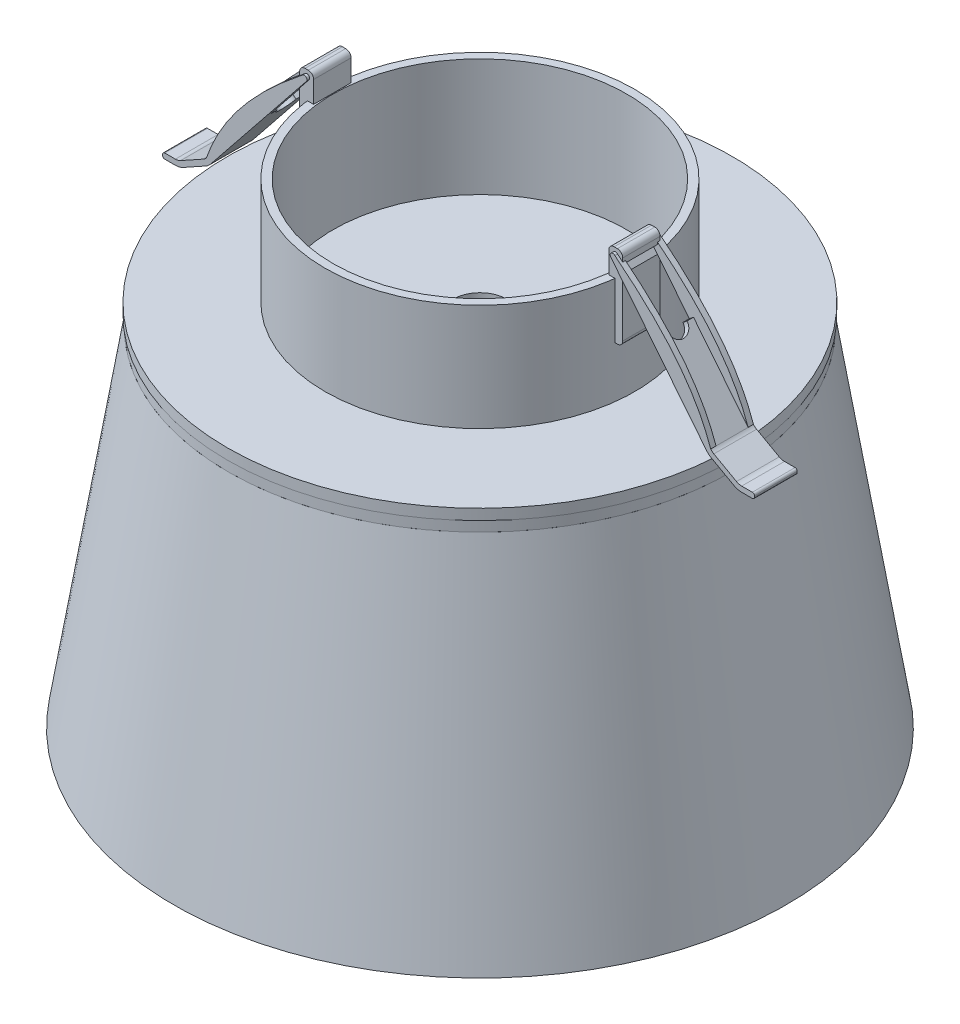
ISO-10303-21;
HEADER;
FILE_DESCRIPTION(('STEP AP214'),'2;1');
FILE_NAME('part.step','',(''),(''),'','','');
FILE_SCHEMA(('AUTOMOTIVE_DESIGN { 1 0 10303 214 1 1 1 1 }'));
ENDSEC;
DATA;
#1=APPLICATION_CONTEXT('core data for automotive mechanical design processes');
#2=APPLICATION_PROTOCOL_DEFINITION('international standard','automotive_design',2000,#1);
#3=PRODUCT_CONTEXT('',#1,'mechanical');
#4=PRODUCT('Part','Part','',(#3));
#5=PRODUCT_RELATED_PRODUCT_CATEGORY('part','',(#4));
#6=PRODUCT_DEFINITION_FORMATION('','',#4);
#7=PRODUCT_DEFINITION_CONTEXT('part definition',#1,'design');
#8=PRODUCT_DEFINITION('design','',#6,#7);
#9=PRODUCT_DEFINITION_SHAPE('','',#8);
#10=(LENGTH_UNIT() NAMED_UNIT(*) SI_UNIT(.MILLI.,.METRE.));
#11=(NAMED_UNIT(*) PLANE_ANGLE_UNIT() SI_UNIT($,.RADIAN.));
#12=(NAMED_UNIT(*) SI_UNIT($,.STERADIAN.) SOLID_ANGLE_UNIT());
#13=UNCERTAINTY_MEASURE_WITH_UNIT(LENGTH_MEASURE(1.E-05),#10,'distance_accuracy_value','');
#14=(GEOMETRIC_REPRESENTATION_CONTEXT(3) GLOBAL_UNCERTAINTY_ASSIGNED_CONTEXT((#13)) GLOBAL_UNIT_ASSIGNED_CONTEXT((#10,
#11,#12)) REPRESENTATION_CONTEXT('',''));
#15=CARTESIAN_POINT('',(0.,0.,0.));
#16=DIRECTION('',(0.,0.,1.));
#17=DIRECTION('',(1.,0.,0.));
#18=AXIS2_PLACEMENT_3D('',#15,#16,#17);
#19=CARTESIAN_POINT('',(-6.62874427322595,6.5241824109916,110.776782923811));
#20=DIRECTION('',(0.,1.,0.));
#21=DIRECTION('',(0.000898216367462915,0.,0.999999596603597));
#22=AXIS2_PLACEMENT_3D('',#19,#20,#21);
#23=PLANE('',#22);
#24=CARTESIAN_POINT('',(-6.62874427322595,6.5241824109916,110.776782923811));
#25=DIRECTION('',(0.,1.,0.));
#26=DIRECTION('',(0.000898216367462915,0.,0.999999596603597));
#27=AXIS2_PLACEMENT_3D('',#24,#25,#26);
#28=CIRCLE('',#27,47.0712088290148);
#29=CARTESIAN_POINT('',(-6.58646414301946,6.5241824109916,157.847972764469));
#30=VERTEX_POINT('',#29);
#31=EDGE_CURVE('P0_E10',#30,#30,#28,.T.);
#32=ORIENTED_EDGE('',*,*,#31,.T.);
#33=EDGE_LOOP('',(#32));
#34=FACE_BOUND('',#33,.T.);
#35=CARTESIAN_POINT('',(-6.62874427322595,6.5241824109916,110.776782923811));
#36=DIRECTION('',(0.,1.,0.));
#37=DIRECTION('',(0.000898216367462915,0.,0.999999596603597));
#38=AXIS2_PLACEMENT_3D('',#35,#36,#37);
#39=CIRCLE('',#38,5.);
#40=CARTESIAN_POINT('',(-6.62425319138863,6.5241824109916,115.776780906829));
#41=VERTEX_POINT('',#40);
#42=EDGE_CURVE('P0_E26',#41,#41,#39,.T.);
#43=ORIENTED_EDGE('',*,*,#42,.F.);
#44=EDGE_LOOP('',(#43));
#45=FACE_BOUND('',#44,.T.);
#46=ADVANCED_FACE('P0_F15',(#34,#45),#23,.T.);
#47=CARTESIAN_POINT('',(-6.62874427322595,4.5241824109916,110.776782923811));
#48=DIRECTION('',(0.,1.,0.));
#49=DIRECTION('',(0.000898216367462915,0.,0.999999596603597));
#50=AXIS2_PLACEMENT_3D('',#47,#48,#49);
#51=PLANE('',#50);
#52=CARTESIAN_POINT('',(-6.62874427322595,4.5241824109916,110.776782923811));
#53=DIRECTION('',(0.,1.,0.));
#54=DIRECTION('',(0.000898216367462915,0.,0.999999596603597));
#55=AXIS2_PLACEMENT_3D('',#52,#53,#54);
#56=CIRCLE('',#55,47.0712088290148);
#57=CARTESIAN_POINT('',(-6.58646414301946,4.5241824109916,157.847972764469));
#58=VERTEX_POINT('',#57);
#59=EDGE_CURVE('P0_E19',#58,#58,#56,.T.);
#60=ORIENTED_EDGE('',*,*,#59,.F.);
#61=EDGE_LOOP('',(#60));
#62=FACE_BOUND('',#61,.T.);
#63=CARTESIAN_POINT('',(-6.62874427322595,4.5241824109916,110.776782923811));
#64=DIRECTION('',(0.,1.,0.));
#65=DIRECTION('',(0.000898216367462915,0.,0.999999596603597));
#66=AXIS2_PLACEMENT_3D('',#63,#64,#65);
#67=CIRCLE('',#66,5.);
#68=CARTESIAN_POINT('',(-6.62425319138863,4.5241824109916,115.776780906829));
#69=VERTEX_POINT('',#68);
#70=EDGE_CURVE('P0_E28',#69,#69,#67,.T.);
#71=ORIENTED_EDGE('',*,*,#70,.T.);
#72=EDGE_LOOP('',(#71));
#73=FACE_BOUND('',#72,.T.);
#74=ADVANCED_FACE('P0_F38',(#62,#73),#51,.F.);
#75=CARTESIAN_POINT('',(-6.62874427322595,6.5241824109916,110.776782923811));
#76=DIRECTION('',(0.,-1.,0.));
#77=DIRECTION('',(-0.000898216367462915,0.,-0.999999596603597));
#78=AXIS2_PLACEMENT_3D('',#75,#76,#77);
#79=CYLINDRICAL_SURFACE('',#78,47.0712088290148);
#80=ORIENTED_EDGE('',*,*,#31,.F.);
#81=EDGE_LOOP('',(#80));
#82=FACE_BOUND('',#81,.T.);
#83=ORIENTED_EDGE('',*,*,#59,.T.);
#84=EDGE_LOOP('',(#83));
#85=FACE_BOUND('',#84,.T.);
#86=ADVANCED_FACE('P0_F17',(#82,#85),#79,.T.);
#87=CARTESIAN_POINT('',(-6.62874427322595,6.5241824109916,110.776782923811));
#88=DIRECTION('',(0.,-1.,0.));
#89=DIRECTION('',(-0.000898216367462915,0.,-0.999999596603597));
#90=AXIS2_PLACEMENT_3D('',#87,#88,#89);
#91=CYLINDRICAL_SURFACE('',#90,5.);
#92=ORIENTED_EDGE('',*,*,#42,.T.);
#93=EDGE_LOOP('',(#92));
#94=FACE_BOUND('',#93,.T.);
#95=ORIENTED_EDGE('',*,*,#70,.F.);
#96=EDGE_LOOP('',(#95));
#97=FACE_BOUND('',#96,.T.);
#98=ADVANCED_FACE('P0_F34',(#94,#97),#91,.F.);
#99=CLOSED_SHELL('',(#46,#74,#86,#98));
#100=MANIFOLD_SOLID_BREP('P0_B1',#99);
#101=CARTESIAN_POINT('',(-6.62874427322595,-12.4758175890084,110.776782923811));
#102=DIRECTION('',(0.,1.,0.));
#103=DIRECTION('',(0.000898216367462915,0.,0.999999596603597));
#104=AXIS2_PLACEMENT_3D('',#101,#102,#103);
#105=CYLINDRICAL_SURFACE('',#104,22.1253058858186);
#106=CARTESIAN_POINT('',(-6.62874427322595,-12.4758175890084,110.776782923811));
#107=DIRECTION('',(0.,-1.,0.));
#108=DIRECTION('',(-0.000898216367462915,0.,-0.999999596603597));
#109=AXIS2_PLACEMENT_3D('',#106,#107,#108);
#110=CIRCLE('',#109,22.1253058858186);
#111=CARTESIAN_POINT('',(-6.60887096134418,-12.4758175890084,132.90207988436));
#112=VERTEX_POINT('',#111);
#113=EDGE_CURVE('P1_E10',#112,#112,#110,.T.);
#114=CARTESIAN_POINT('',(-6.62874427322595,0.5241824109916,110.776782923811));
#115=DIRECTION('',(0.,-1.,0.));
#116=DIRECTION('',(-0.000898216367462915,0.,-0.999999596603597));
#117=AXIS2_PLACEMENT_3D('',#114,#115,#116);
#118=CIRCLE('',#117,22.1253058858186);
#119=CARTESIAN_POINT('',(-6.60887096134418,0.524182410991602,132.90207988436));
#120=VERTEX_POINT('',#119);
#121=EDGE_CURVE('P1_E18',#120,#120,#118,.T.);
#122=CARTESIAN_POINT('',(-6.60887096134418,-12.4758175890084,132.90207988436));
#123=CARTESIAN_POINT('',(-6.60887096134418,-12.3404009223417,132.90207988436));
#124=CARTESIAN_POINT('',(-6.60887096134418,-12.2049842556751,132.90207988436));
#125=CARTESIAN_POINT('',(-6.60887096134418,-11.9341509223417,132.90207988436));
#126=CARTESIAN_POINT('',(-6.60887096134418,-11.7987342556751,132.90207988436));
#127=CARTESIAN_POINT('',(-6.60887096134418,-11.5279009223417,132.90207988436));
#128=CARTESIAN_POINT('',(-6.60887096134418,-11.3924842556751,132.90207988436));
#129=CARTESIAN_POINT('',(-6.60887096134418,-11.1216509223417,132.90207988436));
#130=CARTESIAN_POINT('',(-6.60887096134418,-10.9862342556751,132.90207988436));
#131=CARTESIAN_POINT('',(-6.60887096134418,-10.7154009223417,132.90207988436));
#132=CARTESIAN_POINT('',(-6.60887096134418,-10.5799842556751,132.90207988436));
#133=CARTESIAN_POINT('',(-6.60887096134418,-10.3091509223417,132.90207988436));
#134=CARTESIAN_POINT('',(-6.60887096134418,-10.1737342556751,132.90207988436));
#135=CARTESIAN_POINT('',(-6.60887096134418,-9.90290092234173,132.90207988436));
#136=CARTESIAN_POINT('',(-6.60887096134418,-9.76748425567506,132.90207988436));
#137=CARTESIAN_POINT('',(-6.60887096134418,-9.49665092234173,132.90207988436));
#138=CARTESIAN_POINT('',(-6.60887096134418,-9.36123425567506,132.90207988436));
#139=CARTESIAN_POINT('',(-6.60887096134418,-9.09040092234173,132.90207988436));
#140=CARTESIAN_POINT('',(-6.60887096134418,-8.95498425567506,132.90207988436));
#141=CARTESIAN_POINT('',(-6.60887096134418,-8.68415092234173,132.90207988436));
#142=CARTESIAN_POINT('',(-6.60887096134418,-8.54873425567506,132.90207988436));
#143=CARTESIAN_POINT('',(-6.60887096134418,-8.27790092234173,132.90207988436));
#144=CARTESIAN_POINT('',(-6.60887096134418,-8.14248425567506,132.90207988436));
#145=CARTESIAN_POINT('',(-6.60887096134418,-7.87165092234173,132.90207988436));
#146=CARTESIAN_POINT('',(-6.60887096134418,-7.73623425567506,132.90207988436));
#147=CARTESIAN_POINT('',(-6.60887096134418,-7.46540092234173,132.90207988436));
#148=CARTESIAN_POINT('',(-6.60887096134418,-7.32998425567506,132.90207988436));
#149=CARTESIAN_POINT('',(-6.60887096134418,-7.05915092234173,132.90207988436));
#150=CARTESIAN_POINT('',(-6.60887096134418,-6.92373425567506,132.90207988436));
#151=CARTESIAN_POINT('',(-6.60887096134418,-6.65290092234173,132.90207988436));
#152=CARTESIAN_POINT('',(-6.60887096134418,-6.51748425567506,132.90207988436));
#153=CARTESIAN_POINT('',(-6.60887096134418,-6.24665092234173,132.90207988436));
#154=CARTESIAN_POINT('',(-6.60887096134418,-6.11123425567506,132.90207988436));
#155=CARTESIAN_POINT('',(-6.60887096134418,-5.84040092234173,132.90207988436));
#156=CARTESIAN_POINT('',(-6.60887096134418,-5.70498425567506,132.90207988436));
#157=CARTESIAN_POINT('',(-6.60887096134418,-5.43415092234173,132.90207988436));
#158=CARTESIAN_POINT('',(-6.60887096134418,-5.29873425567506,132.90207988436));
#159=CARTESIAN_POINT('',(-6.60887096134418,-5.02790092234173,132.90207988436));
#160=CARTESIAN_POINT('',(-6.60887096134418,-4.89248425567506,132.90207988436));
#161=CARTESIAN_POINT('',(-6.60887096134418,-4.62165092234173,132.90207988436));
#162=CARTESIAN_POINT('',(-6.60887096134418,-4.48623425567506,132.90207988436));
#163=CARTESIAN_POINT('',(-6.60887096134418,-4.21540092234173,132.90207988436));
#164=CARTESIAN_POINT('',(-6.60887096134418,-4.07998425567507,132.90207988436));
#165=CARTESIAN_POINT('',(-6.60887096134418,-3.80915092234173,132.90207988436));
#166=CARTESIAN_POINT('',(-6.60887096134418,-3.67373425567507,132.90207988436));
#167=CARTESIAN_POINT('',(-6.60887096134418,-3.40290092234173,132.90207988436));
#168=CARTESIAN_POINT('',(-6.60887096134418,-3.26748425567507,132.90207988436));
#169=CARTESIAN_POINT('',(-6.60887096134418,-2.99665092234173,132.90207988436));
#170=CARTESIAN_POINT('',(-6.60887096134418,-2.86123425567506,132.90207988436));
#171=CARTESIAN_POINT('',(-6.60887096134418,-2.59040092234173,132.90207988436));
#172=CARTESIAN_POINT('',(-6.60887096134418,-2.45498425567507,132.90207988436));
#173=CARTESIAN_POINT('',(-6.60887096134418,-2.18415092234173,132.90207988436));
#174=CARTESIAN_POINT('',(-6.60887096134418,-2.04873425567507,132.90207988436));
#175=CARTESIAN_POINT('',(-6.60887096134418,-1.77790092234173,132.90207988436));
#176=CARTESIAN_POINT('',(-6.60887096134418,-1.64248425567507,132.90207988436));
#177=CARTESIAN_POINT('',(-6.60887096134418,-1.37165092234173,132.90207988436));
#178=CARTESIAN_POINT('',(-6.60887096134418,-1.23623425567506,132.90207988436));
#179=CARTESIAN_POINT('',(-6.60887096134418,-0.965400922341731,132.90207988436));
#180=CARTESIAN_POINT('',(-6.60887096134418,-0.829984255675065,132.90207988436));
#181=CARTESIAN_POINT('',(-6.60887096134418,-0.559150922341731,132.90207988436));
#182=CARTESIAN_POINT('',(-6.60887096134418,-0.423734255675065,132.90207988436));
#183=CARTESIAN_POINT('',(-6.60887096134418,-0.152900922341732,132.90207988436));
#184=CARTESIAN_POINT('',(-6.60887096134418,-0.0174842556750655,132.90207988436));
#185=CARTESIAN_POINT('',(-6.60887096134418,0.253349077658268,132.90207988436));
#186=CARTESIAN_POINT('',(-6.60887096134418,0.388765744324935,132.90207988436));
#187=CARTESIAN_POINT('',(-6.60887096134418,0.524182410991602,132.90207988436));
#188=B_SPLINE_CURVE_WITH_KNOTS('',3,(#122,#123,#124,#125,#126,#127,#128,#129,#130,#131,#132,
#133,#134,#135,#136,#137,#138,#139,#140,#141,#142,#143,#144,#145,#146,#147,#148,#149,#150,#151,
#152,#153,#154,#155,#156,#157,#158,#159,#160,#161,#162,#163,#164,#165,#166,#167,#168,#169,#170,
#171,#172,#173,#174,#175,#176,#177,#178,#179,#180,#181,#182,#183,#184,#185,#186,#187),
.UNSPECIFIED.,.F.,.F.,(4,2,2,2,2,2,2,2,2,2,2,2,2,2,2,2,2,2,2,2,2,2,2,2,2,2,2,2,2,2,2,2,4),(0.,
0.40625,0.812500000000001,1.21875,1.625,2.03125,2.4375,2.84375,3.25,3.65625,4.0625,4.46875,
4.875,5.28125,5.6875,6.09375,6.5,6.90625,7.3125,7.71875,8.125,8.53125,8.9375,9.34375,9.75,
10.15625,10.5625,10.96875,11.375,11.78125,12.1875,12.59375,13.),.UNSPECIFIED.);
#189=EDGE_CURVE('P1_BSEAM15',#112,#120,#188,.T.);
#190=ORIENTED_EDGE('',*,*,#113,.F.);
#191=ORIENTED_EDGE('',*,*,#121,.T.);
#192=ORIENTED_EDGE('',*,*,#189,.T.);
#193=ORIENTED_EDGE('',*,*,#189,.F.);
#194=EDGE_LOOP('',(#190,#192,#191,#193));
#195=FACE_BOUND('',#194,.T.);
#196=ADVANCED_FACE('P1_F15',(#195),#105,.T.);
#197=CARTESIAN_POINT('',(-6.62874427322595,-12.4758175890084,110.776782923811));
#198=DIRECTION('',(0.,-1.,0.));
#199=DIRECTION('',(-0.000898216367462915,0.,-0.999999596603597));
#200=AXIS2_PLACEMENT_3D('',#197,#198,#199);
#201=PLANE('',#200);
#202=ORIENTED_EDGE('',*,*,#113,.T.);
#203=EDGE_LOOP('',(#202));
#204=FACE_BOUND('',#203,.T.);
#205=ADVANCED_FACE('P1_F30',(#204),#201,.T.);
#206=CARTESIAN_POINT('',(-6.62874427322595,0.5241824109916,110.776782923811));
#207=DIRECTION('',(0.,-1.,0.));
#208=DIRECTION('',(-0.000898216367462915,0.,-0.999999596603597));
#209=AXIS2_PLACEMENT_3D('',#206,#207,#208);
#210=PLANE('',#209);
#211=ORIENTED_EDGE('',*,*,#121,.F.);
#212=EDGE_LOOP('',(#211));
#213=FACE_BOUND('',#212,.T.);
#214=ADVANCED_FACE('P1_F28',(#213),#210,.F.);
#215=CLOSED_SHELL('',(#196,#205,#214));
#216=MANIFOLD_SOLID_BREP('P1_B1',#215);
#217=CARTESIAN_POINT('',(-6.62874427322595,-19.4758175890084,110.776782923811));
#218=DIRECTION('',(0.,1.,0.));
#219=DIRECTION('',(0.000898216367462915,0.,0.999999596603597));
#220=AXIS2_PLACEMENT_3D('',#217,#218,#219);
#221=CYLINDRICAL_SURFACE('',#220,22.1253058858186);
#222=CARTESIAN_POINT('',(-6.62874427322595,-13.4758175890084,110.776782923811));
#223=DIRECTION('',(0.,-1.,0.));
#224=DIRECTION('',(-0.000898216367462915,0.,-0.999999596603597));
#225=AXIS2_PLACEMENT_3D('',#222,#223,#224);
#226=CIRCLE('',#225,22.1253058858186);
#227=CARTESIAN_POINT('',(-6.64861758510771,-13.4758175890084,88.6514859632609));
#228=VERTEX_POINT('',#227);
#229=EDGE_CURVE('P2_E10',#228,#228,#226,.F.);
#230=ORIENTED_EDGE('',*,*,#229,.T.);
#231=EDGE_LOOP('',(#230));
#232=FACE_BOUND('',#231,.T.);
#233=CARTESIAN_POINT('',(-6.62874427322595,-12.4758175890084,110.776782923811));
#234=DIRECTION('',(0.,-1.,0.));
#235=DIRECTION('',(-0.000898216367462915,0.,-0.999999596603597));
#236=AXIS2_PLACEMENT_3D('',#233,#234,#235);
#237=CIRCLE('',#236,22.1253058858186);
#238=CARTESIAN_POINT('',(-6.64861758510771,-12.4758175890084,88.6514859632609));
#239=VERTEX_POINT('',#238);
#240=EDGE_CURVE('P2_E26',#239,#239,#237,.T.);
#241=ORIENTED_EDGE('',*,*,#240,.T.);
#242=EDGE_LOOP('',(#241));
#243=FACE_BOUND('',#242,.T.);
#244=ADVANCED_FACE('P2_F15',(#232,#243),#221,.T.);
#245=CARTESIAN_POINT('',(-6.62874427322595,-19.4758175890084,110.776782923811));
#246=DIRECTION('',(0.,-1.,0.));
#247=DIRECTION('',(-0.000898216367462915,0.,-0.999999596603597));
#248=AXIS2_PLACEMENT_3D('',#245,#246,#247);
#249=PLANE('',#248);
#250=CARTESIAN_POINT('',(-6.62874427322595,-19.4758175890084,110.776782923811));
#251=DIRECTION('',(0.,-1.,0.));
#252=DIRECTION('',(-0.000898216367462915,0.,-0.999999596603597));
#253=AXIS2_PLACEMENT_3D('',#250,#251,#252);
#254=CIRCLE('',#253,16.1253058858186);
#255=CARTESIAN_POINT('',(-6.64322828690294,-19.4758175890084,94.6514835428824));
#256=VERTEX_POINT('',#255);
#257=EDGE_CURVE('P2_E22',#256,#256,#254,.T.);
#258=ORIENTED_EDGE('',*,*,#257,.T.);
#259=EDGE_LOOP('',(#258));
#260=FACE_BOUND('',#259,.T.);
#261=ADVANCED_FACE('P2_F36',(#260),#249,.T.);
#262=CARTESIAN_POINT('',(-6.62874427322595,-12.4758175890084,110.776782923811));
#263=DIRECTION('',(0.,-1.,0.));
#264=DIRECTION('',(-0.000898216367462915,0.,-0.999999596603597));
#265=AXIS2_PLACEMENT_3D('',#262,#263,#264);
#266=PLANE('',#265);
#267=ORIENTED_EDGE('',*,*,#240,.F.);
#268=EDGE_LOOP('',(#267));
#269=FACE_BOUND('',#268,.T.);
#270=ADVANCED_FACE('P2_F34',(#269),#266,.F.);
#271=CARTESIAN_POINT('',(-6.62874427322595,-13.4758175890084,110.776782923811));
#272=DIRECTION('',(0.,-1.,0.));
#273=DIRECTION('',(-0.000898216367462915,0.,-0.999999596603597));
#274=AXIS2_PLACEMENT_3D('',#271,#272,#273);
#275=TOROIDAL_SURFACE('',#274,16.1253058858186,6.);
#276=ORIENTED_EDGE('',*,*,#229,.F.);
#277=EDGE_LOOP('',(#276));
#278=FACE_BOUND('',#277,.T.);
#279=ORIENTED_EDGE('',*,*,#257,.F.);
#280=EDGE_LOOP('',(#279));
#281=FACE_BOUND('',#280,.T.);
#282=ADVANCED_FACE('P2_F17',(#278,#281),#275,.T.);
#283=CLOSED_SHELL('',(#244,#261,#270,#282));
#284=MANIFOLD_SOLID_BREP('P2_B1',#283);
#285=CARTESIAN_POINT('',(-6.62874427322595,4.5241824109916,110.776782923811));
#286=DIRECTION('',(0.,-1.,0.));
#287=DIRECTION('',(-0.000898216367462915,0.,-0.999999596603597));
#288=AXIS2_PLACEMENT_3D('',#285,#286,#287);
#289=CONICAL_SURFACE('',#288,47.0685615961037,0.15707963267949);
#290=CARTESIAN_POINT('',(-6.62874427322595,-60.4758175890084,110.776782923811));
#291=DIRECTION('',(0.,-1.,0.));
#292=DIRECTION('',(-0.000898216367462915,0.,-0.999999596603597));
#293=AXIS2_PLACEMENT_3D('',#290,#291,#292);
#294=CIRCLE('',#293,57.3635502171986);
#295=CARTESIAN_POINT('',(-6.68026915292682,-60.4758175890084,53.4132558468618));
#296=VERTEX_POINT('',#295);
#297=EDGE_CURVE('P3_E9',#296,#296,#294,.T.);
#298=ORIENTED_EDGE('',*,*,#297,.F.);
#299=EDGE_LOOP('',(#298));
#300=FACE_BOUND('',#299,.T.);
#301=CARTESIAN_POINT('',(-6.62874427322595,4.5241824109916,110.776782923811));
#302=DIRECTION('',(0.,-1.,0.));
#303=DIRECTION('',(-0.000898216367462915,0.,-0.999999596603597));
#304=AXIS2_PLACEMENT_3D('',#301,#302,#303);
#305=CIRCLE('',#304,47.0685615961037);
#306=CARTESIAN_POINT('',(-6.6710220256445,4.5241824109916,63.7082403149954));
#307=VERTEX_POINT('',#306);
#308=EDGE_CURVE('P3_E20',#307,#307,#305,.T.);
#309=ORIENTED_EDGE('',*,*,#308,.T.);
#310=EDGE_LOOP('',(#309));
#311=FACE_BOUND('',#310,.T.);
#312=ADVANCED_FACE('P3_F14',(#300,#311),#289,.T.);
#313=CARTESIAN_POINT('',(-6.62874427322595,-60.4758175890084,110.776782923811));
#314=DIRECTION('',(0.,-1.,0.));
#315=DIRECTION('',(-0.000898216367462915,0.,-0.999999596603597));
#316=AXIS2_PLACEMENT_3D('',#313,#314,#315);
#317=PLANE('',#316);
#318=CARTESIAN_POINT('',(-6.62874427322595,-60.4758175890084,110.776782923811));
#319=DIRECTION('',(0.,-1.,0.));
#320=DIRECTION('',(-0.000898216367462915,0.,-0.999999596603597));
#321=AXIS2_PLACEMENT_3D('',#318,#319,#320);
#322=CIRCLE('',#321,55.3386199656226);
#323=CARTESIAN_POINT('',(-6.67845032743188,-60.4758175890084,55.4381852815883));
#324=VERTEX_POINT('',#323);
#325=EDGE_CURVE('P3_E24',#324,#324,#322,.T.);
#326=ORIENTED_EDGE('',*,*,#325,.F.);
#327=EDGE_LOOP('',(#326));
#328=FACE_BOUND('',#327,.T.);
#329=ORIENTED_EDGE('',*,*,#297,.T.);
#330=EDGE_LOOP('',(#329));
#331=FACE_BOUND('',#330,.T.);
#332=ADVANCED_FACE('P3_F47',(#328,#331),#317,.T.);
#333=CARTESIAN_POINT('',(-6.62874427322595,4.5241824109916,110.776782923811));
#334=DIRECTION('',(0.,-1.,0.));
#335=DIRECTION('',(-0.000898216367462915,0.,-0.999999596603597));
#336=AXIS2_PLACEMENT_3D('',#333,#334,#335);
#337=PLANE('',#336);
#338=ORIENTED_EDGE('',*,*,#308,.F.);
#339=EDGE_LOOP('',(#338));
#340=FACE_BOUND('',#339,.T.);
#341=ADVANCED_FACE('P3_F38',(#340),#337,.F.);
#342=CARTESIAN_POINT('',(-6.62874427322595,4.21131348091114,110.776782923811));
#343=DIRECTION('',(0.,-1.,0.));
#344=DIRECTION('',(-0.000898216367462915,0.,-0.999999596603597));
#345=AXIS2_PLACEMENT_3D('',#342,#343,#344);
#346=CONICAL_SURFACE('',#345,45.0931849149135,0.15707963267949);
#347=ORIENTED_EDGE('',*,*,#325,.T.);
#348=EDGE_LOOP('',(#347));
#349=FACE_BOUND('',#348,.T.);
#350=CARTESIAN_POINT('',(-6.62874427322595,2.5241824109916,110.776782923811));
#351=DIRECTION('',(0.,-1.,0.));
#352=DIRECTION('',(-0.000898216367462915,0.,-0.999999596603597));
#353=AXIS2_PLACEMENT_3D('',#350,#351,#352);
#354=CIRCLE('',#353,45.3604002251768);
#355=CARTESIAN_POINT('',(-6.66948772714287,2.5241824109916,65.4164009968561));
#356=VERTEX_POINT('',#355);
#357=EDGE_CURVE('P3_E28',#356,#356,#354,.T.);
#358=ORIENTED_EDGE('',*,*,#357,.F.);
#359=EDGE_LOOP('',(#358));
#360=FACE_BOUND('',#359,.T.);
#361=ADVANCED_FACE('P3_F36',(#349,#360),#346,.F.);
#362=CARTESIAN_POINT('',(-6.62874427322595,2.5241824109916,110.776782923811));
#363=DIRECTION('',(0.,-1.,0.));
#364=DIRECTION('',(-0.000898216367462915,0.,-0.999999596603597));
#365=AXIS2_PLACEMENT_3D('',#362,#363,#364);
#366=PLANE('',#365);
#367=ORIENTED_EDGE('',*,*,#357,.T.);
#368=EDGE_LOOP('',(#367));
#369=FACE_BOUND('',#368,.T.);
#370=ADVANCED_FACE('P3_F34',(#369),#366,.T.);
#371=CLOSED_SHELL('',(#312,#332,#341,#361,#370));
#372=MANIFOLD_SOLID_BREP('P3_B1',#371);
#373=CARTESIAN_POINT('',(-6.62874427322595,8.5241824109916,110.776782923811));
#374=DIRECTION('',(0.,-1.,0.));
#375=DIRECTION('',(0.,0.,-1.));
#376=AXIS2_PLACEMENT_3D('',#373,#374,#375);
#377=CYLINDRICAL_SURFACE('',#376,47.25);
#378=CARTESIAN_POINT('',(-6.62874427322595,8.5241824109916,110.776782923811));
#379=DIRECTION('',(0.,1.,0.));
#380=DIRECTION('',(0.,0.,1.));
#381=AXIS2_PLACEMENT_3D('',#378,#379,#380);
#382=CIRCLE('',#381,47.25);
#383=CARTESIAN_POINT('',(-6.62874427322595,8.5241824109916,158.026782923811));
#384=VERTEX_POINT('',#383);
#385=EDGE_CURVE('P4_E22',#384,#384,#382,.T.);
#386=ORIENTED_EDGE('',*,*,#385,.F.);
#387=EDGE_LOOP('',(#386));
#388=FACE_BOUND('',#387,.T.);
#389=CARTESIAN_POINT('',(-6.62874427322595,6.5241824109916,110.776782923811));
#390=DIRECTION('',(0.,1.,0.));
#391=DIRECTION('',(0.,0.,1.));
#392=AXIS2_PLACEMENT_3D('',#389,#390,#391);
#393=CIRCLE('',#392,47.25);
#394=CARTESIAN_POINT('',(-6.62874427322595,6.5241824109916,158.026782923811));
#395=VERTEX_POINT('',#394);
#396=EDGE_CURVE('P4_E27',#395,#395,#393,.T.);
#397=ORIENTED_EDGE('',*,*,#396,.T.);
#398=EDGE_LOOP('',(#397));
#399=FACE_BOUND('',#398,.T.);
#400=ADVANCED_FACE('P4_F15',(#388,#399),#377,.T.);
#401=CARTESIAN_POINT('',(-6.62874427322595,8.5241824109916,110.776782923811));
#402=DIRECTION('',(0.,1.,0.));
#403=DIRECTION('',(0.,0.,1.));
#404=AXIS2_PLACEMENT_3D('',#401,#402,#403);
#405=PLANE('',#404);
#406=CARTESIAN_POINT('',(-6.62874427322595,8.5241824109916,110.776782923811));
#407=DIRECTION('',(0.,1.,0.));
#408=DIRECTION('',(0.,0.,1.));
#409=AXIS2_PLACEMENT_3D('',#406,#407,#408);
#410=CIRCLE('',#409,29.);
#411=CARTESIAN_POINT('',(-6.62874427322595,8.5241824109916,139.776782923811));
#412=VERTEX_POINT('',#411);
#413=EDGE_CURVE('P4_E10',#412,#412,#410,.T.);
#414=ORIENTED_EDGE('',*,*,#413,.F.);
#415=EDGE_LOOP('',(#414));
#416=FACE_BOUND('',#415,.T.);
#417=ORIENTED_EDGE('',*,*,#385,.T.);
#418=EDGE_LOOP('',(#417));
#419=FACE_BOUND('',#418,.T.);
#420=ADVANCED_FACE('P4_F57',(#416,#419),#405,.T.);
#421=CARTESIAN_POINT('',(-6.62874427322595,6.5241824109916,110.776782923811));
#422=DIRECTION('',(0.,1.,0.));
#423=DIRECTION('',(0.,0.,1.));
#424=AXIS2_PLACEMENT_3D('',#421,#422,#423);
#425=PLANE('',#424);
#426=CARTESIAN_POINT('',(-6.62874427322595,6.5241824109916,110.776782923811));
#427=DIRECTION('',(0.,1.,0.));
#428=DIRECTION('',(0.,0.,1.));
#429=AXIS2_PLACEMENT_3D('',#426,#427,#428);
#430=CIRCLE('',#429,27.5);
#431=CARTESIAN_POINT('',(-6.62874427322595,6.5241824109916,138.276782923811));
#432=VERTEX_POINT('',#431);
#433=EDGE_CURVE('P4_E36',#432,#432,#430,.F.);
#434=ORIENTED_EDGE('',*,*,#433,.F.);
#435=EDGE_LOOP('',(#434));
#436=FACE_BOUND('',#435,.T.);
#437=ORIENTED_EDGE('',*,*,#396,.F.);
#438=EDGE_LOOP('',(#437));
#439=FACE_BOUND('',#438,.T.);
#440=ADVANCED_FACE('P4_F62',(#436,#439),#425,.F.);
#441=CARTESIAN_POINT('',(-6.62874427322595,28.5241824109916,110.776782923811));
#442=DIRECTION('',(0.,-1.,0.));
#443=DIRECTION('',(0.,0.,-1.));
#444=AXIS2_PLACEMENT_3D('',#441,#442,#443);
#445=CYLINDRICAL_SURFACE('',#444,29.);
#446=CARTESIAN_POINT('',(-6.62874427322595,28.5241824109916,110.776782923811));
#447=DIRECTION('',(0.,1.,0.));
#448=DIRECTION('',(0.,0.,1.));
#449=AXIS2_PLACEMENT_3D('',#446,#447,#448);
#450=CIRCLE('',#449,29.);
#451=CARTESIAN_POINT('',(-6.62874427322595,28.5241824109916,139.776782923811));
#452=VERTEX_POINT('',#451);
#453=EDGE_CURVE('P4_E30',#452,#452,#450,.T.);
#454=ORIENTED_EDGE('',*,*,#453,.F.);
#455=EDGE_LOOP('',(#454));
#456=FACE_BOUND('',#455,.T.);
#457=ORIENTED_EDGE('',*,*,#413,.T.);
#458=EDGE_LOOP('',(#457));
#459=FACE_BOUND('',#458,.T.);
#460=ADVANCED_FACE('P4_F54',(#456,#459),#445,.T.);
#461=CARTESIAN_POINT('',(-6.62874427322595,28.5241824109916,110.776782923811));
#462=DIRECTION('',(0.,1.,0.));
#463=DIRECTION('',(0.,0.,1.));
#464=AXIS2_PLACEMENT_3D('',#461,#462,#463);
#465=PLANE('',#464);
#466=CARTESIAN_POINT('',(-6.62874427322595,28.5241824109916,110.776782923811));
#467=DIRECTION('',(0.,1.,0.));
#468=DIRECTION('',(0.,0.,1.));
#469=AXIS2_PLACEMENT_3D('',#466,#467,#468);
#470=CIRCLE('',#469,27.5);
#471=CARTESIAN_POINT('',(-6.62874427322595,28.5241824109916,138.276782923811));
#472=VERTEX_POINT('',#471);
#473=EDGE_CURVE('P4_E18',#472,#472,#470,.F.);
#474=ORIENTED_EDGE('',*,*,#473,.T.);
#475=EDGE_LOOP('',(#474));
#476=FACE_BOUND('',#475,.T.);
#477=ORIENTED_EDGE('',*,*,#453,.T.);
#478=EDGE_LOOP('',(#477));
#479=FACE_BOUND('',#478,.T.);
#480=ADVANCED_FACE('P4_F45',(#476,#479),#465,.T.);
#481=CARTESIAN_POINT('',(-6.62874427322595,43.5241824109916,110.776782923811));
#482=DIRECTION('',(0.,-1.,0.));
#483=DIRECTION('',(0.,0.,-1.));
#484=AXIS2_PLACEMENT_3D('',#481,#482,#483);
#485=CYLINDRICAL_SURFACE('',#484,27.5);
#486=ORIENTED_EDGE('',*,*,#473,.F.);
#487=EDGE_LOOP('',(#486));
#488=FACE_BOUND('',#487,.T.);
#489=ORIENTED_EDGE('',*,*,#433,.T.);
#490=EDGE_LOOP('',(#489));
#491=FACE_BOUND('',#490,.T.);
#492=ADVANCED_FACE('P4_F47',(#488,#491),#485,.F.);
#493=CLOSED_SHELL('',(#400,#420,#440,#460,#480,#492));
#494=MANIFOLD_SOLID_BREP('P4_B1',#493);
#495=CARTESIAN_POINT('',(-36.8604437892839,19.0957145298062,114.276782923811));
#496=DIRECTION('',(1.,0.,0.));
#497=DIRECTION('',(0.,0.,-1.));
#498=AXIS2_PLACEMENT_3D('',#495,#496,#497);
#499=PLANE('',#498);
#500=DIRECTION('',(0.,-1.,0.));
#501=VECTOR('',#500,1.);
#502=CARTESIAN_POINT('',(-36.8604437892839,19.0957145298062,107.276782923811));
#503=LINE('',#502,#501);
#504=CARTESIAN_POINT('',(-36.8604437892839,32.5632013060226,107.276782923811));
#505=VERTEX_POINT('',#504);
#506=CARTESIAN_POINT('',(-36.8604437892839,19.0957145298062,107.276782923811));
#507=VERTEX_POINT('',#506);
#508=EDGE_CURVE('P5_E108',#505,#507,#503,.T.);
#509=ORIENTED_EDGE('',*,*,#508,.T.);
#510=DIRECTION('',(0.,0.,-1.));
#511=VECTOR('',#510,1.);
#512=CARTESIAN_POINT('',(-36.8604437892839,19.0957145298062,114.276782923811));
#513=LINE('',#512,#511);
#514=CARTESIAN_POINT('',(-36.8604437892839,19.0957145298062,114.276782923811));
#515=VERTEX_POINT('',#514);
#516=EDGE_CURVE('P5_E105',#515,#507,#513,.T.);
#517=ORIENTED_EDGE('',*,*,#516,.F.);
#518=DIRECTION('',(0.,-1.,0.));
#519=VECTOR('',#518,1.);
#520=CARTESIAN_POINT('',(-36.8604437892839,19.0957145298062,114.276782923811));
#521=LINE('',#520,#519);
#522=CARTESIAN_POINT('',(-36.8604437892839,32.5632013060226,114.276782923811));
#523=VERTEX_POINT('',#522);
#524=EDGE_CURVE('P5_E92',#523,#515,#521,.T.);
#525=ORIENTED_EDGE('',*,*,#524,.F.);
#526=DIRECTION('',(0.,0.,-1.));
#527=VECTOR('',#526,1.);
#528=CARTESIAN_POINT('',(-36.8604437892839,32.5632013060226,114.276782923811));
#529=LINE('',#528,#527);
#530=EDGE_CURVE('P5_E111',#523,#505,#529,.T.);
#531=ORIENTED_EDGE('',*,*,#530,.T.);
#532=EDGE_LOOP('',(#509,#517,#525,#531));
#533=FACE_BOUND('',#532,.T.);
#534=DIRECTION('',(0.,0.,1.));
#535=VECTOR('',#534,1.);
#536=CARTESIAN_POINT('',(-36.8604437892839,29.8920916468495,114.276782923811));
#537=LINE('',#536,#535);
#538=CARTESIAN_POINT('',(-36.8604437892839,29.8920916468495,107.776782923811));
#539=VERTEX_POINT('',#538);
#540=CARTESIAN_POINT('',(-36.8604437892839,29.8920916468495,113.761981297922));
#541=VERTEX_POINT('',#540);
#542=EDGE_CURVE('P5_E11',#539,#541,#537,.T.);
#543=ORIENTED_EDGE('',*,*,#542,.F.);
#544=DIRECTION('',(0.,1.,0.));
#545=VECTOR('',#544,1.);
#546=CARTESIAN_POINT('',(-36.8604437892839,19.0957145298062,107.776782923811));
#547=LINE('',#546,#545);
#548=CARTESIAN_POINT('',(-36.8604437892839,31.4912492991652,107.776782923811));
#549=VERTEX_POINT('',#548);
#550=EDGE_CURVE('P5_E25',#539,#549,#547,.T.);
#551=ORIENTED_EDGE('',*,*,#550,.T.);
#552=DIRECTION('',(0.,0.,1.));
#553=VECTOR('',#552,1.);
#554=CARTESIAN_POINT('',(-36.8604437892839,31.4912492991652,114.276782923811));
#555=LINE('',#554,#553);
#556=CARTESIAN_POINT('',(-36.8604437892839,31.4912492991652,113.761981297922));
#557=VERTEX_POINT('',#556);
#558=EDGE_CURVE('P5_E146',#549,#557,#555,.T.);
#559=ORIENTED_EDGE('',*,*,#558,.T.);
#560=DIRECTION('',(0.,-1.,0.));
#561=VECTOR('',#560,1.);
#562=CARTESIAN_POINT('',(-36.8604437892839,19.0957145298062,113.761981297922));
#563=LINE('',#562,#561);
#564=EDGE_CURVE('P5_E149',#557,#541,#563,.T.);
#565=ORIENTED_EDGE('',*,*,#564,.T.);
#566=EDGE_LOOP('',(#543,#551,#559,#565));
#567=FACE_BOUND('',#566,.T.);
#568=ADVANCED_FACE('P5_F17',(#533,#567),#499,.F.);
#569=CARTESIAN_POINT('',(-34.251196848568,18.0957145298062,114.276782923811));
#570=DIRECTION('',(-1.,0.,0.));
#571=DIRECTION('',(0.,0.,1.));
#572=AXIS2_PLACEMENT_3D('',#569,#570,#571);
#573=PLANE('',#572);
#574=DIRECTION('',(0.,1.,0.));
#575=VECTOR('',#574,1.);
#576=CARTESIAN_POINT('',(-34.251196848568,18.0957145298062,107.276782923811));
#577=LINE('',#576,#575);
#578=CARTESIAN_POINT('',(-34.251196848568,18.0957145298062,107.276782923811));
#579=VERTEX_POINT('',#578);
#580=CARTESIAN_POINT('',(-34.251196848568,32.5632013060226,107.276782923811));
#581=VERTEX_POINT('',#580);
#582=EDGE_CURVE('P5_E120',#579,#581,#577,.T.);
#583=ORIENTED_EDGE('',*,*,#582,.T.);
#584=DIRECTION('',(0.,0.,-1.));
#585=VECTOR('',#584,1.);
#586=CARTESIAN_POINT('',(-34.251196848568,32.5632013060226,114.276782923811));
#587=LINE('',#586,#585);
#588=CARTESIAN_POINT('',(-34.251196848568,32.5632013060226,114.276782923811));
#589=VERTEX_POINT('',#588);
#590=EDGE_CURVE('P5_E144',#589,#581,#587,.T.);
#591=ORIENTED_EDGE('',*,*,#590,.F.);
#592=DIRECTION('',(0.,1.,0.));
#593=VECTOR('',#592,1.);
#594=CARTESIAN_POINT('',(-34.251196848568,18.0957145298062,114.276782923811));
#595=LINE('',#594,#593);
#596=CARTESIAN_POINT('',(-34.251196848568,18.0957145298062,114.276782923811));
#597=VERTEX_POINT('',#596);
#598=EDGE_CURVE('P5_E134',#597,#589,#595,.T.);
#599=ORIENTED_EDGE('',*,*,#598,.F.);
#600=DIRECTION('',(0.,0.,-1.));
#601=VECTOR('',#600,1.);
#602=CARTESIAN_POINT('',(-34.251196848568,18.0957145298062,114.276782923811));
#603=LINE('',#602,#601);
#604=EDGE_CURVE('P5_E116',#597,#579,#603,.T.);
#605=ORIENTED_EDGE('',*,*,#604,.T.);
#606=EDGE_LOOP('',(#583,#591,#599,#605));
#607=FACE_BOUND('',#606,.T.);
#608=ADVANCED_FACE('P5_F19',(#607),#573,.F.);
#609=CARTESIAN_POINT('',(-35.251196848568,32.5632013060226,114.276782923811));
#610=DIRECTION('',(0.,0.,-1.));
#611=DIRECTION('',(-1.,0.,0.));
#612=AXIS2_PLACEMENT_3D('',#609,#610,#611);
#613=CYLINDRICAL_SURFACE('',#612,1.);
#614=CARTESIAN_POINT('',(-35.251196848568,32.5632013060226,107.276782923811));
#615=DIRECTION('',(0.,0.,1.));
#616=DIRECTION('',(-1.,0.,0.));
#617=AXIS2_PLACEMENT_3D('',#614,#615,#616);
#618=CIRCLE('',#617,1.);
#619=CARTESIAN_POINT('',(-35.251196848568,33.5632013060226,107.276782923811));
#620=VERTEX_POINT('',#619);
#621=EDGE_CURVE('P5_E123',#581,#620,#618,.T.);
#622=ORIENTED_EDGE('',*,*,#621,.T.);
#623=DIRECTION('',(0.,0.,-1.));
#624=VECTOR('',#623,1.);
#625=CARTESIAN_POINT('',(-35.251196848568,33.5632013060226,114.276782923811));
#626=LINE('',#625,#624);
#627=CARTESIAN_POINT('',(-35.251196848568,33.5632013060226,114.276782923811));
#628=VERTEX_POINT('',#627);
#629=EDGE_CURVE('P5_E141',#628,#620,#626,.T.);
#630=ORIENTED_EDGE('',*,*,#629,.F.);
#631=CARTESIAN_POINT('',(-35.251196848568,32.5632013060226,114.276782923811));
#632=DIRECTION('',(0.,0.,1.));
#633=DIRECTION('',(-1.,0.,0.));
#634=AXIS2_PLACEMENT_3D('',#631,#632,#633);
#635=CIRCLE('',#634,1.);
#636=EDGE_CURVE('P5_E80',#589,#628,#635,.T.);
#637=ORIENTED_EDGE('',*,*,#636,.F.);
#638=ORIENTED_EDGE('',*,*,#590,.T.);
#639=EDGE_LOOP('',(#622,#630,#637,#638));
#640=FACE_BOUND('',#639,.T.);
#641=ADVANCED_FACE('P5_F206',(#640),#613,.T.);
#642=CARTESIAN_POINT('',(-35.8604437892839,33.5632013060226,114.276782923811));
#643=DIRECTION('',(0.,-1.,0.));
#644=DIRECTION('',(0.,0.,-1.));
#645=AXIS2_PLACEMENT_3D('',#642,#643,#644);
#646=PLANE('',#645);
#647=DIRECTION('',(-1.,0.,0.));
#648=VECTOR('',#647,1.);
#649=CARTESIAN_POINT('',(-35.8604437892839,33.5632013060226,107.276782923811));
#650=LINE('',#649,#648);
#651=CARTESIAN_POINT('',(-35.8604437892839,33.5632013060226,107.276782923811));
#652=VERTEX_POINT('',#651);
#653=EDGE_CURVE('P5_E126',#620,#652,#650,.T.);
#654=ORIENTED_EDGE('',*,*,#653,.T.);
#655=DIRECTION('',(0.,0.,-1.));
#656=VECTOR('',#655,1.);
#657=CARTESIAN_POINT('',(-35.8604437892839,33.5632013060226,114.276782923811));
#658=LINE('',#657,#656);
#659=CARTESIAN_POINT('',(-35.8604437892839,33.5632013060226,114.276782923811));
#660=VERTEX_POINT('',#659);
#661=EDGE_CURVE('P5_E138',#660,#652,#658,.T.);
#662=ORIENTED_EDGE('',*,*,#661,.F.);
#663=DIRECTION('',(-1.,0.,0.));
#664=VECTOR('',#663,1.);
#665=CARTESIAN_POINT('',(-35.8604437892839,33.5632013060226,114.276782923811));
#666=LINE('',#665,#664);
#667=EDGE_CURVE('P5_E190',#628,#660,#666,.T.);
#668=ORIENTED_EDGE('',*,*,#667,.F.);
#669=ORIENTED_EDGE('',*,*,#629,.T.);
#670=EDGE_LOOP('',(#654,#662,#668,#669));
#671=FACE_BOUND('',#670,.T.);
#672=ADVANCED_FACE('P5_F194',(#671),#646,.F.);
#673=CARTESIAN_POINT('',(-35.8604437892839,32.5632013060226,114.276782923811));
#674=DIRECTION('',(0.,0.,-1.));
#675=DIRECTION('',(-1.,0.,0.));
#676=AXIS2_PLACEMENT_3D('',#673,#674,#675);
#677=CYLINDRICAL_SURFACE('',#676,1.);
#678=CARTESIAN_POINT('',(-35.8604437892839,32.5632013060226,107.276782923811));
#679=DIRECTION('',(0.,0.,1.));
#680=DIRECTION('',(-1.,0.,0.));
#681=AXIS2_PLACEMENT_3D('',#678,#679,#680);
#682=CIRCLE('',#681,1.);
#683=EDGE_CURVE('P5_E128',#652,#505,#682,.T.);
#684=ORIENTED_EDGE('',*,*,#683,.T.);
#685=ORIENTED_EDGE('',*,*,#530,.F.);
#686=CARTESIAN_POINT('',(-35.8604437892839,32.5632013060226,114.276782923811));
#687=DIRECTION('',(0.,0.,1.));
#688=DIRECTION('',(-1.,0.,0.));
#689=AXIS2_PLACEMENT_3D('',#686,#687,#688);
#690=CIRCLE('',#689,1.);
#691=EDGE_CURVE('P5_E99',#660,#523,#690,.T.);
#692=ORIENTED_EDGE('',*,*,#691,.F.);
#693=ORIENTED_EDGE('',*,*,#661,.T.);
#694=EDGE_LOOP('',(#684,#685,#692,#693));
#695=FACE_BOUND('',#694,.T.);
#696=ADVANCED_FACE('P5_F198',(#695),#677,.T.);
#697=CARTESIAN_POINT('',(-35.8604437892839,19.0957145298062,114.276782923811));
#698=DIRECTION('',(0.,0.,-1.));
#699=DIRECTION('',(-1.,0.,0.));
#700=AXIS2_PLACEMENT_3D('',#697,#698,#699);
#701=CYLINDRICAL_SURFACE('',#700,1.);
#702=CARTESIAN_POINT('',(-35.8604437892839,19.0957145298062,107.276782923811));
#703=DIRECTION('',(0.,0.,1.));
#704=DIRECTION('',(-1.,0.,0.));
#705=AXIS2_PLACEMENT_3D('',#702,#703,#704);
#706=CIRCLE('',#705,1.);
#707=CARTESIAN_POINT('',(-35.8604437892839,18.0957145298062,107.276782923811));
#708=VERTEX_POINT('',#707);
#709=EDGE_CURVE('P5_E131',#507,#708,#706,.T.);
#710=ORIENTED_EDGE('',*,*,#709,.T.);
#711=DIRECTION('',(0.,0.,-1.));
#712=VECTOR('',#711,1.);
#713=CARTESIAN_POINT('',(-35.8604437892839,18.0957145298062,114.276782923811));
#714=LINE('',#713,#712);
#715=CARTESIAN_POINT('',(-35.8604437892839,18.0957145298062,114.276782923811));
#716=VERTEX_POINT('',#715);
#717=EDGE_CURVE('P5_E112',#716,#708,#714,.T.);
#718=ORIENTED_EDGE('',*,*,#717,.F.);
#719=CARTESIAN_POINT('',(-35.8604437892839,19.0957145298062,114.276782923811));
#720=DIRECTION('',(0.,0.,1.));
#721=DIRECTION('',(-1.,0.,0.));
#722=AXIS2_PLACEMENT_3D('',#719,#720,#721);
#723=CIRCLE('',#722,1.);
#724=EDGE_CURVE('P5_E96',#515,#716,#723,.T.);
#725=ORIENTED_EDGE('',*,*,#724,.F.);
#726=ORIENTED_EDGE('',*,*,#516,.T.);
#727=EDGE_LOOP('',(#710,#718,#725,#726));
#728=FACE_BOUND('',#727,.T.);
#729=ADVANCED_FACE('P5_F114',(#728),#701,.T.);
#730=CARTESIAN_POINT('',(-35.8604437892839,18.0957145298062,114.276782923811));
#731=DIRECTION('',(0.,1.,0.));
#732=DIRECTION('',(0.,0.,1.));
#733=AXIS2_PLACEMENT_3D('',#730,#731,#732);
#734=PLANE('',#733);
#735=DIRECTION('',(1.,0.,0.));
#736=VECTOR('',#735,1.);
#737=CARTESIAN_POINT('',(-35.8604437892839,18.0957145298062,107.276782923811));
#738=LINE('',#737,#736);
#739=EDGE_CURVE('P5_E71',#708,#579,#738,.T.);
#740=ORIENTED_EDGE('',*,*,#739,.T.);
#741=ORIENTED_EDGE('',*,*,#604,.F.);
#742=DIRECTION('',(1.,0.,0.));
#743=VECTOR('',#742,1.);
#744=CARTESIAN_POINT('',(-35.8604437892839,18.0957145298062,114.276782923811));
#745=LINE('',#744,#743);
#746=EDGE_CURVE('P5_E41',#716,#597,#745,.T.);
#747=ORIENTED_EDGE('',*,*,#746,.F.);
#748=ORIENTED_EDGE('',*,*,#717,.T.);
#749=EDGE_LOOP('',(#740,#741,#747,#748));
#750=FACE_BOUND('',#749,.T.);
#751=ADVANCED_FACE('P5_F202',(#750),#734,.F.);
#752=CARTESIAN_POINT('',(-35.251196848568,32.5632013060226,114.276782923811));
#753=DIRECTION('',(0.,0.,-1.));
#754=DIRECTION('',(-1.,0.,0.));
#755=AXIS2_PLACEMENT_3D('',#752,#753,#754);
#756=PLANE('',#755);
#757=ORIENTED_EDGE('',*,*,#598,.T.);
#758=ORIENTED_EDGE('',*,*,#636,.T.);
#759=ORIENTED_EDGE('',*,*,#667,.T.);
#760=ORIENTED_EDGE('',*,*,#691,.T.);
#761=ORIENTED_EDGE('',*,*,#524,.T.);
#762=ORIENTED_EDGE('',*,*,#724,.T.);
#763=ORIENTED_EDGE('',*,*,#746,.T.);
#764=EDGE_LOOP('',(#757,#758,#759,#760,#761,#762,#763));
#765=FACE_BOUND('',#764,.T.);
#766=ADVANCED_FACE('P5_F94',(#765),#756,.F.);
#767=CARTESIAN_POINT('',(-35.251196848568,32.5632013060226,107.276782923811));
#768=DIRECTION('',(0.,0.,-1.));
#769=DIRECTION('',(-1.,0.,0.));
#770=AXIS2_PLACEMENT_3D('',#767,#768,#769);
#771=PLANE('',#770);
#772=ORIENTED_EDGE('',*,*,#582,.F.);
#773=ORIENTED_EDGE('',*,*,#739,.F.);
#774=ORIENTED_EDGE('',*,*,#709,.F.);
#775=ORIENTED_EDGE('',*,*,#508,.F.);
#776=ORIENTED_EDGE('',*,*,#683,.F.);
#777=ORIENTED_EDGE('',*,*,#653,.F.);
#778=ORIENTED_EDGE('',*,*,#621,.F.);
#779=EDGE_LOOP('',(#772,#773,#774,#775,#776,#777,#778));
#780=FACE_BOUND('',#779,.T.);
#781=ADVANCED_FACE('P5_F201',(#780),#771,.T.);
#782=CARTESIAN_POINT('',(-36.0362301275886,30.9206446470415,107.776782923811));
#783=DIRECTION('',(0.,0.,-1.));
#784=DIRECTION('',(-1.,0.,0.));
#785=AXIS2_PLACEMENT_3D('',#782,#783,#784);
#786=PLANE('',#785);
#787=DIRECTION('',(-0.625329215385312,-0.780361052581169,0.));
#788=VECTOR('',#787,1.);
#789=CARTESIAN_POINT('',(-36.0362301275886,30.9206446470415,107.776782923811));
#790=LINE('',#789,#788);
#791=CARTESIAN_POINT('',(-36.0362301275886,30.9206446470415,107.776782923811));
#792=VERTEX_POINT('',#791);
#793=EDGE_CURVE('P5_E164',#792,#539,#790,.T.);
#794=ORIENTED_EDGE('',*,*,#793,.F.);
#795=DIRECTION('',(-0.780361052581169,0.625329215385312,0.));
#796=VECTOR('',#795,1.);
#797=CARTESIAN_POINT('',(-36.0362301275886,30.9206446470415,107.776782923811));
#798=LINE('',#797,#796);
#799=CARTESIAN_POINT('',(-36.8165911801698,31.5459738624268,107.776782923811));
#800=VERTEX_POINT('',#799);
#801=EDGE_CURVE('P5_E124',#792,#800,#798,.T.);
#802=ORIENTED_EDGE('',*,*,#801,.T.);
#803=DIRECTION('',(-0.625329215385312,-0.780361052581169,0.));
#804=VECTOR('',#803,1.);
#805=CARTESIAN_POINT('',(-36.8165911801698,31.5459738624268,107.776782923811));
#806=LINE('',#805,#804);
#807=EDGE_CURVE('P5_E167',#800,#549,#806,.T.);
#808=ORIENTED_EDGE('',*,*,#807,.T.);
#809=ORIENTED_EDGE('',*,*,#550,.F.);
#810=EDGE_LOOP('',(#794,#802,#808,#809));
#811=FACE_BOUND('',#810,.T.);
#812=ADVANCED_FACE('P5_F162',(#811),#786,.F.);
#813=CARTESIAN_POINT('',(-36.0362301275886,30.9206446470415,113.761981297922));
#814=DIRECTION('',(0.,0.,1.));
#815=DIRECTION('',(0.,-1.,0.));
#816=AXIS2_PLACEMENT_3D('',#813,#814,#815);
#817=PLANE('',#816);
#818=DIRECTION('',(0.625329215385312,0.780361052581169,0.));
#819=VECTOR('',#818,1.);
#820=CARTESIAN_POINT('',(-36.8165911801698,31.5459738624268,113.761981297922));
#821=LINE('',#820,#819);
#822=CARTESIAN_POINT('',(-36.8165911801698,31.5459738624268,113.761981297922));
#823=VERTEX_POINT('',#822);
#824=EDGE_CURVE('P5_E32',#557,#823,#821,.T.);
#825=ORIENTED_EDGE('',*,*,#824,.T.);
#826=DIRECTION('',(-0.780361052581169,0.625329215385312,0.));
#827=VECTOR('',#826,1.);
#828=CARTESIAN_POINT('',(-36.0362301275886,30.9206446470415,113.761981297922));
#829=LINE('',#828,#827);
#830=CARTESIAN_POINT('',(-36.0362301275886,30.9206446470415,113.761981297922));
#831=VERTEX_POINT('',#830);
#832=EDGE_CURVE('P5_E182',#831,#823,#829,.T.);
#833=ORIENTED_EDGE('',*,*,#832,.F.);
#834=DIRECTION('',(0.625329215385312,0.780361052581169,0.));
#835=VECTOR('',#834,1.);
#836=CARTESIAN_POINT('',(-36.0362301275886,30.9206446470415,113.761981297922));
#837=LINE('',#836,#835);
#838=EDGE_CURVE('P5_E174',#541,#831,#837,.T.);
#839=ORIENTED_EDGE('',*,*,#838,.F.);
#840=ORIENTED_EDGE('',*,*,#564,.F.);
#841=EDGE_LOOP('',(#825,#833,#839,#840));
#842=FACE_BOUND('',#841,.T.);
#843=ADVANCED_FACE('P5_F237',(#842),#817,.F.);
#844=CARTESIAN_POINT('',(-42.8297240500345,22.4429053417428,110.769382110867));
#845=DIRECTION('',(-0.780361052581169,0.625329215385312,0.));
#846=DIRECTION('',(-0.625329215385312,-0.780361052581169,0.));
#847=AXIS2_PLACEMENT_3D('',#844,#845,#846);
#848=PLANE('',#847);
#849=ORIENTED_EDGE('',*,*,#542,.T.);
#850=ORIENTED_EDGE('',*,*,#838,.T.);
#851=DIRECTION('',(0.,0.,-1.));
#852=VECTOR('',#851,1.);
#853=CARTESIAN_POINT('',(-36.0362301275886,30.9206446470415,107.776782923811));
#854=LINE('',#853,#852);
#855=EDGE_CURVE('P5_E173',#831,#792,#854,.T.);
#856=ORIENTED_EDGE('',*,*,#855,.T.);
#857=ORIENTED_EDGE('',*,*,#793,.T.);
#858=EDGE_LOOP('',(#849,#850,#856,#857));
#859=FACE_BOUND('',#858,.T.);
#860=ADVANCED_FACE('P5_F169',(#859),#848,.T.);
#861=CARTESIAN_POINT('',(-43.6100851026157,23.0682345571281,110.769382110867));
#862=DIRECTION('',(-0.780361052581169,0.625329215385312,0.));
#863=DIRECTION('',(-0.625329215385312,-0.780361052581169,0.));
#864=AXIS2_PLACEMENT_3D('',#861,#862,#863);
#865=PLANE('',#864);
#866=ORIENTED_EDGE('',*,*,#807,.F.);
#867=DIRECTION('',(0.,0.,-1.));
#868=VECTOR('',#867,1.);
#869=CARTESIAN_POINT('',(-36.8165911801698,31.5459738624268,107.776782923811));
#870=LINE('',#869,#868);
#871=EDGE_CURVE('P5_E175',#823,#800,#870,.T.);
#872=ORIENTED_EDGE('',*,*,#871,.F.);
#873=ORIENTED_EDGE('',*,*,#824,.F.);
#874=ORIENTED_EDGE('',*,*,#558,.F.);
#875=EDGE_LOOP('',(#866,#872,#873,#874));
#876=FACE_BOUND('',#875,.T.);
#877=ADVANCED_FACE('P5_F244',(#876),#865,.F.);
#878=CARTESIAN_POINT('',(-36.0362301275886,30.9206446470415,107.776782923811));
#879=DIRECTION('',(0.625329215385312,0.780361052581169,0.));
#880=DIRECTION('',(-0.780361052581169,0.625329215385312,0.));
#881=AXIS2_PLACEMENT_3D('',#878,#879,#880);
#882=PLANE('',#881);
#883=ORIENTED_EDGE('',*,*,#871,.T.);
#884=ORIENTED_EDGE('',*,*,#801,.F.);
#885=ORIENTED_EDGE('',*,*,#855,.F.);
#886=ORIENTED_EDGE('',*,*,#832,.T.);
#887=EDGE_LOOP('',(#883,#884,#885,#886));
#888=FACE_BOUND('',#887,.T.);
#889=ADVANCED_FACE('P5_F241',(#888),#882,.F.);
#890=CLOSED_SHELL('',(#568,#608,#641,#672,#696,#729,#751,#766,#781,#812,#843,#860,#877,#889));
#891=MANIFOLD_SOLID_BREP('P5_B1',#890);
#892=CARTESIAN_POINT('',(-35.8970879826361,32.6934406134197,114.776782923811));
#893=CARTESIAN_POINT('',(-43.3960250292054,26.7164043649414,114.776782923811));
#894=CARTESIAN_POINT('',(-50.6138176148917,19.5976988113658,114.776782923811));
#895=CARTESIAN_POINT('',(-53.8255839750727,10.3201056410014,114.776782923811));
#896=B_SPLINE_CURVE_WITH_KNOTS('',3,(#892,#893,#894,#895),.UNSPECIFIED.,.F.,.F.,(4,4),(0.,1.),.UNSPECIFIED.);
#897=DIRECTION('',(0.,0.,-1.));
#898=VECTOR('',#897,1.);
#899=SURFACE_OF_LINEAR_EXTRUSION('',#896,#898);
#900=CARTESIAN_POINT('',(-35.8970879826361,32.6934406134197,107.776782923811));
#901=CARTESIAN_POINT('',(-36.3925784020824,32.298504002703,107.776782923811));
#902=CARTESIAN_POINT('',(-36.8851873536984,31.8999108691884,107.776782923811));
#903=CARTESIAN_POINT('',(-37.8635159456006,31.0942211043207,107.776782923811));
#904=CARTESIAN_POINT('',(-38.3492345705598,30.6871232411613,107.776782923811));
#905=CARTESIAN_POINT('',(-39.3132444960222,29.8627207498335,107.776782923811));
#906=CARTESIAN_POINT('',(-39.791523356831,29.4454015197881,107.776782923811));
#907=CARTESIAN_POINT('',(-40.7385057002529,28.6001082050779,107.776782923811));
#908=CARTESIAN_POINT('',(-41.2072095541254,28.172134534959,107.776782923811));
#909=CARTESIAN_POINT('',(-42.5976163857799,26.8698797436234,107.776782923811));
#910=CARTESIAN_POINT('',(-43.5029670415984,25.9778125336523,107.776782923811));
#911=CARTESIAN_POINT('',(-44.8176921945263,24.5987358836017,107.776782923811));
#912=CARTESIAN_POINT('',(-45.24869534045,24.1322402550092,107.776782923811));
#913=CARTESIAN_POINT('',(-46.0943910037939,23.1846479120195,107.776782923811));
#914=CARTESIAN_POINT('',(-46.5090837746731,22.7035514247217,107.776782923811));
#915=CARTESIAN_POINT('',(-47.31898213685,21.7272973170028,107.776782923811));
#916=CARTESIAN_POINT('',(-47.7142353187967,21.2321792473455,107.776782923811));
#917=CARTESIAN_POINT('',(-48.4841417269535,20.2261112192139,107.776782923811));
#918=CARTESIAN_POINT('',(-48.8587942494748,19.7151607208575,107.776782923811));
#919=CARTESIAN_POINT('',(-49.5848642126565,18.6773919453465,107.776782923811));
#920=CARTESIAN_POINT('',(-49.9362942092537,18.1505824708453,107.776782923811));
#921=CARTESIAN_POINT('',(-50.613607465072,17.0807927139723,107.776782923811));
#922=CARTESIAN_POINT('',(-50.9394928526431,16.5378137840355,107.776782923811));
#923=CARTESIAN_POINT('',(-51.4670793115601,15.6057458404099,107.776782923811));
#924=CARTESIAN_POINT('',(-51.6761034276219,15.2207936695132,107.776782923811));
#925=CARTESIAN_POINT('',(-51.9789458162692,14.637807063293,107.776782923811));
#926=CARTESIAN_POINT('',(-52.0781157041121,14.4425418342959,107.776782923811));
#927=CARTESIAN_POINT('',(-52.2727900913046,14.0501922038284,107.776782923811));
#928=CARTESIAN_POINT('',(-52.3682946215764,13.8531078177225,107.776782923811));
#929=CARTESIAN_POINT('',(-52.555552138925,13.4571339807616,107.776782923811));
#930=CARTESIAN_POINT('',(-52.6473046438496,13.2582443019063,107.776782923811));
#931=CARTESIAN_POINT('',(-52.8269538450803,12.8587227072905,107.776782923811));
#932=CARTESIAN_POINT('',(-52.914850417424,12.6580907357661,107.776782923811));
#933=CARTESIAN_POINT('',(-53.0869596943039,12.2545187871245,107.776782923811));
#934=CARTESIAN_POINT('',(-53.171160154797,12.0515735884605,107.776782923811));
#935=CARTESIAN_POINT('',(-53.3354938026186,11.6440601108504,107.776782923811));
#936=CARTESIAN_POINT('',(-53.4156273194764,11.4394919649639,107.776782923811));
#937=CARTESIAN_POINT('',(-53.5327252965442,11.1314487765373,107.776782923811));
#938=CARTESIAN_POINT('',(-53.5712434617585,11.0285620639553,107.776782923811));
#939=CARTESIAN_POINT('',(-53.6282361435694,10.8739435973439,107.776782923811));
#940=CARTESIAN_POINT('',(-53.6471028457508,10.8223563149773,107.776782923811));
#941=CARTESIAN_POINT('',(-53.6845743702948,10.719086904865,107.776782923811));
#942=CARTESIAN_POINT('',(-53.7031791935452,10.6674047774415,107.776782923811));
#943=CARTESIAN_POINT('',(-53.7401247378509,10.5639396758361,107.776782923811));
#944=CARTESIAN_POINT('',(-53.758465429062,10.5121566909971,107.776782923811));
#945=CARTESIAN_POINT('',(-53.7857850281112,10.4344148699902,107.776782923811));
#946=CARTESIAN_POINT('',(-53.7948596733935,10.4084896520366,107.776782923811));
#947=CARTESIAN_POINT('',(-53.8129296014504,10.3566115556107,107.776782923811));
#948=CARTESIAN_POINT('',(-53.8219248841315,10.3306586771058,107.776782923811));
#949=CARTESIAN_POINT('',(-53.8488975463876,10.2527948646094,107.776782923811));
#950=CARTESIAN_POINT('',(-53.8668615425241,10.2008793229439,107.776782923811));
#951=CARTESIAN_POINT('',(-53.9027988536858,10.0970515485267,107.776782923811));
#952=CARTESIAN_POINT('',(-53.9207721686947,10.0451393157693,107.776782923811));
#953=CARTESIAN_POINT('',(-53.9746667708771,9.8894675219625,107.776782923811));
#954=CARTESIAN_POINT('',(-54.0105854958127,9.78570707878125,107.776782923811));
#955=CARTESIAN_POINT('',(-54.0824244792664,9.57818765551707,107.776782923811));
#956=CARTESIAN_POINT('',(-54.1183447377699,9.47442867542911,107.776782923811));
#957=CARTESIAN_POINT('',(-54.190176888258,9.26693340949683,107.776782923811));
#958=CARTESIAN_POINT('',(-54.2260887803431,9.16319712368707,107.776782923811));
#959=CARTESIAN_POINT('',(-54.2979128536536,8.95572371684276,107.776782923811));
#960=CARTESIAN_POINT('',(-54.3338250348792,8.85198659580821,107.776782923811));
#961=CARTESIAN_POINT('',(-54.3697374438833,8.74824955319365,107.776782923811));
#962=B_SPLINE_CURVE_WITH_KNOTS('',3,(#900,#901,#902,#903,#904,#905,#906,#907,#908,#909,#910,
#911,#912,#913,#914,#915,#916,#917,#918,#919,#920,#921,#922,#923,#924,#925,#926,#927,#928,#929,
#930,#931,#932,#933,#934,#935,#936,#937,#938,#939,#940,#941,#942,#943,#944,#945,#946,#947,#948,
#949,#950,#951,#952,#953,#954,#955,#956,#957,#958,#959,#960,#961),.UNSPECIFIED.,.F.,.F.,(4,2,2,
2,2,2,2,2,2,2,2,2,2,2,2,2,2,2,2,2,2,2,2,2,2,2,2,2,2,2,4),(0.,1.90090623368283,3.80208972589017,
5.70616898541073,7.61017427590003,11.420726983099,13.3258007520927,15.2308449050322,
17.1309659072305,19.0311517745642,20.9303016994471,22.8292932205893,24.1431243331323,
24.8001060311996,25.4570821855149,26.1141425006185,26.7712239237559,27.4303390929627,
28.0894007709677,28.4189771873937,28.5837636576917,28.7485495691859,28.9133539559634,
28.9957564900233,29.0781591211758,29.242966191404,29.407772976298,29.7371776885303,
30.066579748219,30.3959092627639,30.7252414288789),.UNSPECIFIED.);
#963=CARTESIAN_POINT('',(-35.8970879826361,32.6934406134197,107.776782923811));
#964=VERTEX_POINT('',#963);
#965=CARTESIAN_POINT('',(-53.8255839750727,10.3201056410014,107.776782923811));
#966=VERTEX_POINT('',#965);
#967=EDGE_CURVE('P6_E212',#964,#966,#962,.T.);
#968=ORIENTED_EDGE('',*,*,#967,.F.);
#969=DIRECTION('',(0.,0.,-1.));
#970=VECTOR('',#969,1.);
#971=CARTESIAN_POINT('',(-35.8970879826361,32.6934406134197,114.776782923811));
#972=LINE('',#971,#970);
#973=CARTESIAN_POINT('',(-35.8970879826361,32.6934406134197,106.776782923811));
#974=VERTEX_POINT('',#973);
#975=EDGE_CURVE('P6_E25',#964,#974,#972,.T.);
#976=ORIENTED_EDGE('',*,*,#975,.T.);
#977=CARTESIAN_POINT('',(-35.8970879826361,32.6934406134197,106.776782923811));
#978=CARTESIAN_POINT('',(-43.3960250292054,26.7164043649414,106.776782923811));
#979=CARTESIAN_POINT('',(-50.6138176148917,19.5976988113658,106.776782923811));
#980=CARTESIAN_POINT('',(-53.8255839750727,10.3201056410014,106.776782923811));
#981=B_SPLINE_CURVE_WITH_KNOTS('',3,(#977,#978,#979,#980),.UNSPECIFIED.,.F.,.F.,(4,4),(0.,1.),.UNSPECIFIED.);
#982=CARTESIAN_POINT('',(-53.8255839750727,10.3201056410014,106.776782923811));
#983=VERTEX_POINT('',#982);
#984=EDGE_CURVE('P6_E356',#974,#983,#981,.T.);
#985=ORIENTED_EDGE('',*,*,#984,.T.);
#986=DIRECTION('',(0.,0.,-1.));
#987=VECTOR('',#986,1.);
#988=CARTESIAN_POINT('',(-53.8255839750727,10.3201056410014,114.776782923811));
#989=LINE('',#988,#987);
#990=EDGE_CURVE('P6_E422',#966,#983,#989,.T.);
#991=ORIENTED_EDGE('',*,*,#990,.F.);
#992=EDGE_LOOP('',(#968,#976,#985,#991));
#993=FACE_BOUND('',#992,.T.);
#994=ADVANCED_FACE('P6_F17',(#993),#899,.F.);
#995=CARTESIAN_POINT('',(-35.5069074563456,32.3807760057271,114.776782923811));
#996=DIRECTION('',(0.,0.,-1.));
#997=DIRECTION('',(-1.,0.,0.));
#998=AXIS2_PLACEMENT_3D('',#995,#996,#997);
#999=CYLINDRICAL_SURFACE('',#998,0.500000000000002);
#1000=CARTESIAN_POINT('',(-35.5069074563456,32.3807760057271,106.776782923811));
#1001=DIRECTION('',(0.,0.,1.));
#1002=DIRECTION('',(1.,0.,0.));
#1003=AXIS2_PLACEMENT_3D('',#1000,#1001,#1002);
#1004=CIRCLE('',#1003,0.500000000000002);
#1005=CARTESIAN_POINT('',(-35.116726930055,32.0681113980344,106.776782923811));
#1006=VERTEX_POINT('',#1005);
#1007=EDGE_CURVE('P6_E353',#1006,#974,#1004,.T.);
#1008=ORIENTED_EDGE('',*,*,#1007,.T.);
#1009=ORIENTED_EDGE('',*,*,#975,.F.);
#1010=DIRECTION('',(0.,0.,-1.));
#1011=VECTOR('',#1010,1.);
#1012=CARTESIAN_POINT('',(-35.8970879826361,32.6934406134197,113.776782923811));
#1013=LINE('',#1012,#1011);
#1014=CARTESIAN_POINT('',(-35.8970879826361,32.6934406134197,113.776782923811));
#1015=VERTEX_POINT('',#1014);
#1016=EDGE_CURVE('P6_E253',#1015,#964,#1013,.T.);
#1017=ORIENTED_EDGE('',*,*,#1016,.F.);
#1018=CARTESIAN_POINT('',(-35.8970879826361,32.6934406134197,114.776782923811));
#1019=VERTEX_POINT('',#1018);
#1020=EDGE_CURVE('P6_E11',#1019,#1015,#972,.T.);
#1021=ORIENTED_EDGE('',*,*,#1020,.F.);
#1022=CARTESIAN_POINT('',(-35.5069074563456,32.3807760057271,114.776782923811));
#1023=DIRECTION('',(0.,0.,1.));
#1024=DIRECTION('',(1.,0.,0.));
#1025=AXIS2_PLACEMENT_3D('',#1022,#1023,#1024);
#1026=CIRCLE('',#1025,0.500000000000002);
#1027=CARTESIAN_POINT('',(-35.116726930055,32.0681113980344,114.776782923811));
#1028=VERTEX_POINT('',#1027);
#1029=EDGE_CURVE('P6_E254',#1028,#1019,#1026,.T.);
#1030=ORIENTED_EDGE('',*,*,#1029,.F.);
#1031=DIRECTION('',(0.,0.,-1.));
#1032=VECTOR('',#1031,1.);
#1033=CARTESIAN_POINT('',(-35.116726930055,32.0681113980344,114.776782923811));
#1034=LINE('',#1033,#1032);
#1035=EDGE_CURVE('P6_E352',#1028,#1006,#1034,.T.);
#1036=ORIENTED_EDGE('',*,*,#1035,.T.);
#1037=EDGE_LOOP('',(#1008,#1009,#1017,#1021,#1030,#1036));
#1038=FACE_BOUND('',#1037,.T.);
#1039=ADVANCED_FACE('P6_F19',(#1038),#999,.T.);
#1040=ORIENTED_EDGE('',*,*,#1020,.T.);
#1041=CARTESIAN_POINT('',(-35.8970879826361,32.6934406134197,113.776782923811));
#1042=CARTESIAN_POINT('',(-36.3925784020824,32.298504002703,113.776782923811));
#1043=CARTESIAN_POINT('',(-36.8851873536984,31.8999108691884,113.776782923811));
#1044=CARTESIAN_POINT('',(-37.8635159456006,31.0942211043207,113.776782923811));
#1045=CARTESIAN_POINT('',(-38.3492345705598,30.6871232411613,113.776782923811));
#1046=CARTESIAN_POINT('',(-39.3132444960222,29.8627207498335,113.776782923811));
#1047=CARTESIAN_POINT('',(-39.791523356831,29.4454015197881,113.776782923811));
#1048=CARTESIAN_POINT('',(-40.7385057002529,28.6001082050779,113.776782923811));
#1049=CARTESIAN_POINT('',(-41.2072095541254,28.172134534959,113.776782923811));
#1050=CARTESIAN_POINT('',(-42.5976163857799,26.8698797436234,113.776782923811));
#1051=CARTESIAN_POINT('',(-43.5029670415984,25.9778125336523,113.776782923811));
#1052=CARTESIAN_POINT('',(-44.8176921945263,24.5987358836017,113.776782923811));
#1053=CARTESIAN_POINT('',(-45.24869534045,24.1322402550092,113.776782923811));
#1054=CARTESIAN_POINT('',(-46.0943910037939,23.1846479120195,113.776782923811));
#1055=CARTESIAN_POINT('',(-46.5090837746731,22.7035514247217,113.776782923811));
#1056=CARTESIAN_POINT('',(-47.31898213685,21.7272973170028,113.776782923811));
#1057=CARTESIAN_POINT('',(-47.7142353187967,21.2321792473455,113.776782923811));
#1058=CARTESIAN_POINT('',(-48.4841417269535,20.2261112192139,113.776782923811));
#1059=CARTESIAN_POINT('',(-48.8587942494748,19.7151607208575,113.776782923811));
#1060=CARTESIAN_POINT('',(-49.5848642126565,18.6773919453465,113.776782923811));
#1061=CARTESIAN_POINT('',(-49.9362942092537,18.1505824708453,113.776782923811));
#1062=CARTESIAN_POINT('',(-50.613607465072,17.0807927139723,113.776782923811));
#1063=CARTESIAN_POINT('',(-50.9394928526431,16.5378137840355,113.776782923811));
#1064=CARTESIAN_POINT('',(-51.4670793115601,15.6057458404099,113.776782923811));
#1065=CARTESIAN_POINT('',(-51.6761034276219,15.2207936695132,113.776782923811));
#1066=CARTESIAN_POINT('',(-51.9789458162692,14.637807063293,113.776782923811));
#1067=CARTESIAN_POINT('',(-52.0781157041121,14.4425418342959,113.776782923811));
#1068=CARTESIAN_POINT('',(-52.2727900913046,14.0501922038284,113.776782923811));
#1069=CARTESIAN_POINT('',(-52.3682946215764,13.8531078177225,113.776782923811));
#1070=CARTESIAN_POINT('',(-52.555552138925,13.4571339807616,113.776782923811));
#1071=CARTESIAN_POINT('',(-52.6473046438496,13.2582443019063,113.776782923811));
#1072=CARTESIAN_POINT('',(-52.8269538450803,12.8587227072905,113.776782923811));
#1073=CARTESIAN_POINT('',(-52.914850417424,12.6580907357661,113.776782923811));
#1074=CARTESIAN_POINT('',(-53.0869596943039,12.2545187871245,113.776782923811));
#1075=CARTESIAN_POINT('',(-53.171160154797,12.0515735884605,113.776782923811));
#1076=CARTESIAN_POINT('',(-53.3354938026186,11.6440601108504,113.776782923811));
#1077=CARTESIAN_POINT('',(-53.4156273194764,11.4394919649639,113.776782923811));
#1078=CARTESIAN_POINT('',(-53.5327252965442,11.1314487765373,113.776782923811));
#1079=CARTESIAN_POINT('',(-53.5712434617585,11.0285620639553,113.776782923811));
#1080=CARTESIAN_POINT('',(-53.6282361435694,10.8739435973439,113.776782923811));
#1081=CARTESIAN_POINT('',(-53.6471028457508,10.8223563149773,113.776782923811));
#1082=CARTESIAN_POINT('',(-53.6845743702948,10.719086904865,113.776782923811));
#1083=CARTESIAN_POINT('',(-53.7031791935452,10.6674047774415,113.776782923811));
#1084=CARTESIAN_POINT('',(-53.7401247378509,10.5639396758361,113.776782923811));
#1085=CARTESIAN_POINT('',(-53.758465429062,10.5121566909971,113.776782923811));
#1086=CARTESIAN_POINT('',(-53.7857850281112,10.4344148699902,113.776782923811));
#1087=CARTESIAN_POINT('',(-53.7948596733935,10.4084896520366,113.776782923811));
#1088=CARTESIAN_POINT('',(-53.8129296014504,10.3566115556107,113.776782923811));
#1089=CARTESIAN_POINT('',(-53.8219248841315,10.3306586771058,113.776782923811));
#1090=CARTESIAN_POINT('',(-53.8488975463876,10.2527948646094,113.776782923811));
#1091=CARTESIAN_POINT('',(-53.8668615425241,10.2008793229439,113.776782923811));
#1092=CARTESIAN_POINT('',(-53.9027988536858,10.0970515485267,113.776782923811));
#1093=CARTESIAN_POINT('',(-53.9207721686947,10.0451393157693,113.776782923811));
#1094=CARTESIAN_POINT('',(-53.9746667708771,9.8894675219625,113.776782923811));
#1095=CARTESIAN_POINT('',(-54.0105854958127,9.78570707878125,113.776782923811));
#1096=CARTESIAN_POINT('',(-54.0824244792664,9.57818765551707,113.776782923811));
#1097=CARTESIAN_POINT('',(-54.1183447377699,9.47442867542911,113.776782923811));
#1098=CARTESIAN_POINT('',(-54.190176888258,9.26693340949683,113.776782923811));
#1099=CARTESIAN_POINT('',(-54.2260887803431,9.16319712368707,113.776782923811));
#1100=CARTESIAN_POINT('',(-54.2979128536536,8.95572371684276,113.776782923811));
#1101=CARTESIAN_POINT('',(-54.3338250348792,8.85198659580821,113.776782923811));
#1102=CARTESIAN_POINT('',(-54.3697374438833,8.74824955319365,113.776782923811));
#1103=B_SPLINE_CURVE_WITH_KNOTS('',3,(#1041,#1042,#1043,#1044,#1045,#1046,#1047,#1048,#1049,
#1050,#1051,#1052,#1053,#1054,#1055,#1056,#1057,#1058,#1059,#1060,#1061,#1062,#1063,#1064,#1065,
#1066,#1067,#1068,#1069,#1070,#1071,#1072,#1073,#1074,#1075,#1076,#1077,#1078,#1079,#1080,#1081,
#1082,#1083,#1084,#1085,#1086,#1087,#1088,#1089,#1090,#1091,#1092,#1093,#1094,#1095,#1096,#1097,
#1098,#1099,#1100,#1101,#1102),.UNSPECIFIED.,.F.,.F.,(4,2,2,2,2,2,2,2,2,2,2,2,2,2,2,2,2,2,2,2,2,
2,2,2,2,2,2,2,2,2,4),(0.,1.90090623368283,3.80208972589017,5.70616898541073,7.61017427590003,
11.420726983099,13.3258007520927,15.2308449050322,17.1309659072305,19.0311517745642,
20.9303016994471,22.8292932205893,24.1431243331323,24.8001060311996,25.4570821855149,
26.1141425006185,26.7712239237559,27.4303390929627,28.0894007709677,28.4189771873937,
28.5837636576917,28.7485495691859,28.9133539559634,28.9957564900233,29.0781591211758,
29.242966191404,29.407772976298,29.7371776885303,30.066579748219,30.3959092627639,
30.7252414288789),.UNSPECIFIED.);
#1104=CARTESIAN_POINT('',(-53.8255839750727,10.3201056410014,113.776782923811));
#1105=VERTEX_POINT('',#1104);
#1106=EDGE_CURVE('P6_E239',#1015,#1105,#1103,.T.);
#1107=ORIENTED_EDGE('',*,*,#1106,.T.);
#1108=CARTESIAN_POINT('',(-53.8255839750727,10.3201056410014,114.776782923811));
#1109=VERTEX_POINT('',#1108);
#1110=EDGE_CURVE('P6_E423',#1109,#1105,#989,.T.);
#1111=ORIENTED_EDGE('',*,*,#1110,.F.);
#1112=EDGE_CURVE('P6_E320',#1019,#1109,#896,.T.);
#1113=ORIENTED_EDGE('',*,*,#1112,.F.);
#1114=EDGE_LOOP('',(#1040,#1107,#1111,#1113));
#1115=FACE_BOUND('',#1114,.T.);
#1116=ADVANCED_FACE('P6_F316',(#1115),#899,.F.);
#1117=CARTESIAN_POINT('',(-55.3863060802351,11.5707640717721,114.776782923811));
#1118=DIRECTION('',(0.,0.,-1.));
#1119=DIRECTION('',(-1.,0.,0.));
#1120=AXIS2_PLACEMENT_3D('',#1117,#1118,#1119);
#1121=CYLINDRICAL_SURFACE('',#1120,2.);
#1122=CARTESIAN_POINT('',(-55.3863060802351,11.5707640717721,106.776782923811));
#1123=DIRECTION('',(0.,0.,-1.));
#1124=DIRECTION('',(-1.,0.,0.));
#1125=AXIS2_PLACEMENT_3D('',#1122,#1123,#1124);
#1126=CIRCLE('',#1125,2.);
#1127=CARTESIAN_POINT('',(-54.4128133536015,9.8236773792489,106.776782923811));
#1128=VERTEX_POINT('',#1127);
#1129=EDGE_CURVE('P6_E361',#983,#1128,#1126,.T.);
#1130=ORIENTED_EDGE('',*,*,#1129,.T.);
#1131=DIRECTION('',(0.,0.,-1.));
#1132=VECTOR('',#1131,1.);
#1133=CARTESIAN_POINT('',(-54.4128133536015,9.8236773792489,114.776782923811));
#1134=LINE('',#1133,#1132);
#1135=CARTESIAN_POINT('',(-54.4128133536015,9.8236773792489,114.776782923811));
#1136=VERTEX_POINT('',#1135);
#1137=EDGE_CURVE('P6_E420',#1136,#1128,#1134,.T.);
#1138=ORIENTED_EDGE('',*,*,#1137,.F.);
#1139=CARTESIAN_POINT('',(-55.3863060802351,11.5707640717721,114.776782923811));
#1140=DIRECTION('',(0.,0.,-1.));
#1141=DIRECTION('',(-1.,0.,0.));
#1142=AXIS2_PLACEMENT_3D('',#1139,#1140,#1141);
#1143=CIRCLE('',#1142,2.);
#1144=EDGE_CURVE('P6_E325',#1109,#1136,#1143,.T.);
#1145=ORIENTED_EDGE('',*,*,#1144,.F.);
#1146=ORIENTED_EDGE('',*,*,#1110,.T.);
#1147=DIRECTION('',(0.,0.,1.));
#1148=VECTOR('',#1147,1.);
#1149=CARTESIAN_POINT('',(-53.8255839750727,10.3201056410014,114.776782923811));
#1150=LINE('',#1149,#1148);
#1151=EDGE_CURVE('P6_E224',#1105,#966,#1150,.F.);
#1152=ORIENTED_EDGE('',*,*,#1151,.T.);
#1153=ORIENTED_EDGE('',*,*,#990,.T.);
#1154=EDGE_LOOP('',(#1130,#1138,#1145,#1146,#1152,#1153));
#1155=FACE_BOUND('',#1154,.T.);
#1156=ADVANCED_FACE('P6_F313',(#1155),#1121,.F.);
#1157=CARTESIAN_POINT('',(-54.4128133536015,9.8236773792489,114.776782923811));
#1158=DIRECTION('',(0.486746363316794,-0.873543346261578,0.));
#1159=DIRECTION('',(0.873543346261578,0.486746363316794,0.));
#1160=AXIS2_PLACEMENT_3D('',#1157,#1158,#1159);
#1161=PLANE('',#1160);
#1162=DIRECTION('',(-0.873543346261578,-0.486746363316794,0.));
#1163=VECTOR('',#1162,1.);
#1164=CARTESIAN_POINT('',(-54.4128133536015,9.8236773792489,106.776782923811));
#1165=LINE('',#1164,#1163);
#1166=CARTESIAN_POINT('',(-58.6508981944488,7.46217764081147,106.776782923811));
#1167=VERTEX_POINT('',#1166);
#1168=EDGE_CURVE('P6_E366',#1128,#1167,#1165,.T.);
#1169=ORIENTED_EDGE('',*,*,#1168,.T.);
#1170=DIRECTION('',(0.,0.,-1.));
#1171=VECTOR('',#1170,1.);
#1172=CARTESIAN_POINT('',(-58.6508981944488,7.46217764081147,114.776782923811));
#1173=LINE('',#1172,#1171);
#1174=CARTESIAN_POINT('',(-58.6508981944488,7.46217764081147,114.776782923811));
#1175=VERTEX_POINT('',#1174);
#1176=EDGE_CURVE('P6_E417',#1175,#1167,#1173,.T.);
#1177=ORIENTED_EDGE('',*,*,#1176,.F.);
#1178=DIRECTION('',(-0.873543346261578,-0.486746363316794,0.));
#1179=VECTOR('',#1178,1.);
#1180=CARTESIAN_POINT('',(-54.4128133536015,9.8236773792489,114.776782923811));
#1181=LINE('',#1180,#1179);
#1182=EDGE_CURVE('P6_E330',#1136,#1175,#1181,.T.);
#1183=ORIENTED_EDGE('',*,*,#1182,.F.);
#1184=ORIENTED_EDGE('',*,*,#1137,.T.);
#1185=EDGE_LOOP('',(#1169,#1177,#1183,#1184));
#1186=FACE_BOUND('',#1185,.T.);
#1187=ADVANCED_FACE('P6_F309',(#1186),#1161,.F.);
#1188=CARTESIAN_POINT('',(-59.6243909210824,9.20926433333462,114.776782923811));
#1189=DIRECTION('',(0.,0.,-1.));
#1190=DIRECTION('',(-1.,0.,0.));
#1191=AXIS2_PLACEMENT_3D('',#1188,#1189,#1190);
#1192=CYLINDRICAL_SURFACE('',#1191,2.);
#1193=CARTESIAN_POINT('',(-59.6243909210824,9.20926433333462,106.776782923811));
#1194=DIRECTION('',(0.,0.,-1.));
#1195=DIRECTION('',(-1.,0.,0.));
#1196=AXIS2_PLACEMENT_3D('',#1193,#1194,#1195);
#1197=CIRCLE('',#1196,2.);
#1198=CARTESIAN_POINT('',(-59.6243909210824,7.20926433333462,106.776782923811));
#1199=VERTEX_POINT('',#1198);
#1200=EDGE_CURVE('P6_E368',#1167,#1199,#1197,.T.);
#1201=ORIENTED_EDGE('',*,*,#1200,.T.);
#1202=DIRECTION('',(0.,0.,-1.));
#1203=VECTOR('',#1202,1.);
#1204=CARTESIAN_POINT('',(-59.6243909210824,7.20926433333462,114.776782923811));
#1205=LINE('',#1204,#1203);
#1206=CARTESIAN_POINT('',(-59.6243909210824,7.20926433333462,114.776782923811));
#1207=VERTEX_POINT('',#1206);
#1208=EDGE_CURVE('P6_E414',#1207,#1199,#1205,.T.);
#1209=ORIENTED_EDGE('',*,*,#1208,.F.);
#1210=CARTESIAN_POINT('',(-59.6243909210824,9.20926433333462,114.776782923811));
#1211=DIRECTION('',(0.,0.,-1.));
#1212=DIRECTION('',(-1.,0.,0.));
#1213=AXIS2_PLACEMENT_3D('',#1210,#1211,#1212);
#1214=CIRCLE('',#1213,2.);
#1215=EDGE_CURVE('P6_E332',#1175,#1207,#1214,.T.);
#1216=ORIENTED_EDGE('',*,*,#1215,.F.);
#1217=ORIENTED_EDGE('',*,*,#1176,.T.);
#1218=EDGE_LOOP('',(#1201,#1209,#1216,#1217));
#1219=FACE_BOUND('',#1218,.T.);
#1220=ADVANCED_FACE('P6_F305',(#1219),#1192,.F.);
#1221=CARTESIAN_POINT('',(-59.6243909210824,7.20926433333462,114.776782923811));
#1222=DIRECTION('',(0.,-1.,0.));
#1223=DIRECTION('',(1.,0.,0.));
#1224=AXIS2_PLACEMENT_3D('',#1221,#1222,#1223);
#1225=PLANE('',#1224);
#1226=DIRECTION('',(-1.,0.,0.));
#1227=VECTOR('',#1226,1.);
#1228=CARTESIAN_POINT('',(-59.6243909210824,7.20926433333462,106.776782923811));
#1229=LINE('',#1228,#1227);
#1230=CARTESIAN_POINT('',(-61.6171357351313,7.20926433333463,106.776782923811));
#1231=VERTEX_POINT('',#1230);
#1232=EDGE_CURVE('P6_E370',#1199,#1231,#1229,.T.);
#1233=ORIENTED_EDGE('',*,*,#1232,.T.);
#1234=DIRECTION('',(0.,0.,-1.));
#1235=VECTOR('',#1234,1.);
#1236=CARTESIAN_POINT('',(-61.6171357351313,7.20926433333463,114.776782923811));
#1237=LINE('',#1236,#1235);
#1238=CARTESIAN_POINT('',(-61.6171357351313,7.20926433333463,114.776782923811));
#1239=VERTEX_POINT('',#1238);
#1240=EDGE_CURVE('P6_E411',#1239,#1231,#1237,.T.);
#1241=ORIENTED_EDGE('',*,*,#1240,.F.);
#1242=DIRECTION('',(-1.,0.,0.));
#1243=VECTOR('',#1242,1.);
#1244=CARTESIAN_POINT('',(-59.6243909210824,7.20926433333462,114.776782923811));
#1245=LINE('',#1244,#1243);
#1246=EDGE_CURVE('P6_E334',#1207,#1239,#1245,.T.);
#1247=ORIENTED_EDGE('',*,*,#1246,.F.);
#1248=ORIENTED_EDGE('',*,*,#1208,.T.);
#1249=EDGE_LOOP('',(#1233,#1241,#1247,#1248));
#1250=FACE_BOUND('',#1249,.T.);
#1251=ADVANCED_FACE('P6_F301',(#1250),#1225,.F.);
#1252=CARTESIAN_POINT('',(-61.6171357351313,6.80926433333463,114.776782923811));
#1253=DIRECTION('',(0.,0.,-1.));
#1254=DIRECTION('',(-1.,0.,0.));
#1255=AXIS2_PLACEMENT_3D('',#1252,#1253,#1254);
#1256=CYLINDRICAL_SURFACE('',#1255,0.399999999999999);
#1257=CARTESIAN_POINT('',(-61.6171357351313,6.80926433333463,106.776782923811));
#1258=DIRECTION('',(0.,0.,1.));
#1259=DIRECTION('',(1.,0.,0.));
#1260=AXIS2_PLACEMENT_3D('',#1257,#1258,#1259);
#1261=CIRCLE('',#1260,0.399999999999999);
#1262=CARTESIAN_POINT('',(-62.0171357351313,6.80926433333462,106.776782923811));
#1263=VERTEX_POINT('',#1262);
#1264=EDGE_CURVE('P6_E372',#1231,#1263,#1261,.T.);
#1265=ORIENTED_EDGE('',*,*,#1264,.T.);
#1266=DIRECTION('',(0.,0.,-1.));
#1267=VECTOR('',#1266,1.);
#1268=CARTESIAN_POINT('',(-62.0171357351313,6.80926433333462,114.776782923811));
#1269=LINE('',#1268,#1267);
#1270=CARTESIAN_POINT('',(-62.0171357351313,6.80926433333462,114.776782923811));
#1271=VERTEX_POINT('',#1270);
#1272=EDGE_CURVE('P6_E408',#1271,#1263,#1269,.T.);
#1273=ORIENTED_EDGE('',*,*,#1272,.F.);
#1274=CARTESIAN_POINT('',(-61.6171357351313,6.80926433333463,114.776782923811));
#1275=DIRECTION('',(0.,0.,1.));
#1276=DIRECTION('',(1.,0.,0.));
#1277=AXIS2_PLACEMENT_3D('',#1274,#1275,#1276);
#1278=CIRCLE('',#1277,0.399999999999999);
#1279=EDGE_CURVE('P6_E336',#1239,#1271,#1278,.T.);
#1280=ORIENTED_EDGE('',*,*,#1279,.F.);
#1281=ORIENTED_EDGE('',*,*,#1240,.T.);
#1282=EDGE_LOOP('',(#1265,#1273,#1280,#1281));
#1283=FACE_BOUND('',#1282,.T.);
#1284=ADVANCED_FACE('P6_F297',(#1283),#1256,.T.);
#1285=CARTESIAN_POINT('',(-62.0171357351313,6.80926433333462,114.776782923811));
#1286=DIRECTION('',(1.,0.,0.));
#1287=DIRECTION('',(0.,0.,-1.));
#1288=AXIS2_PLACEMENT_3D('',#1285,#1286,#1287);
#1289=PLANE('',#1288);
#1290=DIRECTION('',(0.,-1.,0.));
#1291=VECTOR('',#1290,1.);
#1292=CARTESIAN_POINT('',(-62.0171357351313,6.80926433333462,106.776782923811));
#1293=LINE('',#1292,#1291);
#1294=CARTESIAN_POINT('',(-62.0171357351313,6.60926433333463,106.776782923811));
#1295=VERTEX_POINT('',#1294);
#1296=EDGE_CURVE('P6_E374',#1263,#1295,#1293,.T.);
#1297=ORIENTED_EDGE('',*,*,#1296,.T.);
#1298=DIRECTION('',(0.,0.,-1.));
#1299=VECTOR('',#1298,1.);
#1300=CARTESIAN_POINT('',(-62.0171357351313,6.60926433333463,114.776782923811));
#1301=LINE('',#1300,#1299);
#1302=CARTESIAN_POINT('',(-62.0171357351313,6.60926433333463,114.776782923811));
#1303=VERTEX_POINT('',#1302);
#1304=EDGE_CURVE('P6_E405',#1303,#1295,#1301,.T.);
#1305=ORIENTED_EDGE('',*,*,#1304,.F.);
#1306=DIRECTION('',(0.,-1.,0.));
#1307=VECTOR('',#1306,1.);
#1308=CARTESIAN_POINT('',(-62.0171357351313,6.80926433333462,114.776782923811));
#1309=LINE('',#1308,#1307);
#1310=EDGE_CURVE('P6_E338',#1271,#1303,#1309,.T.);
#1311=ORIENTED_EDGE('',*,*,#1310,.F.);
#1312=ORIENTED_EDGE('',*,*,#1272,.T.);
#1313=EDGE_LOOP('',(#1297,#1305,#1311,#1312));
#1314=FACE_BOUND('',#1313,.T.);
#1315=ADVANCED_FACE('P6_F293',(#1314),#1289,.F.);
#1316=CARTESIAN_POINT('',(-61.6171357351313,6.60926433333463,114.776782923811));
#1317=DIRECTION('',(0.,0.,-1.));
#1318=DIRECTION('',(-1.,0.,0.));
#1319=AXIS2_PLACEMENT_3D('',#1316,#1317,#1318);
#1320=CYLINDRICAL_SURFACE('',#1319,0.399999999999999);
#1321=CARTESIAN_POINT('',(-61.6171357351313,6.60926433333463,106.776782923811));
#1322=DIRECTION('',(0.,0.,1.));
#1323=DIRECTION('',(-1.,0.,0.));
#1324=AXIS2_PLACEMENT_3D('',#1321,#1322,#1323);
#1325=CIRCLE('',#1324,0.399999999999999);
#1326=CARTESIAN_POINT('',(-61.6171357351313,6.20926433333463,106.776782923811));
#1327=VERTEX_POINT('',#1326);
#1328=EDGE_CURVE('P6_E376',#1295,#1327,#1325,.T.);
#1329=ORIENTED_EDGE('',*,*,#1328,.T.);
#1330=DIRECTION('',(0.,0.,-1.));
#1331=VECTOR('',#1330,1.);
#1332=CARTESIAN_POINT('',(-61.6171357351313,6.20926433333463,114.776782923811));
#1333=LINE('',#1332,#1331);
#1334=CARTESIAN_POINT('',(-61.6171357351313,6.20926433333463,114.776782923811));
#1335=VERTEX_POINT('',#1334);
#1336=EDGE_CURVE('P6_E402',#1335,#1327,#1333,.T.);
#1337=ORIENTED_EDGE('',*,*,#1336,.F.);
#1338=CARTESIAN_POINT('',(-61.6171357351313,6.60926433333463,114.776782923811));
#1339=DIRECTION('',(0.,0.,1.));
#1340=DIRECTION('',(-1.,0.,0.));
#1341=AXIS2_PLACEMENT_3D('',#1338,#1339,#1340);
#1342=CIRCLE('',#1341,0.399999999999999);
#1343=EDGE_CURVE('P6_E340',#1303,#1335,#1342,.T.);
#1344=ORIENTED_EDGE('',*,*,#1343,.F.);
#1345=ORIENTED_EDGE('',*,*,#1304,.T.);
#1346=EDGE_LOOP('',(#1329,#1337,#1344,#1345));
#1347=FACE_BOUND('',#1346,.T.);
#1348=ADVANCED_FACE('P6_F289',(#1347),#1320,.T.);
#1349=CARTESIAN_POINT('',(-59.6243909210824,6.20926433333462,114.776782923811));
#1350=DIRECTION('',(0.,1.,0.));
#1351=DIRECTION('',(-1.,0.,0.));
#1352=AXIS2_PLACEMENT_3D('',#1349,#1350,#1351);
#1353=PLANE('',#1352);
#1354=DIRECTION('',(1.,0.,0.));
#1355=VECTOR('',#1354,1.);
#1356=CARTESIAN_POINT('',(-59.6243909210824,6.20926433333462,106.776782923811));
#1357=LINE('',#1356,#1355);
#1358=CARTESIAN_POINT('',(-59.6243909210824,6.20926433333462,106.776782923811));
#1359=VERTEX_POINT('',#1358);
#1360=EDGE_CURVE('P6_E378',#1327,#1359,#1357,.T.);
#1361=ORIENTED_EDGE('',*,*,#1360,.T.);
#1362=DIRECTION('',(0.,0.,-1.));
#1363=VECTOR('',#1362,1.);
#1364=CARTESIAN_POINT('',(-59.6243909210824,6.20926433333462,114.776782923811));
#1365=LINE('',#1364,#1363);
#1366=CARTESIAN_POINT('',(-59.6243909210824,6.20926433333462,114.776782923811));
#1367=VERTEX_POINT('',#1366);
#1368=EDGE_CURVE('P6_E399',#1367,#1359,#1365,.T.);
#1369=ORIENTED_EDGE('',*,*,#1368,.F.);
#1370=DIRECTION('',(1.,0.,0.));
#1371=VECTOR('',#1370,1.);
#1372=CARTESIAN_POINT('',(-59.6243909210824,6.20926433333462,114.776782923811));
#1373=LINE('',#1372,#1371);
#1374=EDGE_CURVE('P6_E342',#1335,#1367,#1373,.T.);
#1375=ORIENTED_EDGE('',*,*,#1374,.F.);
#1376=ORIENTED_EDGE('',*,*,#1336,.T.);
#1377=EDGE_LOOP('',(#1361,#1369,#1375,#1376));
#1378=FACE_BOUND('',#1377,.T.);
#1379=ADVANCED_FACE('P6_F285',(#1378),#1353,.F.);
#1380=CARTESIAN_POINT('',(-59.6243909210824,9.20926433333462,114.776782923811));
#1381=DIRECTION('',(0.,0.,-1.));
#1382=DIRECTION('',(-1.,0.,0.));
#1383=AXIS2_PLACEMENT_3D('',#1380,#1381,#1382);
#1384=CYLINDRICAL_SURFACE('',#1383,3.);
#1385=CARTESIAN_POINT('',(-59.6243909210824,9.20926433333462,106.776782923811));
#1386=DIRECTION('',(0.,0.,1.));
#1387=DIRECTION('',(-1.,0.,0.));
#1388=AXIS2_PLACEMENT_3D('',#1385,#1386,#1387);
#1389=CIRCLE('',#1388,3.);
#1390=CARTESIAN_POINT('',(-58.164151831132,6.58863429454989,106.776782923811));
#1391=VERTEX_POINT('',#1390);
#1392=EDGE_CURVE('P6_E380',#1359,#1391,#1389,.T.);
#1393=ORIENTED_EDGE('',*,*,#1392,.T.);
#1394=DIRECTION('',(0.,0.,-1.));
#1395=VECTOR('',#1394,1.);
#1396=CARTESIAN_POINT('',(-58.164151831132,6.58863429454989,114.776782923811));
#1397=LINE('',#1396,#1395);
#1398=CARTESIAN_POINT('',(-58.164151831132,6.58863429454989,114.776782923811));
#1399=VERTEX_POINT('',#1398);
#1400=EDGE_CURVE('P6_E396',#1399,#1391,#1397,.T.);
#1401=ORIENTED_EDGE('',*,*,#1400,.F.);
#1402=CARTESIAN_POINT('',(-59.6243909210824,9.20926433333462,114.776782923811));
#1403=DIRECTION('',(0.,0.,1.));
#1404=DIRECTION('',(-1.,0.,0.));
#1405=AXIS2_PLACEMENT_3D('',#1402,#1403,#1404);
#1406=CIRCLE('',#1405,3.);
#1407=EDGE_CURVE('P6_E344',#1367,#1399,#1406,.T.);
#1408=ORIENTED_EDGE('',*,*,#1407,.F.);
#1409=ORIENTED_EDGE('',*,*,#1368,.T.);
#1410=EDGE_LOOP('',(#1393,#1401,#1408,#1409));
#1411=FACE_BOUND('',#1410,.T.);
#1412=ADVANCED_FACE('P6_F281',(#1411),#1384,.T.);
#1413=CARTESIAN_POINT('',(-53.9260669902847,8.95013403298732,114.776782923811));
#1414=DIRECTION('',(-0.486746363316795,0.873543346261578,0.));
#1415=DIRECTION('',(-0.873543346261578,-0.486746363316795,0.));
#1416=AXIS2_PLACEMENT_3D('',#1413,#1414,#1415);
#1417=PLANE('',#1416);
#1418=DIRECTION('',(0.873543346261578,0.486746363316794,0.));
#1419=VECTOR('',#1418,1.);
#1420=CARTESIAN_POINT('',(-53.9260669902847,8.95013403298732,106.776782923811));
#1421=LINE('',#1420,#1419);
#1422=CARTESIAN_POINT('',(-53.9260669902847,8.95013403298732,106.776782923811));
#1423=VERTEX_POINT('',#1422);
#1424=EDGE_CURVE('P6_E382',#1391,#1423,#1421,.T.);
#1425=ORIENTED_EDGE('',*,*,#1424,.T.);
#1426=DIRECTION('',(0.,0.,-1.));
#1427=VECTOR('',#1426,1.);
#1428=CARTESIAN_POINT('',(-53.9260669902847,8.95013403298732,114.776782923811));
#1429=LINE('',#1428,#1427);
#1430=CARTESIAN_POINT('',(-53.9260669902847,8.95013403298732,114.776782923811));
#1431=VERTEX_POINT('',#1430);
#1432=EDGE_CURVE('P6_E393',#1431,#1423,#1429,.T.);
#1433=ORIENTED_EDGE('',*,*,#1432,.F.);
#1434=DIRECTION('',(0.873543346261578,0.486746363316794,0.));
#1435=VECTOR('',#1434,1.);
#1436=CARTESIAN_POINT('',(-53.9260669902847,8.95013403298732,114.776782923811));
#1437=LINE('',#1436,#1435);
#1438=EDGE_CURVE('P6_E346',#1399,#1431,#1437,.T.);
#1439=ORIENTED_EDGE('',*,*,#1438,.F.);
#1440=ORIENTED_EDGE('',*,*,#1400,.T.);
#1441=EDGE_LOOP('',(#1425,#1433,#1439,#1440));
#1442=FACE_BOUND('',#1441,.T.);
#1443=ADVANCED_FACE('P6_F277',(#1442),#1417,.F.);
#1444=CARTESIAN_POINT('',(-55.3863060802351,11.5707640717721,114.776782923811));
#1445=DIRECTION('',(0.,0.,-1.));
#1446=DIRECTION('',(-1.,0.,0.));
#1447=AXIS2_PLACEMENT_3D('',#1444,#1445,#1446);
#1448=CYLINDRICAL_SURFACE('',#1447,3.);
#1449=CARTESIAN_POINT('',(-55.3863060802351,11.5707640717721,106.776782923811));
#1450=DIRECTION('',(0.,0.,1.));
#1451=DIRECTION('',(-1.,0.,0.));
#1452=AXIS2_PLACEMENT_3D('',#1449,#1450,#1451);
#1453=CIRCLE('',#1452,3.);
#1454=CARTESIAN_POINT('',(-53.0452229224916,9.69477642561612,106.776782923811));
#1455=VERTEX_POINT('',#1454);
#1456=EDGE_CURVE('P6_E384',#1423,#1455,#1453,.T.);
#1457=ORIENTED_EDGE('',*,*,#1456,.T.);
#1458=DIRECTION('',(0.,0.,-1.));
#1459=VECTOR('',#1458,1.);
#1460=CARTESIAN_POINT('',(-53.0452229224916,9.69477642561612,114.776782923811));
#1461=LINE('',#1460,#1459);
#1462=CARTESIAN_POINT('',(-53.0452229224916,9.69477642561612,114.776782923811));
#1463=VERTEX_POINT('',#1462);
#1464=EDGE_CURVE('P6_E390',#1463,#1455,#1461,.T.);
#1465=ORIENTED_EDGE('',*,*,#1464,.F.);
#1466=CARTESIAN_POINT('',(-55.3863060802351,11.5707640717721,114.776782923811));
#1467=DIRECTION('',(0.,0.,1.));
#1468=DIRECTION('',(-1.,0.,0.));
#1469=AXIS2_PLACEMENT_3D('',#1466,#1467,#1468);
#1470=CIRCLE('',#1469,3.);
#1471=EDGE_CURVE('P6_E348',#1431,#1463,#1470,.T.);
#1472=ORIENTED_EDGE('',*,*,#1471,.F.);
#1473=ORIENTED_EDGE('',*,*,#1432,.T.);
#1474=EDGE_LOOP('',(#1457,#1465,#1472,#1473));
#1475=FACE_BOUND('',#1474,.T.);
#1476=ADVANCED_FACE('P6_F274',(#1475),#1448,.T.);
#1477=CARTESIAN_POINT('',(-35.116726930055,32.0681113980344,114.776782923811));
#1478=DIRECTION('',(-0.780361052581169,0.625329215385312,0.));
#1479=DIRECTION('',(-0.625329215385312,-0.780361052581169,0.));
#1480=AXIS2_PLACEMENT_3D('',#1477,#1478,#1479);
#1481=PLANE('',#1480);
#1482=DIRECTION('',(0.,0.,-1.));
#1483=VECTOR('',#1482,1.);
#1484=CARTESIAN_POINT('',(-36.0362301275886,30.9206446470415,107.776782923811));
#1485=LINE('',#1484,#1483);
#1486=CARTESIAN_POINT('',(-36.0362301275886,30.9206446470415,113.761981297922));
#1487=VERTEX_POINT('',#1486);
#1488=CARTESIAN_POINT('',(-36.0362301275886,30.9206446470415,107.776782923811));
#1489=VERTEX_POINT('',#1488);
#1490=EDGE_CURVE('P6_E178',#1487,#1489,#1485,.T.);
#1491=ORIENTED_EDGE('',*,*,#1490,.T.);
#1492=DIRECTION('',(-0.625329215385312,-0.780361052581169,0.));
#1493=VECTOR('',#1492,1.);
#1494=CARTESIAN_POINT('',(-36.0362301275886,30.9206446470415,107.776782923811));
#1495=LINE('',#1494,#1493);
#1496=CARTESIAN_POINT('',(-42.8297240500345,22.4429053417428,107.776782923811));
#1497=VERTEX_POINT('',#1496);
#1498=EDGE_CURVE('P6_E170',#1489,#1497,#1495,.T.);
#1499=ORIENTED_EDGE('',*,*,#1498,.T.);
#1500=DIRECTION('',(0.,0.,1.));
#1501=VECTOR('',#1500,1.);
#1502=CARTESIAN_POINT('',(-42.8297240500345,22.4429053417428,107.776782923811));
#1503=LINE('',#1502,#1501);
#1504=CARTESIAN_POINT('',(-42.8297240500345,22.4429053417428,108.981994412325));
#1505=VERTEX_POINT('',#1504);
#1506=EDGE_CURVE('P6_E181',#1497,#1505,#1503,.T.);
#1507=ORIENTED_EDGE('',*,*,#1506,.T.);
#1508=CARTESIAN_POINT('',(-42.8297240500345,22.4429053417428,110.769382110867));
#1509=DIRECTION('',(-0.780361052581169,0.625329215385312,0.));
#1510=DIRECTION('',(-0.625329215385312,-0.780361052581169,0.));
#1511=AXIS2_PLACEMENT_3D('',#1508,#1509,#1510);
#1512=CIRCLE('',#1511,1.78738769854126);
#1513=CARTESIAN_POINT('',(-42.8297240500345,22.4429053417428,112.556769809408));
#1514=VERTEX_POINT('',#1513);
#1515=EDGE_CURVE('P6_E32',#1505,#1514,#1512,.T.);
#1516=ORIENTED_EDGE('',*,*,#1515,.T.);
#1517=DIRECTION('',(0.,0.,1.));
#1518=VECTOR('',#1517,1.);
#1519=CARTESIAN_POINT('',(-42.8297240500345,22.4429053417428,112.556769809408));
#1520=LINE('',#1519,#1518);
#1521=CARTESIAN_POINT('',(-42.8297240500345,22.4429053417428,113.761981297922));
#1522=VERTEX_POINT('',#1521);
#1523=EDGE_CURVE('P6_E194',#1514,#1522,#1520,.T.);
#1524=ORIENTED_EDGE('',*,*,#1523,.T.);
#1525=DIRECTION('',(0.625329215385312,0.780361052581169,0.));
#1526=VECTOR('',#1525,1.);
#1527=CARTESIAN_POINT('',(-36.0362301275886,30.9206446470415,113.761981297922));
#1528=LINE('',#1527,#1526);
#1529=EDGE_CURVE('P6_E197',#1522,#1487,#1528,.T.);
#1530=ORIENTED_EDGE('',*,*,#1529,.T.);
#1531=EDGE_LOOP('',(#1491,#1499,#1507,#1516,#1524,#1530));
#1532=FACE_BOUND('',#1531,.T.);
#1533=DIRECTION('',(0.625329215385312,0.780361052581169,0.));
#1534=VECTOR('',#1533,1.);
#1535=CARTESIAN_POINT('',(-35.116726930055,32.0681113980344,106.776782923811));
#1536=LINE('',#1535,#1534);
#1537=EDGE_CURVE('P6_E386',#1455,#1006,#1536,.T.);
#1538=ORIENTED_EDGE('',*,*,#1537,.T.);
#1539=ORIENTED_EDGE('',*,*,#1035,.F.);
#1540=DIRECTION('',(0.625329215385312,0.780361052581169,0.));
#1541=VECTOR('',#1540,1.);
#1542=CARTESIAN_POINT('',(-35.116726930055,32.0681113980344,114.776782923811));
#1543=LINE('',#1542,#1541);
#1544=EDGE_CURVE('P6_E350',#1463,#1028,#1543,.T.);
#1545=ORIENTED_EDGE('',*,*,#1544,.F.);
#1546=ORIENTED_EDGE('',*,*,#1464,.T.);
#1547=EDGE_LOOP('',(#1538,#1539,#1545,#1546));
#1548=FACE_BOUND('',#1547,.T.);
#1549=ADVANCED_FACE('P6_F185',(#1532,#1548),#1481,.F.);
#1550=CARTESIAN_POINT('',(-35.5069074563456,32.3807760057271,114.776782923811));
#1551=DIRECTION('',(0.,0.,1.));
#1552=DIRECTION('',(1.,0.,0.));
#1553=AXIS2_PLACEMENT_3D('',#1550,#1551,#1552);
#1554=PLANE('',#1553);
#1555=ORIENTED_EDGE('',*,*,#1029,.T.);
#1556=ORIENTED_EDGE('',*,*,#1112,.T.);
#1557=ORIENTED_EDGE('',*,*,#1144,.T.);
#1558=ORIENTED_EDGE('',*,*,#1182,.T.);
#1559=ORIENTED_EDGE('',*,*,#1215,.T.);
#1560=ORIENTED_EDGE('',*,*,#1246,.T.);
#1561=ORIENTED_EDGE('',*,*,#1279,.T.);
#1562=ORIENTED_EDGE('',*,*,#1310,.T.);
#1563=ORIENTED_EDGE('',*,*,#1343,.T.);
#1564=ORIENTED_EDGE('',*,*,#1374,.T.);
#1565=ORIENTED_EDGE('',*,*,#1407,.T.);
#1566=ORIENTED_EDGE('',*,*,#1438,.T.);
#1567=ORIENTED_EDGE('',*,*,#1471,.T.);
#1568=ORIENTED_EDGE('',*,*,#1544,.T.);
#1569=EDGE_LOOP('',(#1555,#1556,#1557,#1558,#1559,#1560,#1561,#1562,#1563,#1564,#1565,#1566,
#1567,#1568));
#1570=FACE_BOUND('',#1569,.T.);
#1571=ADVANCED_FACE('P6_F265',(#1570),#1554,.T.);
#1572=CARTESIAN_POINT('',(-35.5069074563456,32.3807760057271,106.776782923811));
#1573=DIRECTION('',(0.,0.,1.));
#1574=DIRECTION('',(1.,0.,0.));
#1575=AXIS2_PLACEMENT_3D('',#1572,#1573,#1574);
#1576=PLANE('',#1575);
#1577=ORIENTED_EDGE('',*,*,#1007,.F.);
#1578=ORIENTED_EDGE('',*,*,#1537,.F.);
#1579=ORIENTED_EDGE('',*,*,#1456,.F.);
#1580=ORIENTED_EDGE('',*,*,#1424,.F.);
#1581=ORIENTED_EDGE('',*,*,#1392,.F.);
#1582=ORIENTED_EDGE('',*,*,#1360,.F.);
#1583=ORIENTED_EDGE('',*,*,#1328,.F.);
#1584=ORIENTED_EDGE('',*,*,#1296,.F.);
#1585=ORIENTED_EDGE('',*,*,#1264,.F.);
#1586=ORIENTED_EDGE('',*,*,#1232,.F.);
#1587=ORIENTED_EDGE('',*,*,#1200,.F.);
#1588=ORIENTED_EDGE('',*,*,#1168,.F.);
#1589=ORIENTED_EDGE('',*,*,#1129,.F.);
#1590=ORIENTED_EDGE('',*,*,#984,.F.);
#1591=EDGE_LOOP('',(#1577,#1578,#1579,#1580,#1581,#1582,#1583,#1584,#1585,#1586,#1587,#1588,
#1589,#1590));
#1592=FACE_BOUND('',#1591,.T.);
#1593=ADVANCED_FACE('P6_F263',(#1592),#1576,.F.);
#1594=CARTESIAN_POINT('',(-35.8970879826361,32.6934406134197,114.776782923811));
#1595=DIRECTION('',(-0.780361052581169,0.625329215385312,0.));
#1596=DIRECTION('',(-0.625329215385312,-0.780361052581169,0.));
#1597=AXIS2_PLACEMENT_3D('',#1594,#1595,#1596);
#1598=PLANE('',#1597);
#1599=DIRECTION('',(0.,0.,-1.));
#1600=VECTOR('',#1599,1.);
#1601=CARTESIAN_POINT('',(-36.8165911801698,31.5459738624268,107.776782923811));
#1602=LINE('',#1601,#1600);
#1603=CARTESIAN_POINT('',(-36.8165911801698,31.5459738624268,113.761981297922));
#1604=VERTEX_POINT('',#1603);
#1605=CARTESIAN_POINT('',(-36.8165911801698,31.5459738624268,107.776782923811));
#1606=VERTEX_POINT('',#1605);
#1607=EDGE_CURVE('P6_E40',#1604,#1606,#1602,.T.);
#1608=ORIENTED_EDGE('',*,*,#1607,.F.);
#1609=DIRECTION('',(0.625329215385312,0.780361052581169,0.));
#1610=VECTOR('',#1609,1.);
#1611=CARTESIAN_POINT('',(-36.8165911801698,31.5459738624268,113.761981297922));
#1612=LINE('',#1611,#1610);
#1613=CARTESIAN_POINT('',(-43.6100851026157,23.0682345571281,113.761981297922));
#1614=VERTEX_POINT('',#1613);
#1615=EDGE_CURVE('P6_E190',#1614,#1604,#1612,.T.);
#1616=ORIENTED_EDGE('',*,*,#1615,.F.);
#1617=DIRECTION('',(0.,0.,1.));
#1618=VECTOR('',#1617,1.);
#1619=CARTESIAN_POINT('',(-43.6100851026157,23.0682345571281,112.556769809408));
#1620=LINE('',#1619,#1618);
#1621=CARTESIAN_POINT('',(-43.6100851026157,23.0682345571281,112.556769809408));
#1622=VERTEX_POINT('',#1621);
#1623=EDGE_CURVE('P6_E205',#1622,#1614,#1620,.T.);
#1624=ORIENTED_EDGE('',*,*,#1623,.F.);
#1625=CARTESIAN_POINT('',(-43.6100851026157,23.0682345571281,110.769382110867));
#1626=DIRECTION('',(-0.780361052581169,0.625329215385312,0.));
#1627=DIRECTION('',(-0.625329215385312,-0.780361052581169,0.));
#1628=AXIS2_PLACEMENT_3D('',#1625,#1626,#1627);
#1629=CIRCLE('',#1628,1.78738769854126);
#1630=CARTESIAN_POINT('',(-43.6100851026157,23.0682345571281,108.981994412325));
#1631=VERTEX_POINT('',#1630);
#1632=EDGE_CURVE('P6_E202',#1631,#1622,#1629,.T.);
#1633=ORIENTED_EDGE('',*,*,#1632,.F.);
#1634=DIRECTION('',(0.,0.,1.));
#1635=VECTOR('',#1634,1.);
#1636=CARTESIAN_POINT('',(-43.6100851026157,23.0682345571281,107.776782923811));
#1637=LINE('',#1636,#1635);
#1638=CARTESIAN_POINT('',(-43.6100851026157,23.0682345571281,107.776782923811));
#1639=VERTEX_POINT('',#1638);
#1640=EDGE_CURVE('P6_E200',#1639,#1631,#1637,.T.);
#1641=ORIENTED_EDGE('',*,*,#1640,.F.);
#1642=DIRECTION('',(0.625329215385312,0.780361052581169,0.));
#1643=VECTOR('',#1642,1.);
#1644=CARTESIAN_POINT('',(-35.8970879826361,32.6934406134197,107.776782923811));
#1645=LINE('',#1644,#1643);
#1646=EDGE_CURVE('P6_E173',#966,#1639,#1645,.T.);
#1647=ORIENTED_EDGE('',*,*,#1646,.F.);
#1648=ORIENTED_EDGE('',*,*,#1151,.F.);
#1649=DIRECTION('',(0.625329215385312,0.780361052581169,0.));
#1650=VECTOR('',#1649,1.);
#1651=CARTESIAN_POINT('',(-35.8970879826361,32.6934406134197,113.776782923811));
#1652=LINE('',#1651,#1650);
#1653=EDGE_CURVE('P6_E452',#1105,#1015,#1652,.T.);
#1654=ORIENTED_EDGE('',*,*,#1653,.T.);
#1655=ORIENTED_EDGE('',*,*,#1016,.T.);
#1656=EDGE_CURVE('P6_E252',#1606,#964,#1645,.T.);
#1657=ORIENTED_EDGE('',*,*,#1656,.F.);
#1658=EDGE_LOOP('',(#1608,#1616,#1624,#1633,#1641,#1647,#1648,#1654,#1655,#1657));
#1659=FACE_BOUND('',#1658,.T.);
#1660=ADVANCED_FACE('P6_F260',(#1659),#1598,.T.);
#1661=CARTESIAN_POINT('',(-35.5069074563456,32.3807760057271,113.776782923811));
#1662=DIRECTION('',(0.,0.,1.));
#1663=DIRECTION('',(1.,0.,0.));
#1664=AXIS2_PLACEMENT_3D('',#1661,#1662,#1663);
#1665=PLANE('',#1664);
#1666=ORIENTED_EDGE('',*,*,#1106,.F.);
#1667=ORIENTED_EDGE('',*,*,#1653,.F.);
#1668=EDGE_LOOP('',(#1666,#1667));
#1669=FACE_BOUND('',#1668,.T.);
#1670=ADVANCED_FACE('P6_F234',(#1669),#1665,.F.);
#1671=CARTESIAN_POINT('',(-35.5069074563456,32.3807760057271,107.776782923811));
#1672=DIRECTION('',(0.,0.,1.));
#1673=DIRECTION('',(1.,0.,0.));
#1674=AXIS2_PLACEMENT_3D('',#1671,#1672,#1673);
#1675=PLANE('',#1674);
#1676=ORIENTED_EDGE('',*,*,#1646,.T.);
#1677=DIRECTION('',(-0.780361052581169,0.625329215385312,0.));
#1678=VECTOR('',#1677,1.);
#1679=CARTESIAN_POINT('',(-42.8297240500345,22.4429053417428,107.776782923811));
#1680=LINE('',#1679,#1678);
#1681=EDGE_CURVE('P6_E166',#1497,#1639,#1680,.T.);
#1682=ORIENTED_EDGE('',*,*,#1681,.F.);
#1683=ORIENTED_EDGE('',*,*,#1498,.F.);
#1684=DIRECTION('',(-0.780361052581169,0.625329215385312,0.));
#1685=VECTOR('',#1684,1.);
#1686=CARTESIAN_POINT('',(-36.0362301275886,30.9206446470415,107.776782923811));
#1687=LINE('',#1686,#1685);
#1688=EDGE_CURVE('P6_E210',#1489,#1606,#1687,.T.);
#1689=ORIENTED_EDGE('',*,*,#1688,.T.);
#1690=ORIENTED_EDGE('',*,*,#1656,.T.);
#1691=ORIENTED_EDGE('',*,*,#967,.T.);
#1692=EDGE_LOOP('',(#1676,#1682,#1683,#1689,#1690,#1691));
#1693=FACE_BOUND('',#1692,.T.);
#1694=ADVANCED_FACE('P6_F168',(#1693),#1675,.T.);
#1695=CARTESIAN_POINT('',(-36.0362301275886,30.9206446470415,107.776782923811));
#1696=DIRECTION('',(0.625329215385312,0.780361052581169,0.));
#1697=DIRECTION('',(-0.780361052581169,0.625329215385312,0.));
#1698=AXIS2_PLACEMENT_3D('',#1695,#1696,#1697);
#1699=PLANE('',#1698);
#1700=ORIENTED_EDGE('',*,*,#1607,.T.);
#1701=ORIENTED_EDGE('',*,*,#1688,.F.);
#1702=ORIENTED_EDGE('',*,*,#1490,.F.);
#1703=DIRECTION('',(-0.780361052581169,0.625329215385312,0.));
#1704=VECTOR('',#1703,1.);
#1705=CARTESIAN_POINT('',(-36.0362301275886,30.9206446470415,113.761981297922));
#1706=LINE('',#1705,#1704);
#1707=EDGE_CURVE('P6_E213',#1487,#1604,#1706,.T.);
#1708=ORIENTED_EDGE('',*,*,#1707,.T.);
#1709=EDGE_LOOP('',(#1700,#1701,#1702,#1708));
#1710=FACE_BOUND('',#1709,.T.);
#1711=ADVANCED_FACE('P6_F259',(#1710),#1699,.F.);
#1712=CARTESIAN_POINT('',(-36.0362301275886,30.9206446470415,113.761981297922));
#1713=DIRECTION('',(0.,0.,1.));
#1714=DIRECTION('',(0.,-1.,0.));
#1715=AXIS2_PLACEMENT_3D('',#1712,#1713,#1714);
#1716=PLANE('',#1715);
#1717=ORIENTED_EDGE('',*,*,#1615,.T.);
#1718=ORIENTED_EDGE('',*,*,#1707,.F.);
#1719=ORIENTED_EDGE('',*,*,#1529,.F.);
#1720=DIRECTION('',(-0.780361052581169,0.625329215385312,0.));
#1721=VECTOR('',#1720,1.);
#1722=CARTESIAN_POINT('',(-42.8297240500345,22.4429053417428,113.761981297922));
#1723=LINE('',#1722,#1721);
#1724=EDGE_CURVE('P6_E215',#1522,#1614,#1723,.T.);
#1725=ORIENTED_EDGE('',*,*,#1724,.T.);
#1726=EDGE_LOOP('',(#1717,#1718,#1719,#1725));
#1727=FACE_BOUND('',#1726,.T.);
#1728=ADVANCED_FACE('P6_F635',(#1727),#1716,.F.);
#1729=CARTESIAN_POINT('',(-42.8297240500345,22.4429053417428,112.556769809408));
#1730=DIRECTION('',(-0.625329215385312,-0.780361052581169,0.));
#1731=DIRECTION('',(0.780361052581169,-0.625329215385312,0.));
#1732=AXIS2_PLACEMENT_3D('',#1729,#1730,#1731);
#1733=PLANE('',#1732);
#1734=ORIENTED_EDGE('',*,*,#1623,.T.);
#1735=ORIENTED_EDGE('',*,*,#1724,.F.);
#1736=ORIENTED_EDGE('',*,*,#1523,.F.);
#1737=DIRECTION('',(-0.780361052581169,0.625329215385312,0.));
#1738=VECTOR('',#1737,1.);
#1739=CARTESIAN_POINT('',(-42.8297240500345,22.4429053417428,112.556769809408));
#1740=LINE('',#1739,#1738);
#1741=EDGE_CURVE('P6_E217',#1514,#1622,#1740,.T.);
#1742=ORIENTED_EDGE('',*,*,#1741,.T.);
#1743=EDGE_LOOP('',(#1734,#1735,#1736,#1742));
#1744=FACE_BOUND('',#1743,.T.);
#1745=ADVANCED_FACE('P6_F645',(#1744),#1733,.F.);
#1746=CARTESIAN_POINT('',(-42.8297240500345,22.4429053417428,110.769382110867));
#1747=DIRECTION('',(-0.780361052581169,0.625329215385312,0.));
#1748=DIRECTION('',(-0.625329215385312,-0.780361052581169,0.));
#1749=AXIS2_PLACEMENT_3D('',#1746,#1747,#1748);
#1750=CYLINDRICAL_SURFACE('',#1749,1.78738769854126);
#1751=ORIENTED_EDGE('',*,*,#1632,.T.);
#1752=ORIENTED_EDGE('',*,*,#1741,.F.);
#1753=ORIENTED_EDGE('',*,*,#1515,.F.);
#1754=DIRECTION('',(-0.780361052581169,0.625329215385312,0.));
#1755=VECTOR('',#1754,1.);
#1756=CARTESIAN_POINT('',(-42.8297240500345,22.4429053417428,108.981994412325));
#1757=LINE('',#1756,#1755);
#1758=EDGE_CURVE('P6_E177',#1505,#1631,#1757,.T.);
#1759=ORIENTED_EDGE('',*,*,#1758,.T.);
#1760=EDGE_LOOP('',(#1751,#1752,#1753,#1759));
#1761=FACE_BOUND('',#1760,.T.);
#1762=ADVANCED_FACE('P6_F656',(#1761),#1750,.F.);
#1763=CARTESIAN_POINT('',(-42.8297240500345,22.4429053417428,107.776782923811));
#1764=DIRECTION('',(-0.625329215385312,-0.780361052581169,0.));
#1765=DIRECTION('',(0.780361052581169,-0.625329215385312,0.));
#1766=AXIS2_PLACEMENT_3D('',#1763,#1764,#1765);
#1767=PLANE('',#1766);
#1768=ORIENTED_EDGE('',*,*,#1640,.T.);
#1769=ORIENTED_EDGE('',*,*,#1758,.F.);
#1770=ORIENTED_EDGE('',*,*,#1506,.F.);
#1771=ORIENTED_EDGE('',*,*,#1681,.T.);
#1772=EDGE_LOOP('',(#1768,#1769,#1770,#1771));
#1773=FACE_BOUND('',#1772,.T.);
#1774=ADVANCED_FACE('P6_F182',(#1773),#1767,.F.);
#1775=CLOSED_SHELL('',(#994,#1039,#1116,#1156,#1187,#1220,#1251,#1284,#1315,#1348,#1379,#1412,
#1443,#1476,#1549,#1571,#1593,#1660,#1670,#1694,#1711,#1728,#1745,#1762,#1774));
#1776=MANIFOLD_SOLID_BREP('P6_B1',#1775);
#1777=CARTESIAN_POINT('',(23.602955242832,19.0957145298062,114.276782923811));
#1778=DIRECTION('',(-1.,0.,0.));
#1779=DIRECTION('',(0.,0.,-1.));
#1780=AXIS2_PLACEMENT_3D('',#1777,#1778,#1779);
#1781=PLANE('',#1780);
#1782=DIRECTION('',(0.,-1.,0.));
#1783=VECTOR('',#1782,1.);
#1784=CARTESIAN_POINT('',(23.602955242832,19.0957145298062,107.276782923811));
#1785=LINE('',#1784,#1783);
#1786=CARTESIAN_POINT('',(23.602955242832,32.5632013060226,107.276782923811));
#1787=VERTEX_POINT('',#1786);
#1788=CARTESIAN_POINT('',(23.602955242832,19.0957145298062,107.276782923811));
#1789=VERTEX_POINT('',#1788);
#1790=EDGE_CURVE('P7_E132',#1787,#1789,#1785,.T.);
#1791=ORIENTED_EDGE('',*,*,#1790,.F.);
#1792=DIRECTION('',(0.,0.,-1.));
#1793=VECTOR('',#1792,1.);
#1794=CARTESIAN_POINT('',(23.602955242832,32.5632013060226,114.276782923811));
#1795=LINE('',#1794,#1793);
#1796=CARTESIAN_POINT('',(23.602955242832,32.5632013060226,114.276782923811));
#1797=VERTEX_POINT('',#1796);
#1798=EDGE_CURVE('P7_E108',#1797,#1787,#1795,.T.);
#1799=ORIENTED_EDGE('',*,*,#1798,.F.);
#1800=DIRECTION('',(0.,-1.,0.));
#1801=VECTOR('',#1800,1.);
#1802=CARTESIAN_POINT('',(23.602955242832,19.0957145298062,114.276782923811));
#1803=LINE('',#1802,#1801);
#1804=CARTESIAN_POINT('',(23.602955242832,19.0957145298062,114.276782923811));
#1805=VERTEX_POINT('',#1804);
#1806=EDGE_CURVE('P7_E96',#1797,#1805,#1803,.T.);
#1807=ORIENTED_EDGE('',*,*,#1806,.T.);
#1808=DIRECTION('',(0.,0.,-1.));
#1809=VECTOR('',#1808,1.);
#1810=CARTESIAN_POINT('',(23.602955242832,19.0957145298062,114.276782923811));
#1811=LINE('',#1810,#1809);
#1812=EDGE_CURVE('P7_E102',#1805,#1789,#1811,.T.);
#1813=ORIENTED_EDGE('',*,*,#1812,.T.);
#1814=EDGE_LOOP('',(#1791,#1799,#1807,#1813));
#1815=FACE_BOUND('',#1814,.T.);
#1816=DIRECTION('',(0.,0.,1.));
#1817=VECTOR('',#1816,1.);
#1818=CARTESIAN_POINT('',(23.602955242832,29.8920916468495,114.276782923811));
#1819=LINE('',#1818,#1817);
#1820=CARTESIAN_POINT('',(23.602955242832,29.8920916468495,107.776782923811));
#1821=VERTEX_POINT('',#1820);
#1822=CARTESIAN_POINT('',(23.602955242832,29.8920916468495,113.761981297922));
#1823=VERTEX_POINT('',#1822);
#1824=EDGE_CURVE('P7_E11',#1821,#1823,#1819,.T.);
#1825=ORIENTED_EDGE('',*,*,#1824,.T.);
#1826=DIRECTION('',(0.,-1.,0.));
#1827=VECTOR('',#1826,1.);
#1828=CARTESIAN_POINT('',(23.602955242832,19.0957145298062,113.761981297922));
#1829=LINE('',#1828,#1827);
#1830=CARTESIAN_POINT('',(23.602955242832,31.4912492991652,113.761981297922));
#1831=VERTEX_POINT('',#1830);
#1832=EDGE_CURVE('P7_E151',#1831,#1823,#1829,.T.);
#1833=ORIENTED_EDGE('',*,*,#1832,.F.);
#1834=DIRECTION('',(0.,0.,1.));
#1835=VECTOR('',#1834,1.);
#1836=CARTESIAN_POINT('',(23.602955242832,31.4912492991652,114.276782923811));
#1837=LINE('',#1836,#1835);
#1838=CARTESIAN_POINT('',(23.602955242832,31.4912492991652,107.776782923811));
#1839=VERTEX_POINT('',#1838);
#1840=EDGE_CURVE('P7_E149',#1839,#1831,#1837,.T.);
#1841=ORIENTED_EDGE('',*,*,#1840,.F.);
#1842=DIRECTION('',(0.,1.,0.));
#1843=VECTOR('',#1842,1.);
#1844=CARTESIAN_POINT('',(23.602955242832,19.0957145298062,107.776782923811));
#1845=LINE('',#1844,#1843);
#1846=EDGE_CURVE('P7_E25',#1821,#1839,#1845,.T.);
#1847=ORIENTED_EDGE('',*,*,#1846,.F.);
#1848=EDGE_LOOP('',(#1825,#1833,#1841,#1847));
#1849=FACE_BOUND('',#1848,.T.);
#1850=ADVANCED_FACE('P7_F17',(#1815,#1849),#1781,.F.);
#1851=CARTESIAN_POINT('',(20.9937083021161,18.0957145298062,114.276782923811));
#1852=DIRECTION('',(1.,0.,0.));
#1853=DIRECTION('',(0.,0.,1.));
#1854=AXIS2_PLACEMENT_3D('',#1851,#1852,#1853);
#1855=PLANE('',#1854);
#1856=DIRECTION('',(0.,1.,0.));
#1857=VECTOR('',#1856,1.);
#1858=CARTESIAN_POINT('',(20.9937083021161,18.0957145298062,107.276782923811));
#1859=LINE('',#1858,#1857);
#1860=CARTESIAN_POINT('',(20.9937083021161,18.0957145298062,107.276782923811));
#1861=VERTEX_POINT('',#1860);
#1862=CARTESIAN_POINT('',(20.9937083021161,32.5632013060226,107.276782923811));
#1863=VERTEX_POINT('',#1862);
#1864=EDGE_CURVE('P7_E121',#1861,#1863,#1859,.T.);
#1865=ORIENTED_EDGE('',*,*,#1864,.F.);
#1866=DIRECTION('',(0.,0.,-1.));
#1867=VECTOR('',#1866,1.);
#1868=CARTESIAN_POINT('',(20.9937083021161,18.0957145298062,114.276782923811));
#1869=LINE('',#1868,#1867);
#1870=CARTESIAN_POINT('',(20.9937083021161,18.0957145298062,114.276782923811));
#1871=VERTEX_POINT('',#1870);
#1872=EDGE_CURVE('P7_E120',#1871,#1861,#1869,.T.);
#1873=ORIENTED_EDGE('',*,*,#1872,.F.);
#1874=DIRECTION('',(0.,1.,0.));
#1875=VECTOR('',#1874,1.);
#1876=CARTESIAN_POINT('',(20.9937083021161,18.0957145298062,114.276782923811));
#1877=LINE('',#1876,#1875);
#1878=CARTESIAN_POINT('',(20.9937083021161,32.5632013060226,114.276782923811));
#1879=VERTEX_POINT('',#1878);
#1880=EDGE_CURVE('P7_E136',#1871,#1879,#1877,.T.);
#1881=ORIENTED_EDGE('',*,*,#1880,.T.);
#1882=DIRECTION('',(0.,0.,-1.));
#1883=VECTOR('',#1882,1.);
#1884=CARTESIAN_POINT('',(20.9937083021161,32.5632013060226,114.276782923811));
#1885=LINE('',#1884,#1883);
#1886=EDGE_CURVE('P7_E146',#1879,#1863,#1885,.T.);
#1887=ORIENTED_EDGE('',*,*,#1886,.T.);
#1888=EDGE_LOOP('',(#1865,#1873,#1881,#1887));
#1889=FACE_BOUND('',#1888,.T.);
#1890=ADVANCED_FACE('P7_F19',(#1889),#1855,.F.);
#1891=CARTESIAN_POINT('',(21.9937083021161,32.5632013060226,114.276782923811));
#1892=DIRECTION('',(0.,0.,-1.));
#1893=DIRECTION('',(1.,0.,0.));
#1894=AXIS2_PLACEMENT_3D('',#1891,#1892,#1893);
#1895=CYLINDRICAL_SURFACE('',#1894,1.);
#1896=CARTESIAN_POINT('',(21.9937083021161,32.5632013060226,107.276782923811));
#1897=DIRECTION('',(0.,0.,-1.));
#1898=DIRECTION('',(1.,0.,0.));
#1899=AXIS2_PLACEMENT_3D('',#1896,#1897,#1898);
#1900=CIRCLE('',#1899,1.);
#1901=CARTESIAN_POINT('',(21.9937083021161,33.5632013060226,107.276782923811));
#1902=VERTEX_POINT('',#1901);
#1903=EDGE_CURVE('P7_E123',#1863,#1902,#1900,.T.);
#1904=ORIENTED_EDGE('',*,*,#1903,.F.);
#1905=ORIENTED_EDGE('',*,*,#1886,.F.);
#1906=CARTESIAN_POINT('',(21.9937083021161,32.5632013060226,114.276782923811));
#1907=DIRECTION('',(0.,0.,-1.));
#1908=DIRECTION('',(1.,0.,0.));
#1909=AXIS2_PLACEMENT_3D('',#1906,#1907,#1908);
#1910=CIRCLE('',#1909,1.);
#1911=CARTESIAN_POINT('',(21.9937083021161,33.5632013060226,114.276782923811));
#1912=VERTEX_POINT('',#1911);
#1913=EDGE_CURVE('P7_E78',#1879,#1912,#1910,.T.);
#1914=ORIENTED_EDGE('',*,*,#1913,.T.);
#1915=DIRECTION('',(0.,0.,-1.));
#1916=VECTOR('',#1915,1.);
#1917=CARTESIAN_POINT('',(21.9937083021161,33.5632013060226,114.276782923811));
#1918=LINE('',#1917,#1916);
#1919=EDGE_CURVE('P7_E143',#1912,#1902,#1918,.T.);
#1920=ORIENTED_EDGE('',*,*,#1919,.T.);
#1921=EDGE_LOOP('',(#1904,#1905,#1914,#1920));
#1922=FACE_BOUND('',#1921,.T.);
#1923=ADVANCED_FACE('P7_F199',(#1922),#1895,.T.);
#1924=CARTESIAN_POINT('',(22.602955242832,33.5632013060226,114.276782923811));
#1925=DIRECTION('',(0.,-1.,0.));
#1926=DIRECTION('',(0.,0.,-1.));
#1927=AXIS2_PLACEMENT_3D('',#1924,#1925,#1926);
#1928=PLANE('',#1927);
#1929=DIRECTION('',(1.,0.,0.));
#1930=VECTOR('',#1929,1.);
#1931=CARTESIAN_POINT('',(22.602955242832,33.5632013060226,107.276782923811));
#1932=LINE('',#1931,#1930);
#1933=CARTESIAN_POINT('',(22.602955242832,33.5632013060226,107.276782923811));
#1934=VERTEX_POINT('',#1933);
#1935=EDGE_CURVE('P7_E127',#1902,#1934,#1932,.T.);
#1936=ORIENTED_EDGE('',*,*,#1935,.F.);
#1937=ORIENTED_EDGE('',*,*,#1919,.F.);
#1938=DIRECTION('',(1.,0.,0.));
#1939=VECTOR('',#1938,1.);
#1940=CARTESIAN_POINT('',(22.602955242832,33.5632013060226,114.276782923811));
#1941=LINE('',#1940,#1939);
#1942=CARTESIAN_POINT('',(22.602955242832,33.5632013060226,114.276782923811));
#1943=VERTEX_POINT('',#1942);
#1944=EDGE_CURVE('P7_E115',#1912,#1943,#1941,.T.);
#1945=ORIENTED_EDGE('',*,*,#1944,.T.);
#1946=DIRECTION('',(0.,0.,-1.));
#1947=VECTOR('',#1946,1.);
#1948=CARTESIAN_POINT('',(22.602955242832,33.5632013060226,114.276782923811));
#1949=LINE('',#1948,#1947);
#1950=EDGE_CURVE('P7_E140',#1943,#1934,#1949,.T.);
#1951=ORIENTED_EDGE('',*,*,#1950,.T.);
#1952=EDGE_LOOP('',(#1936,#1937,#1945,#1951));
#1953=FACE_BOUND('',#1952,.T.);
#1954=ADVANCED_FACE('P7_F193',(#1953),#1928,.F.);
#1955=CARTESIAN_POINT('',(22.602955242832,32.5632013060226,114.276782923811));
#1956=DIRECTION('',(0.,0.,-1.));
#1957=DIRECTION('',(1.,0.,0.));
#1958=AXIS2_PLACEMENT_3D('',#1955,#1956,#1957);
#1959=CYLINDRICAL_SURFACE('',#1958,1.);
#1960=CARTESIAN_POINT('',(22.602955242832,32.5632013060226,107.276782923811));
#1961=DIRECTION('',(0.,0.,-1.));
#1962=DIRECTION('',(1.,0.,0.));
#1963=AXIS2_PLACEMENT_3D('',#1960,#1961,#1962);
#1964=CIRCLE('',#1963,1.);
#1965=EDGE_CURVE('P7_E130',#1934,#1787,#1964,.T.);
#1966=ORIENTED_EDGE('',*,*,#1965,.F.);
#1967=ORIENTED_EDGE('',*,*,#1950,.F.);
#1968=CARTESIAN_POINT('',(22.602955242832,32.5632013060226,114.276782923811));
#1969=DIRECTION('',(0.,0.,-1.));
#1970=DIRECTION('',(1.,0.,0.));
#1971=AXIS2_PLACEMENT_3D('',#1968,#1969,#1970);
#1972=CIRCLE('',#1971,1.);
#1973=EDGE_CURVE('P7_E113',#1943,#1797,#1972,.T.);
#1974=ORIENTED_EDGE('',*,*,#1973,.T.);
#1975=ORIENTED_EDGE('',*,*,#1798,.T.);
#1976=EDGE_LOOP('',(#1966,#1967,#1974,#1975));
#1977=FACE_BOUND('',#1976,.T.);
#1978=ADVANCED_FACE('P7_F196',(#1977),#1959,.T.);
#1979=CARTESIAN_POINT('',(22.602955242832,19.0957145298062,114.276782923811));
#1980=DIRECTION('',(0.,0.,-1.));
#1981=DIRECTION('',(1.,0.,0.));
#1982=AXIS2_PLACEMENT_3D('',#1979,#1980,#1981);
#1983=CYLINDRICAL_SURFACE('',#1982,1.);
#1984=CARTESIAN_POINT('',(22.602955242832,19.0957145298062,107.276782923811));
#1985=DIRECTION('',(0.,0.,-1.));
#1986=DIRECTION('',(1.,0.,0.));
#1987=AXIS2_PLACEMENT_3D('',#1984,#1985,#1986);
#1988=CIRCLE('',#1987,1.);
#1989=CARTESIAN_POINT('',(22.602955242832,18.0957145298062,107.276782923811));
#1990=VERTEX_POINT('',#1989);
#1991=EDGE_CURVE('P7_E104',#1789,#1990,#1988,.T.);
#1992=ORIENTED_EDGE('',*,*,#1991,.F.);
#1993=ORIENTED_EDGE('',*,*,#1812,.F.);
#1994=CARTESIAN_POINT('',(22.602955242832,19.0957145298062,114.276782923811));
#1995=DIRECTION('',(0.,0.,-1.));
#1996=DIRECTION('',(1.,0.,0.));
#1997=AXIS2_PLACEMENT_3D('',#1994,#1995,#1996);
#1998=CIRCLE('',#1997,1.);
#1999=CARTESIAN_POINT('',(22.602955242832,18.0957145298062,114.276782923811));
#2000=VERTEX_POINT('',#1999);
#2001=EDGE_CURVE('P7_E92',#1805,#2000,#1998,.T.);
#2002=ORIENTED_EDGE('',*,*,#2001,.T.);
#2003=DIRECTION('',(0.,0.,-1.));
#2004=VECTOR('',#2003,1.);
#2005=CARTESIAN_POINT('',(22.602955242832,18.0957145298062,114.276782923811));
#2006=LINE('',#2005,#2004);
#2007=EDGE_CURVE('P7_E109',#2000,#1990,#2006,.T.);
#2008=ORIENTED_EDGE('',*,*,#2007,.T.);
#2009=EDGE_LOOP('',(#1992,#1993,#2002,#2008));
#2010=FACE_BOUND('',#2009,.T.);
#2011=ADVANCED_FACE('P7_F103',(#2010),#1983,.T.);
#2012=CARTESIAN_POINT('',(22.602955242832,18.0957145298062,114.276782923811));
#2013=DIRECTION('',(0.,1.,0.));
#2014=DIRECTION('',(0.,0.,1.));
#2015=AXIS2_PLACEMENT_3D('',#2012,#2013,#2014);
#2016=PLANE('',#2015);
#2017=DIRECTION('',(-1.,0.,0.));
#2018=VECTOR('',#2017,1.);
#2019=CARTESIAN_POINT('',(22.602955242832,18.0957145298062,107.276782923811));
#2020=LINE('',#2019,#2018);
#2021=EDGE_CURVE('P7_E71',#1990,#1861,#2020,.T.);
#2022=ORIENTED_EDGE('',*,*,#2021,.F.);
#2023=ORIENTED_EDGE('',*,*,#2007,.F.);
#2024=DIRECTION('',(-1.,0.,0.));
#2025=VECTOR('',#2024,1.);
#2026=CARTESIAN_POINT('',(22.602955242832,18.0957145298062,114.276782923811));
#2027=LINE('',#2026,#2025);
#2028=EDGE_CURVE('P7_E41',#2000,#1871,#2027,.T.);
#2029=ORIENTED_EDGE('',*,*,#2028,.T.);
#2030=ORIENTED_EDGE('',*,*,#1872,.T.);
#2031=EDGE_LOOP('',(#2022,#2023,#2029,#2030));
#2032=FACE_BOUND('',#2031,.T.);
#2033=ADVANCED_FACE('P7_F203',(#2032),#2016,.F.);
#2034=CARTESIAN_POINT('',(21.9937083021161,32.5632013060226,114.276782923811));
#2035=DIRECTION('',(0.,0.,-1.));
#2036=DIRECTION('',(1.,0.,0.));
#2037=AXIS2_PLACEMENT_3D('',#2034,#2035,#2036);
#2038=PLANE('',#2037);
#2039=ORIENTED_EDGE('',*,*,#1880,.F.);
#2040=ORIENTED_EDGE('',*,*,#2028,.F.);
#2041=ORIENTED_EDGE('',*,*,#2001,.F.);
#2042=ORIENTED_EDGE('',*,*,#1806,.F.);
#2043=ORIENTED_EDGE('',*,*,#1973,.F.);
#2044=ORIENTED_EDGE('',*,*,#1944,.F.);
#2045=ORIENTED_EDGE('',*,*,#1913,.F.);
#2046=EDGE_LOOP('',(#2039,#2040,#2041,#2042,#2043,#2044,#2045));
#2047=FACE_BOUND('',#2046,.T.);
#2048=ADVANCED_FACE('P7_F94',(#2047),#2038,.F.);
#2049=CARTESIAN_POINT('',(21.9937083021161,32.5632013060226,107.276782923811));
#2050=DIRECTION('',(0.,0.,-1.));
#2051=DIRECTION('',(1.,0.,0.));
#2052=AXIS2_PLACEMENT_3D('',#2049,#2050,#2051);
#2053=PLANE('',#2052);
#2054=ORIENTED_EDGE('',*,*,#1864,.T.);
#2055=ORIENTED_EDGE('',*,*,#1903,.T.);
#2056=ORIENTED_EDGE('',*,*,#1935,.T.);
#2057=ORIENTED_EDGE('',*,*,#1965,.T.);
#2058=ORIENTED_EDGE('',*,*,#1790,.T.);
#2059=ORIENTED_EDGE('',*,*,#1991,.T.);
#2060=ORIENTED_EDGE('',*,*,#2021,.T.);
#2061=EDGE_LOOP('',(#2054,#2055,#2056,#2057,#2058,#2059,#2060));
#2062=FACE_BOUND('',#2061,.T.);
#2063=ADVANCED_FACE('P7_F197',(#2062),#2053,.T.);
#2064=CARTESIAN_POINT('',(22.7787415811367,30.9206446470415,107.776782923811));
#2065=DIRECTION('',(0.,0.,-1.));
#2066=DIRECTION('',(1.,0.,0.));
#2067=AXIS2_PLACEMENT_3D('',#2064,#2065,#2066);
#2068=PLANE('',#2067);
#2069=DIRECTION('',(0.625329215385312,-0.780361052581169,0.));
#2070=VECTOR('',#2069,1.);
#2071=CARTESIAN_POINT('',(22.7787415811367,30.9206446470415,107.776782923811));
#2072=LINE('',#2071,#2070);
#2073=CARTESIAN_POINT('',(22.7787415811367,30.9206446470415,107.776782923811));
#2074=VERTEX_POINT('',#2073);
#2075=EDGE_CURVE('P7_E166',#2074,#1821,#2072,.T.);
#2076=ORIENTED_EDGE('',*,*,#2075,.T.);
#2077=ORIENTED_EDGE('',*,*,#1846,.T.);
#2078=DIRECTION('',(0.625329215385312,-0.780361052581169,0.));
#2079=VECTOR('',#2078,1.);
#2080=CARTESIAN_POINT('',(23.5591026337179,31.5459738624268,107.776782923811));
#2081=LINE('',#2080,#2079);
#2082=CARTESIAN_POINT('',(23.5591026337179,31.5459738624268,107.776782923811));
#2083=VERTEX_POINT('',#2082);
#2084=EDGE_CURVE('P7_E163',#2083,#1839,#2081,.T.);
#2085=ORIENTED_EDGE('',*,*,#2084,.F.);
#2086=DIRECTION('',(0.780361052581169,0.625329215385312,0.));
#2087=VECTOR('',#2086,1.);
#2088=CARTESIAN_POINT('',(22.7787415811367,30.9206446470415,107.776782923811));
#2089=LINE('',#2088,#2087);
#2090=EDGE_CURVE('P7_E124',#2074,#2083,#2089,.T.);
#2091=ORIENTED_EDGE('',*,*,#2090,.F.);
#2092=EDGE_LOOP('',(#2076,#2077,#2085,#2091));
#2093=FACE_BOUND('',#2092,.T.);
#2094=ADVANCED_FACE('P7_F159',(#2093),#2068,.F.);
#2095=CARTESIAN_POINT('',(22.7787415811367,30.9206446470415,113.761981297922));
#2096=DIRECTION('',(0.,0.,1.));
#2097=DIRECTION('',(0.,-1.,0.));
#2098=AXIS2_PLACEMENT_3D('',#2095,#2096,#2097);
#2099=PLANE('',#2098);
#2100=DIRECTION('',(-0.625329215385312,0.780361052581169,0.));
#2101=VECTOR('',#2100,1.);
#2102=CARTESIAN_POINT('',(23.5591026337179,31.5459738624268,113.761981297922));
#2103=LINE('',#2102,#2101);
#2104=CARTESIAN_POINT('',(23.5591026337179,31.5459738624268,113.761981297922));
#2105=VERTEX_POINT('',#2104);
#2106=EDGE_CURVE('P7_E32',#1831,#2105,#2103,.T.);
#2107=ORIENTED_EDGE('',*,*,#2106,.F.);
#2108=ORIENTED_EDGE('',*,*,#1832,.T.);
#2109=DIRECTION('',(-0.625329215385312,0.780361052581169,0.));
#2110=VECTOR('',#2109,1.);
#2111=CARTESIAN_POINT('',(22.7787415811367,30.9206446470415,113.761981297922));
#2112=LINE('',#2111,#2110);
#2113=CARTESIAN_POINT('',(22.7787415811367,30.9206446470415,113.761981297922));
#2114=VERTEX_POINT('',#2113);
#2115=EDGE_CURVE('P7_E364',#1823,#2114,#2112,.T.);
#2116=ORIENTED_EDGE('',*,*,#2115,.T.);
#2117=DIRECTION('',(0.780361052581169,0.625329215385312,0.));
#2118=VECTOR('',#2117,1.);
#2119=CARTESIAN_POINT('',(22.7787415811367,30.9206446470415,113.761981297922));
#2120=LINE('',#2119,#2118);
#2121=EDGE_CURVE('P7_E186',#2114,#2105,#2120,.T.);
#2122=ORIENTED_EDGE('',*,*,#2121,.T.);
#2123=EDGE_LOOP('',(#2107,#2108,#2116,#2122));
#2124=FACE_BOUND('',#2123,.T.);
#2125=ADVANCED_FACE('P7_F275',(#2124),#2099,.F.);
#2126=CARTESIAN_POINT('',(29.5722355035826,22.4429053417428,110.769382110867));
#2127=DIRECTION('',(0.780361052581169,0.625329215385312,0.));
#2128=DIRECTION('',(0.625329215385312,-0.780361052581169,0.));
#2129=AXIS2_PLACEMENT_3D('',#2126,#2127,#2128);
#2130=PLANE('',#2129);
#2131=ORIENTED_EDGE('',*,*,#1824,.F.);
#2132=ORIENTED_EDGE('',*,*,#2075,.F.);
#2133=DIRECTION('',(0.,0.,-1.));
#2134=VECTOR('',#2133,1.);
#2135=CARTESIAN_POINT('',(22.7787415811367,30.9206446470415,107.776782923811));
#2136=LINE('',#2135,#2134);
#2137=EDGE_CURVE('P7_E181',#2114,#2074,#2136,.T.);
#2138=ORIENTED_EDGE('',*,*,#2137,.F.);
#2139=ORIENTED_EDGE('',*,*,#2115,.F.);
#2140=EDGE_LOOP('',(#2131,#2132,#2138,#2139));
#2141=FACE_BOUND('',#2140,.T.);
#2142=ADVANCED_FACE('P7_F285',(#2141),#2130,.T.);
#2143=CARTESIAN_POINT('',(30.3525965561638,23.0682345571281,110.769382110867));
#2144=DIRECTION('',(0.780361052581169,0.625329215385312,0.));
#2145=DIRECTION('',(0.625329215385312,-0.780361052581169,0.));
#2146=AXIS2_PLACEMENT_3D('',#2143,#2144,#2145);
#2147=PLANE('',#2146);
#2148=ORIENTED_EDGE('',*,*,#2084,.T.);
#2149=ORIENTED_EDGE('',*,*,#1840,.T.);
#2150=ORIENTED_EDGE('',*,*,#2106,.T.);
#2151=DIRECTION('',(0.,0.,-1.));
#2152=VECTOR('',#2151,1.);
#2153=CARTESIAN_POINT('',(23.5591026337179,31.5459738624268,107.776782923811));
#2154=LINE('',#2153,#2152);
#2155=EDGE_CURVE('P7_E176',#2105,#2083,#2154,.T.);
#2156=ORIENTED_EDGE('',*,*,#2155,.T.);
#2157=EDGE_LOOP('',(#2148,#2149,#2150,#2156));
#2158=FACE_BOUND('',#2157,.T.);
#2159=ADVANCED_FACE('P7_F172',(#2158),#2147,.F.);
#2160=CARTESIAN_POINT('',(22.7787415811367,30.9206446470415,107.776782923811));
#2161=DIRECTION('',(-0.625329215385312,0.780361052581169,0.));
#2162=DIRECTION('',(0.780361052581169,0.625329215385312,0.));
#2163=AXIS2_PLACEMENT_3D('',#2160,#2161,#2162);
#2164=PLANE('',#2163);
#2165=ORIENTED_EDGE('',*,*,#2155,.F.);
#2166=ORIENTED_EDGE('',*,*,#2121,.F.);
#2167=ORIENTED_EDGE('',*,*,#2137,.T.);
#2168=ORIENTED_EDGE('',*,*,#2090,.T.);
#2169=EDGE_LOOP('',(#2165,#2166,#2167,#2168));
#2170=FACE_BOUND('',#2169,.T.);
#2171=ADVANCED_FACE('P7_F305',(#2170),#2164,.F.);
#2172=CLOSED_SHELL('',(#1850,#1890,#1923,#1954,#1978,#2011,#2033,#2048,#2063,#2094,#2125,#2142,
#2159,#2171));
#2173=MANIFOLD_SOLID_BREP('P7_B1',#2172);
#2174=CARTESIAN_POINT('',(22.6395994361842,32.6934406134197,114.776782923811));
#2175=CARTESIAN_POINT('',(30.1385364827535,26.7164043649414,114.776782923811));
#2176=CARTESIAN_POINT('',(37.3563290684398,19.5976988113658,114.776782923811));
#2177=CARTESIAN_POINT('',(40.5680954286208,10.3201056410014,114.776782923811));
#2178=B_SPLINE_CURVE_WITH_KNOTS('',3,(#2174,#2175,#2176,#2177),.UNSPECIFIED.,.F.,.F.,(4,4),(0.,
1.),.UNSPECIFIED.);
#2179=DIRECTION('',(0.,0.,-1.));
#2180=VECTOR('',#2179,1.);
#2181=SURFACE_OF_LINEAR_EXTRUSION('',#2178,#2180);
#2182=CARTESIAN_POINT('',(22.6395994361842,32.6934406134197,107.776782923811));
#2183=CARTESIAN_POINT('',(23.1350898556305,32.298504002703,107.776782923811));
#2184=CARTESIAN_POINT('',(23.6276988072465,31.8999108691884,107.776782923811));
#2185=CARTESIAN_POINT('',(24.6060273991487,31.0942211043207,107.776782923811));
#2186=CARTESIAN_POINT('',(25.0917460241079,30.6871232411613,107.776782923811));
#2187=CARTESIAN_POINT('',(26.0557559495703,29.8627207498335,107.776782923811));
#2188=CARTESIAN_POINT('',(26.5340348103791,29.4454015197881,107.776782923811));
#2189=CARTESIAN_POINT('',(27.481017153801,28.6001082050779,107.776782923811));
#2190=CARTESIAN_POINT('',(27.9497210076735,28.172134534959,107.776782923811));
#2191=CARTESIAN_POINT('',(29.340127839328,26.8698797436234,107.776782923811));
#2192=CARTESIAN_POINT('',(30.2454784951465,25.9778125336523,107.776782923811));
#2193=CARTESIAN_POINT('',(31.5602036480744,24.5987358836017,107.776782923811));
#2194=CARTESIAN_POINT('',(31.9912067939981,24.1322402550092,107.776782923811));
#2195=CARTESIAN_POINT('',(32.836902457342,23.1846479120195,107.776782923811));
#2196=CARTESIAN_POINT('',(33.2515952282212,22.7035514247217,107.776782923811));
#2197=CARTESIAN_POINT('',(34.0614935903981,21.7272973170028,107.776782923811));
#2198=CARTESIAN_POINT('',(34.4567467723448,21.2321792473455,107.776782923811));
#2199=CARTESIAN_POINT('',(35.2266531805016,20.2261112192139,107.776782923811));
#2200=CARTESIAN_POINT('',(35.6013057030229,19.7151607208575,107.776782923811));
#2201=CARTESIAN_POINT('',(36.3273756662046,18.6773919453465,107.776782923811));
#2202=CARTESIAN_POINT('',(36.6788056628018,18.1505824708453,107.776782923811));
#2203=CARTESIAN_POINT('',(37.3561189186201,17.0807927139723,107.776782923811));
#2204=CARTESIAN_POINT('',(37.6820043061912,16.5378137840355,107.776782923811));
#2205=CARTESIAN_POINT('',(38.2095907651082,15.6057458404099,107.776782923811));
#2206=CARTESIAN_POINT('',(38.41861488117,15.2207936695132,107.776782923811));
#2207=CARTESIAN_POINT('',(38.7214572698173,14.637807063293,107.776782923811));
#2208=CARTESIAN_POINT('',(38.8206271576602,14.4425418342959,107.776782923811));
#2209=CARTESIAN_POINT('',(39.0153015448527,14.0501922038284,107.776782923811));
#2210=CARTESIAN_POINT('',(39.1108060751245,13.8531078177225,107.776782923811));
#2211=CARTESIAN_POINT('',(39.2980635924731,13.4571339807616,107.776782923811));
#2212=CARTESIAN_POINT('',(39.3898160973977,13.2582443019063,107.776782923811));
#2213=CARTESIAN_POINT('',(39.5694652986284,12.8587227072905,107.776782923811));
#2214=CARTESIAN_POINT('',(39.6573618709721,12.6580907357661,107.776782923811));
#2215=CARTESIAN_POINT('',(39.829471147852,12.2545187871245,107.776782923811));
#2216=CARTESIAN_POINT('',(39.9136716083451,12.0515735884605,107.776782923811));
#2217=CARTESIAN_POINT('',(40.0780052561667,11.6440601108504,107.776782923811));
#2218=CARTESIAN_POINT('',(40.1581387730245,11.4394919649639,107.776782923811));
#2219=CARTESIAN_POINT('',(40.2752367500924,11.1314487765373,107.776782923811));
#2220=CARTESIAN_POINT('',(40.3137549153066,11.0285620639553,107.776782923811));
#2221=CARTESIAN_POINT('',(40.3707475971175,10.8739435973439,107.776782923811));
#2222=CARTESIAN_POINT('',(40.3896142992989,10.8223563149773,107.776782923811));
#2223=CARTESIAN_POINT('',(40.4270858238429,10.719086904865,107.776782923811));
#2224=CARTESIAN_POINT('',(40.4456906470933,10.6674047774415,107.776782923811));
#2225=CARTESIAN_POINT('',(40.482636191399,10.5639396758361,107.776782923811));
#2226=CARTESIAN_POINT('',(40.5009768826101,10.5121566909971,107.776782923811));
#2227=CARTESIAN_POINT('',(40.5282964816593,10.4344148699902,107.776782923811));
#2228=CARTESIAN_POINT('',(40.5373711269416,10.4084896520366,107.776782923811));
#2229=CARTESIAN_POINT('',(40.5554410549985,10.3566115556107,107.776782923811));
#2230=CARTESIAN_POINT('',(40.5644363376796,10.3306586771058,107.776782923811));
#2231=CARTESIAN_POINT('',(40.5914089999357,10.2527948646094,107.776782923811));
#2232=CARTESIAN_POINT('',(40.6093729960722,10.2008793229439,107.776782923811));
#2233=CARTESIAN_POINT('',(40.6453103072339,10.0970515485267,107.776782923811));
#2234=CARTESIAN_POINT('',(40.6632836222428,10.0451393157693,107.776782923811));
#2235=CARTESIAN_POINT('',(40.7171782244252,9.8894675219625,107.776782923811));
#2236=CARTESIAN_POINT('',(40.7530969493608,9.78570707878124,107.776782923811));
#2237=CARTESIAN_POINT('',(40.8249359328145,9.57818765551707,107.776782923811));
#2238=CARTESIAN_POINT('',(40.860856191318,9.4744286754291,107.776782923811));
#2239=CARTESIAN_POINT('',(40.9326883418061,9.26693340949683,107.776782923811));
#2240=CARTESIAN_POINT('',(40.9686002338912,9.16319712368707,107.776782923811));
#2241=CARTESIAN_POINT('',(41.0404243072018,8.95572371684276,107.776782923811));
#2242=CARTESIAN_POINT('',(41.0763364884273,8.85198659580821,107.776782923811));
#2243=CARTESIAN_POINT('',(41.1122488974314,8.74824955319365,107.776782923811));
#2244=B_SPLINE_CURVE_WITH_KNOTS('',3,(#2182,#2183,#2184,#2185,#2186,#2187,#2188,#2189,#2190,
#2191,#2192,#2193,#2194,#2195,#2196,#2197,#2198,#2199,#2200,#2201,#2202,#2203,#2204,#2205,#2206,
#2207,#2208,#2209,#2210,#2211,#2212,#2213,#2214,#2215,#2216,#2217,#2218,#2219,#2220,#2221,#2222,
#2223,#2224,#2225,#2226,#2227,#2228,#2229,#2230,#2231,#2232,#2233,#2234,#2235,#2236,#2237,#2238,
#2239,#2240,#2241,#2242,#2243),.UNSPECIFIED.,.F.,.F.,(4,2,2,2,2,2,2,2,2,2,2,2,2,2,2,2,2,2,2,2,2,
2,2,2,2,2,2,2,2,2,4),(0.,1.90090623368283,3.80208972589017,5.70616898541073,7.61017427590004,
11.420726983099,13.3258007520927,15.2308449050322,17.1309659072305,19.0311517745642,
20.9303016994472,22.8292932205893,24.1431243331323,24.8001060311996,25.4570821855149,
26.1141425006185,26.7712239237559,27.4303390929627,28.0894007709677,28.4189771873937,
28.5837636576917,28.7485495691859,28.9133539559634,28.9957564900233,29.0781591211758,
29.242966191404,29.407772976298,29.7371776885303,30.066579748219,30.3959092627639,
30.725241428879),.UNSPECIFIED.);
#2245=CARTESIAN_POINT('',(22.6395994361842,32.6934406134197,107.776782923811));
#2246=VERTEX_POINT('',#2245);
#2247=CARTESIAN_POINT('',(40.5680954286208,10.3201056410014,107.776782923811));
#2248=VERTEX_POINT('',#2247);
#2249=EDGE_CURVE('P8_E213',#2246,#2248,#2244,.T.);
#2250=ORIENTED_EDGE('',*,*,#2249,.T.);
#2251=DIRECTION('',(0.,0.,-1.));
#2252=VECTOR('',#2251,1.);
#2253=CARTESIAN_POINT('',(40.5680954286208,10.3201056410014,114.776782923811));
#2254=LINE('',#2253,#2252);
#2255=CARTESIAN_POINT('',(40.5680954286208,10.3201056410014,106.776782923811));
#2256=VERTEX_POINT('',#2255);
#2257=EDGE_CURVE('P8_E446',#2248,#2256,#2254,.T.);
#2258=ORIENTED_EDGE('',*,*,#2257,.T.);
#2259=CARTESIAN_POINT('',(22.6395994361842,32.6934406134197,106.776782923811));
#2260=CARTESIAN_POINT('',(30.1385364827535,26.7164043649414,106.776782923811));
#2261=CARTESIAN_POINT('',(37.3563290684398,19.5976988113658,106.776782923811));
#2262=CARTESIAN_POINT('',(40.5680954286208,10.3201056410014,106.776782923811));
#2263=B_SPLINE_CURVE_WITH_KNOTS('',3,(#2259,#2260,#2261,#2262),.UNSPECIFIED.,.F.,.F.,(4,4),(0.,
1.),.UNSPECIFIED.);
#2264=CARTESIAN_POINT('',(22.6395994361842,32.6934406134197,106.776782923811));
#2265=VERTEX_POINT('',#2264);
#2266=EDGE_CURVE('P8_E369',#2265,#2256,#2263,.T.);
#2267=ORIENTED_EDGE('',*,*,#2266,.F.);
#2268=DIRECTION('',(0.,0.,-1.));
#2269=VECTOR('',#2268,1.);
#2270=CARTESIAN_POINT('',(22.6395994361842,32.6934406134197,114.776782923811));
#2271=LINE('',#2270,#2269);
#2272=EDGE_CURVE('P8_E25',#2246,#2265,#2271,.T.);
#2273=ORIENTED_EDGE('',*,*,#2272,.F.);
#2274=EDGE_LOOP('',(#2250,#2258,#2267,#2273));
#2275=FACE_BOUND('',#2274,.T.);
#2276=ADVANCED_FACE('P8_F17',(#2275),#2181,.T.);
#2277=CARTESIAN_POINT('',(22.2494189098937,32.3807760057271,114.776782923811));
#2278=DIRECTION('',(0.,0.,-1.));
#2279=DIRECTION('',(1.,0.,0.));
#2280=AXIS2_PLACEMENT_3D('',#2277,#2278,#2279);
#2281=CYLINDRICAL_SURFACE('',#2280,0.500000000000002);
#2282=CARTESIAN_POINT('',(22.2494189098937,32.3807760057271,106.776782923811));
#2283=DIRECTION('',(0.,0.,-1.));
#2284=DIRECTION('',(-1.,0.,0.));
#2285=AXIS2_PLACEMENT_3D('',#2282,#2283,#2284);
#2286=CIRCLE('',#2285,0.500000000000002);
#2287=CARTESIAN_POINT('',(21.8592383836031,32.0681113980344,106.776782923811));
#2288=VERTEX_POINT('',#2287);
#2289=EDGE_CURVE('P8_E367',#2288,#2265,#2286,.T.);
#2290=ORIENTED_EDGE('',*,*,#2289,.F.);
#2291=DIRECTION('',(0.,0.,-1.));
#2292=VECTOR('',#2291,1.);
#2293=CARTESIAN_POINT('',(21.8592383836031,32.0681113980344,114.776782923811));
#2294=LINE('',#2293,#2292);
#2295=CARTESIAN_POINT('',(21.8592383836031,32.0681113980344,114.776782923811));
#2296=VERTEX_POINT('',#2295);
#2297=EDGE_CURVE('P8_E366',#2296,#2288,#2294,.T.);
#2298=ORIENTED_EDGE('',*,*,#2297,.F.);
#2299=CARTESIAN_POINT('',(22.2494189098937,32.3807760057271,114.776782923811));
#2300=DIRECTION('',(0.,0.,-1.));
#2301=DIRECTION('',(-1.,0.,0.));
#2302=AXIS2_PLACEMENT_3D('',#2299,#2300,#2301);
#2303=CIRCLE('',#2302,0.500000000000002);
#2304=CARTESIAN_POINT('',(22.6395994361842,32.6934406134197,114.776782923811));
#2305=VERTEX_POINT('',#2304);
#2306=EDGE_CURVE('P8_E256',#2296,#2305,#2303,.T.);
#2307=ORIENTED_EDGE('',*,*,#2306,.T.);
#2308=CARTESIAN_POINT('',(22.6395994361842,32.6934406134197,113.776782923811));
#2309=VERTEX_POINT('',#2308);
#2310=EDGE_CURVE('P8_E11',#2305,#2309,#2271,.T.);
#2311=ORIENTED_EDGE('',*,*,#2310,.T.);
#2312=DIRECTION('',(0.,0.,-1.));
#2313=VECTOR('',#2312,1.);
#2314=CARTESIAN_POINT('',(22.6395994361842,32.6934406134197,113.776782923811));
#2315=LINE('',#2314,#2313);
#2316=EDGE_CURVE('P8_E255',#2309,#2246,#2315,.T.);
#2317=ORIENTED_EDGE('',*,*,#2316,.T.);
#2318=ORIENTED_EDGE('',*,*,#2272,.T.);
#2319=EDGE_LOOP('',(#2290,#2298,#2307,#2311,#2317,#2318));
#2320=FACE_BOUND('',#2319,.T.);
#2321=ADVANCED_FACE('P8_F19',(#2320),#2281,.T.);
#2322=ORIENTED_EDGE('',*,*,#2310,.F.);
#2323=CARTESIAN_POINT('',(40.5680954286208,10.3201056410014,114.776782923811));
#2324=VERTEX_POINT('',#2323);
#2325=EDGE_CURVE('P8_E322',#2305,#2324,#2178,.T.);
#2326=ORIENTED_EDGE('',*,*,#2325,.T.);
#2327=CARTESIAN_POINT('',(40.5680954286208,10.3201056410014,113.776782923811));
#2328=VERTEX_POINT('',#2327);
#2329=EDGE_CURVE('P8_E447',#2324,#2328,#2254,.T.);
#2330=ORIENTED_EDGE('',*,*,#2329,.T.);
#2331=CARTESIAN_POINT('',(22.6395994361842,32.6934406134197,113.776782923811));
#2332=CARTESIAN_POINT('',(23.1350898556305,32.298504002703,113.776782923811));
#2333=CARTESIAN_POINT('',(23.6276988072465,31.8999108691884,113.776782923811));
#2334=CARTESIAN_POINT('',(24.6060273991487,31.0942211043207,113.776782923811));
#2335=CARTESIAN_POINT('',(25.0917460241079,30.6871232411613,113.776782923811));
#2336=CARTESIAN_POINT('',(26.0557559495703,29.8627207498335,113.776782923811));
#2337=CARTESIAN_POINT('',(26.5340348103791,29.4454015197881,113.776782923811));
#2338=CARTESIAN_POINT('',(27.481017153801,28.6001082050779,113.776782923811));
#2339=CARTESIAN_POINT('',(27.9497210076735,28.172134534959,113.776782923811));
#2340=CARTESIAN_POINT('',(29.340127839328,26.8698797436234,113.776782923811));
#2341=CARTESIAN_POINT('',(30.2454784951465,25.9778125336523,113.776782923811));
#2342=CARTESIAN_POINT('',(31.5602036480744,24.5987358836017,113.776782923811));
#2343=CARTESIAN_POINT('',(31.9912067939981,24.1322402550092,113.776782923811));
#2344=CARTESIAN_POINT('',(32.836902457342,23.1846479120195,113.776782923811));
#2345=CARTESIAN_POINT('',(33.2515952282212,22.7035514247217,113.776782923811));
#2346=CARTESIAN_POINT('',(34.0614935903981,21.7272973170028,113.776782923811));
#2347=CARTESIAN_POINT('',(34.4567467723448,21.2321792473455,113.776782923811));
#2348=CARTESIAN_POINT('',(35.2266531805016,20.2261112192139,113.776782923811));
#2349=CARTESIAN_POINT('',(35.6013057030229,19.7151607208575,113.776782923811));
#2350=CARTESIAN_POINT('',(36.3273756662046,18.6773919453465,113.776782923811));
#2351=CARTESIAN_POINT('',(36.6788056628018,18.1505824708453,113.776782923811));
#2352=CARTESIAN_POINT('',(37.3561189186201,17.0807927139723,113.776782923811));
#2353=CARTESIAN_POINT('',(37.6820043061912,16.5378137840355,113.776782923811));
#2354=CARTESIAN_POINT('',(38.2095907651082,15.6057458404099,113.776782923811));
#2355=CARTESIAN_POINT('',(38.41861488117,15.2207936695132,113.776782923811));
#2356=CARTESIAN_POINT('',(38.7214572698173,14.637807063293,113.776782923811));
#2357=CARTESIAN_POINT('',(38.8206271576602,14.4425418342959,113.776782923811));
#2358=CARTESIAN_POINT('',(39.0153015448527,14.0501922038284,113.776782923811));
#2359=CARTESIAN_POINT('',(39.1108060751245,13.8531078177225,113.776782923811));
#2360=CARTESIAN_POINT('',(39.2980635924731,13.4571339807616,113.776782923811));
#2361=CARTESIAN_POINT('',(39.3898160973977,13.2582443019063,113.776782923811));
#2362=CARTESIAN_POINT('',(39.5694652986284,12.8587227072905,113.776782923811));
#2363=CARTESIAN_POINT('',(39.6573618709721,12.6580907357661,113.776782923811));
#2364=CARTESIAN_POINT('',(39.829471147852,12.2545187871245,113.776782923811));
#2365=CARTESIAN_POINT('',(39.9136716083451,12.0515735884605,113.776782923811));
#2366=CARTESIAN_POINT('',(40.0780052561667,11.6440601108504,113.776782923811));
#2367=CARTESIAN_POINT('',(40.1581387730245,11.4394919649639,113.776782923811));
#2368=CARTESIAN_POINT('',(40.2752367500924,11.1314487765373,113.776782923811));
#2369=CARTESIAN_POINT('',(40.3137549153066,11.0285620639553,113.776782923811));
#2370=CARTESIAN_POINT('',(40.3707475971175,10.8739435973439,113.776782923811));
#2371=CARTESIAN_POINT('',(40.3896142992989,10.8223563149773,113.776782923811));
#2372=CARTESIAN_POINT('',(40.4270858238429,10.719086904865,113.776782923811));
#2373=CARTESIAN_POINT('',(40.4456906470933,10.6674047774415,113.776782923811));
#2374=CARTESIAN_POINT('',(40.482636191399,10.5639396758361,113.776782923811));
#2375=CARTESIAN_POINT('',(40.5009768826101,10.5121566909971,113.776782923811));
#2376=CARTESIAN_POINT('',(40.5282964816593,10.4344148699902,113.776782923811));
#2377=CARTESIAN_POINT('',(40.5373711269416,10.4084896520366,113.776782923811));
#2378=CARTESIAN_POINT('',(40.5554410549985,10.3566115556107,113.776782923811));
#2379=CARTESIAN_POINT('',(40.5644363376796,10.3306586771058,113.776782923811));
#2380=CARTESIAN_POINT('',(40.5914089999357,10.2527948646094,113.776782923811));
#2381=CARTESIAN_POINT('',(40.6093729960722,10.2008793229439,113.776782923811));
#2382=CARTESIAN_POINT('',(40.6453103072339,10.0970515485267,113.776782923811));
#2383=CARTESIAN_POINT('',(40.6632836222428,10.0451393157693,113.776782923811));
#2384=CARTESIAN_POINT('',(40.7171782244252,9.8894675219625,113.776782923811));
#2385=CARTESIAN_POINT('',(40.7530969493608,9.78570707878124,113.776782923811));
#2386=CARTESIAN_POINT('',(40.8249359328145,9.57818765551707,113.776782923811));
#2387=CARTESIAN_POINT('',(40.860856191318,9.4744286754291,113.776782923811));
#2388=CARTESIAN_POINT('',(40.9326883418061,9.26693340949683,113.776782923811));
#2389=CARTESIAN_POINT('',(40.9686002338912,9.16319712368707,113.776782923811));
#2390=CARTESIAN_POINT('',(41.0404243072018,8.95572371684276,113.776782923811));
#2391=CARTESIAN_POINT('',(41.0763364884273,8.85198659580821,113.776782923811));
#2392=CARTESIAN_POINT('',(41.1122488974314,8.74824955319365,113.776782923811));
#2393=B_SPLINE_CURVE_WITH_KNOTS('',3,(#2331,#2332,#2333,#2334,#2335,#2336,#2337,#2338,#2339,
#2340,#2341,#2342,#2343,#2344,#2345,#2346,#2347,#2348,#2349,#2350,#2351,#2352,#2353,#2354,#2355,
#2356,#2357,#2358,#2359,#2360,#2361,#2362,#2363,#2364,#2365,#2366,#2367,#2368,#2369,#2370,#2371,
#2372,#2373,#2374,#2375,#2376,#2377,#2378,#2379,#2380,#2381,#2382,#2383,#2384,#2385,#2386,#2387,
#2388,#2389,#2390,#2391,#2392),.UNSPECIFIED.,.F.,.F.,(4,2,2,2,2,2,2,2,2,2,2,2,2,2,2,2,2,2,2,2,2,
2,2,2,2,2,2,2,2,2,4),(0.,1.90090623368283,3.80208972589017,5.70616898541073,7.61017427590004,
11.420726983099,13.3258007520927,15.2308449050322,17.1309659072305,19.0311517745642,
20.9303016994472,22.8292932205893,24.1431243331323,24.8001060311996,25.4570821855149,
26.1141425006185,26.7712239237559,27.4303390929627,28.0894007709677,28.4189771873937,
28.5837636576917,28.7485495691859,28.9133539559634,28.9957564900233,29.0781591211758,
29.242966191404,29.407772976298,29.7371776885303,30.066579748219,30.3959092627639,
30.725241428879),.UNSPECIFIED.);
#2394=EDGE_CURVE('P8_E240',#2309,#2328,#2393,.T.);
#2395=ORIENTED_EDGE('',*,*,#2394,.F.);
#2396=EDGE_LOOP('',(#2322,#2326,#2330,#2395));
#2397=FACE_BOUND('',#2396,.T.);
#2398=ADVANCED_FACE('P8_F318',(#2397),#2181,.T.);
#2399=CARTESIAN_POINT('',(42.1288175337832,11.5707640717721,114.776782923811));
#2400=DIRECTION('',(0.,0.,-1.));
#2401=DIRECTION('',(1.,0.,0.));
#2402=AXIS2_PLACEMENT_3D('',#2399,#2400,#2401);
#2403=CYLINDRICAL_SURFACE('',#2402,2.);
#2404=CARTESIAN_POINT('',(42.1288175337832,11.5707640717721,106.776782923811));
#2405=DIRECTION('',(0.,0.,1.));
#2406=DIRECTION('',(1.,0.,0.));
#2407=AXIS2_PLACEMENT_3D('',#2404,#2405,#2406);
#2408=CIRCLE('',#2407,2.);
#2409=CARTESIAN_POINT('',(41.1553248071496,9.8236773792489,106.776782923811));
#2410=VERTEX_POINT('',#2409);
#2411=EDGE_CURVE('P8_E374',#2256,#2410,#2408,.T.);
#2412=ORIENTED_EDGE('',*,*,#2411,.F.);
#2413=ORIENTED_EDGE('',*,*,#2257,.F.);
#2414=DIRECTION('',(0.,0.,1.));
#2415=VECTOR('',#2414,1.);
#2416=CARTESIAN_POINT('',(40.5680954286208,10.3201056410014,114.776782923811));
#2417=LINE('',#2416,#2415);
#2418=EDGE_CURVE('P8_E225',#2328,#2248,#2417,.F.);
#2419=ORIENTED_EDGE('',*,*,#2418,.F.);
#2420=ORIENTED_EDGE('',*,*,#2329,.F.);
#2421=CARTESIAN_POINT('',(42.1288175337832,11.5707640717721,114.776782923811));
#2422=DIRECTION('',(0.,0.,1.));
#2423=DIRECTION('',(1.,0.,0.));
#2424=AXIS2_PLACEMENT_3D('',#2421,#2422,#2423);
#2425=CIRCLE('',#2424,2.);
#2426=CARTESIAN_POINT('',(41.1553248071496,9.8236773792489,114.776782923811));
#2427=VERTEX_POINT('',#2426);
#2428=EDGE_CURVE('P8_E328',#2324,#2427,#2425,.T.);
#2429=ORIENTED_EDGE('',*,*,#2428,.T.);
#2430=DIRECTION('',(0.,0.,-1.));
#2431=VECTOR('',#2430,1.);
#2432=CARTESIAN_POINT('',(41.1553248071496,9.8236773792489,114.776782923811));
#2433=LINE('',#2432,#2431);
#2434=EDGE_CURVE('P8_E444',#2427,#2410,#2433,.T.);
#2435=ORIENTED_EDGE('',*,*,#2434,.T.);
#2436=EDGE_LOOP('',(#2412,#2413,#2419,#2420,#2429,#2435));
#2437=FACE_BOUND('',#2436,.T.);
#2438=ADVANCED_FACE('P8_F315',(#2437),#2403,.F.);
#2439=CARTESIAN_POINT('',(41.1553248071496,9.8236773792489,114.776782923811));
#2440=DIRECTION('',(-0.486746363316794,-0.873543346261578,0.));
#2441=DIRECTION('',(-0.873543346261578,0.486746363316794,0.));
#2442=AXIS2_PLACEMENT_3D('',#2439,#2440,#2441);
#2443=PLANE('',#2442);
#2444=DIRECTION('',(0.873543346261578,-0.486746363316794,0.));
#2445=VECTOR('',#2444,1.);
#2446=CARTESIAN_POINT('',(41.1553248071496,9.8236773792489,106.776782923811));
#2447=LINE('',#2446,#2445);
#2448=CARTESIAN_POINT('',(45.3934096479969,7.46217764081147,106.776782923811));
#2449=VERTEX_POINT('',#2448);
#2450=EDGE_CURVE('P8_E380',#2410,#2449,#2447,.T.);
#2451=ORIENTED_EDGE('',*,*,#2450,.F.);
#2452=ORIENTED_EDGE('',*,*,#2434,.F.);
#2453=DIRECTION('',(0.873543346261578,-0.486746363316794,0.));
#2454=VECTOR('',#2453,1.);
#2455=CARTESIAN_POINT('',(41.1553248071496,9.8236773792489,114.776782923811));
#2456=LINE('',#2455,#2454);
#2457=CARTESIAN_POINT('',(45.3934096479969,7.46217764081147,114.776782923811));
#2458=VERTEX_POINT('',#2457);
#2459=EDGE_CURVE('P8_E334',#2427,#2458,#2456,.T.);
#2460=ORIENTED_EDGE('',*,*,#2459,.T.);
#2461=DIRECTION('',(0.,0.,-1.));
#2462=VECTOR('',#2461,1.);
#2463=CARTESIAN_POINT('',(45.3934096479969,7.46217764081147,114.776782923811));
#2464=LINE('',#2463,#2462);
#2465=EDGE_CURVE('P8_E441',#2458,#2449,#2464,.T.);
#2466=ORIENTED_EDGE('',*,*,#2465,.T.);
#2467=EDGE_LOOP('',(#2451,#2452,#2460,#2466));
#2468=FACE_BOUND('',#2467,.T.);
#2469=ADVANCED_FACE('P8_F311',(#2468),#2443,.F.);
#2470=CARTESIAN_POINT('',(46.3669023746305,9.20926433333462,114.776782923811));
#2471=DIRECTION('',(0.,0.,-1.));
#2472=DIRECTION('',(1.,0.,0.));
#2473=AXIS2_PLACEMENT_3D('',#2470,#2471,#2472);
#2474=CYLINDRICAL_SURFACE('',#2473,2.);
#2475=CARTESIAN_POINT('',(46.3669023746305,9.20926433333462,106.776782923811));
#2476=DIRECTION('',(0.,0.,1.));
#2477=DIRECTION('',(1.,0.,0.));
#2478=AXIS2_PLACEMENT_3D('',#2475,#2476,#2477);
#2479=CIRCLE('',#2478,2.);
#2480=CARTESIAN_POINT('',(46.3669023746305,7.20926433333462,106.776782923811));
#2481=VERTEX_POINT('',#2480);
#2482=EDGE_CURVE('P8_E383',#2449,#2481,#2479,.T.);
#2483=ORIENTED_EDGE('',*,*,#2482,.F.);
#2484=ORIENTED_EDGE('',*,*,#2465,.F.);
#2485=CARTESIAN_POINT('',(46.3669023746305,9.20926433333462,114.776782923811));
#2486=DIRECTION('',(0.,0.,1.));
#2487=DIRECTION('',(1.,0.,0.));
#2488=AXIS2_PLACEMENT_3D('',#2485,#2486,#2487);
#2489=CIRCLE('',#2488,2.);
#2490=CARTESIAN_POINT('',(46.3669023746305,7.20926433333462,114.776782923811));
#2491=VERTEX_POINT('',#2490);
#2492=EDGE_CURVE('P8_E337',#2458,#2491,#2489,.T.);
#2493=ORIENTED_EDGE('',*,*,#2492,.T.);
#2494=DIRECTION('',(0.,0.,-1.));
#2495=VECTOR('',#2494,1.);
#2496=CARTESIAN_POINT('',(46.3669023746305,7.20926433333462,114.776782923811));
#2497=LINE('',#2496,#2495);
#2498=EDGE_CURVE('P8_E438',#2491,#2481,#2497,.T.);
#2499=ORIENTED_EDGE('',*,*,#2498,.T.);
#2500=EDGE_LOOP('',(#2483,#2484,#2493,#2499));
#2501=FACE_BOUND('',#2500,.T.);
#2502=ADVANCED_FACE('P8_F307',(#2501),#2474,.F.);
#2503=CARTESIAN_POINT('',(46.3669023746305,7.20926433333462,114.776782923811));
#2504=DIRECTION('',(0.,-1.,0.));
#2505=DIRECTION('',(-1.,0.,0.));
#2506=AXIS2_PLACEMENT_3D('',#2503,#2504,#2505);
#2507=PLANE('',#2506);
#2508=DIRECTION('',(1.,0.,0.));
#2509=VECTOR('',#2508,1.);
#2510=CARTESIAN_POINT('',(46.3669023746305,7.20926433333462,106.776782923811));
#2511=LINE('',#2510,#2509);
#2512=CARTESIAN_POINT('',(48.3596471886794,7.20926433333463,106.776782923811));
#2513=VERTEX_POINT('',#2512);
#2514=EDGE_CURVE('P8_E386',#2481,#2513,#2511,.T.);
#2515=ORIENTED_EDGE('',*,*,#2514,.F.);
#2516=ORIENTED_EDGE('',*,*,#2498,.F.);
#2517=DIRECTION('',(1.,0.,0.));
#2518=VECTOR('',#2517,1.);
#2519=CARTESIAN_POINT('',(46.3669023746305,7.20926433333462,114.776782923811));
#2520=LINE('',#2519,#2518);
#2521=CARTESIAN_POINT('',(48.3596471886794,7.20926433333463,114.776782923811));
#2522=VERTEX_POINT('',#2521);
#2523=EDGE_CURVE('P8_E340',#2491,#2522,#2520,.T.);
#2524=ORIENTED_EDGE('',*,*,#2523,.T.);
#2525=DIRECTION('',(0.,0.,-1.));
#2526=VECTOR('',#2525,1.);
#2527=CARTESIAN_POINT('',(48.3596471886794,7.20926433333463,114.776782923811));
#2528=LINE('',#2527,#2526);
#2529=EDGE_CURVE('P8_E435',#2522,#2513,#2528,.T.);
#2530=ORIENTED_EDGE('',*,*,#2529,.T.);
#2531=EDGE_LOOP('',(#2515,#2516,#2524,#2530));
#2532=FACE_BOUND('',#2531,.T.);
#2533=ADVANCED_FACE('P8_F303',(#2532),#2507,.F.);
#2534=CARTESIAN_POINT('',(48.3596471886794,6.80926433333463,114.776782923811));
#2535=DIRECTION('',(0.,0.,-1.));
#2536=DIRECTION('',(1.,0.,0.));
#2537=AXIS2_PLACEMENT_3D('',#2534,#2535,#2536);
#2538=CYLINDRICAL_SURFACE('',#2537,0.399999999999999);
#2539=CARTESIAN_POINT('',(48.3596471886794,6.80926433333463,106.776782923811));
#2540=DIRECTION('',(0.,0.,-1.));
#2541=DIRECTION('',(-1.,0.,0.));
#2542=AXIS2_PLACEMENT_3D('',#2539,#2540,#2541);
#2543=CIRCLE('',#2542,0.399999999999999);
#2544=CARTESIAN_POINT('',(48.7596471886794,6.80926433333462,106.776782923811));
#2545=VERTEX_POINT('',#2544);
#2546=EDGE_CURVE('P8_E389',#2513,#2545,#2543,.T.);
#2547=ORIENTED_EDGE('',*,*,#2546,.F.);
#2548=ORIENTED_EDGE('',*,*,#2529,.F.);
#2549=CARTESIAN_POINT('',(48.3596471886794,6.80926433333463,114.776782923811));
#2550=DIRECTION('',(0.,0.,-1.));
#2551=DIRECTION('',(-1.,0.,0.));
#2552=AXIS2_PLACEMENT_3D('',#2549,#2550,#2551);
#2553=CIRCLE('',#2552,0.399999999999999);
#2554=CARTESIAN_POINT('',(48.7596471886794,6.80926433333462,114.776782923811));
#2555=VERTEX_POINT('',#2554);
#2556=EDGE_CURVE('P8_E343',#2522,#2555,#2553,.T.);
#2557=ORIENTED_EDGE('',*,*,#2556,.T.);
#2558=DIRECTION('',(0.,0.,-1.));
#2559=VECTOR('',#2558,1.);
#2560=CARTESIAN_POINT('',(48.7596471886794,6.80926433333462,114.776782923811));
#2561=LINE('',#2560,#2559);
#2562=EDGE_CURVE('P8_E432',#2555,#2545,#2561,.T.);
#2563=ORIENTED_EDGE('',*,*,#2562,.T.);
#2564=EDGE_LOOP('',(#2547,#2548,#2557,#2563));
#2565=FACE_BOUND('',#2564,.T.);
#2566=ADVANCED_FACE('P8_F299',(#2565),#2538,.T.);
#2567=CARTESIAN_POINT('',(48.7596471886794,6.80926433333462,114.776782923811));
#2568=DIRECTION('',(-1.,0.,0.));
#2569=DIRECTION('',(0.,0.,-1.));
#2570=AXIS2_PLACEMENT_3D('',#2567,#2568,#2569);
#2571=PLANE('',#2570);
#2572=DIRECTION('',(0.,-1.,0.));
#2573=VECTOR('',#2572,1.);
#2574=CARTESIAN_POINT('',(48.7596471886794,6.80926433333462,106.776782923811));
#2575=LINE('',#2574,#2573);
#2576=CARTESIAN_POINT('',(48.7596471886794,6.60926433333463,106.776782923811));
#2577=VERTEX_POINT('',#2576);
#2578=EDGE_CURVE('P8_E392',#2545,#2577,#2575,.T.);
#2579=ORIENTED_EDGE('',*,*,#2578,.F.);
#2580=ORIENTED_EDGE('',*,*,#2562,.F.);
#2581=DIRECTION('',(0.,-1.,0.));
#2582=VECTOR('',#2581,1.);
#2583=CARTESIAN_POINT('',(48.7596471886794,6.80926433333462,114.776782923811));
#2584=LINE('',#2583,#2582);
#2585=CARTESIAN_POINT('',(48.7596471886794,6.60926433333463,114.776782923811));
#2586=VERTEX_POINT('',#2585);
#2587=EDGE_CURVE('P8_E346',#2555,#2586,#2584,.T.);
#2588=ORIENTED_EDGE('',*,*,#2587,.T.);
#2589=DIRECTION('',(0.,0.,-1.));
#2590=VECTOR('',#2589,1.);
#2591=CARTESIAN_POINT('',(48.7596471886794,6.60926433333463,114.776782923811));
#2592=LINE('',#2591,#2590);
#2593=EDGE_CURVE('P8_E429',#2586,#2577,#2592,.T.);
#2594=ORIENTED_EDGE('',*,*,#2593,.T.);
#2595=EDGE_LOOP('',(#2579,#2580,#2588,#2594));
#2596=FACE_BOUND('',#2595,.T.);
#2597=ADVANCED_FACE('P8_F295',(#2596),#2571,.F.);
#2598=CARTESIAN_POINT('',(48.3596471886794,6.60926433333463,114.776782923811));
#2599=DIRECTION('',(0.,0.,-1.));
#2600=DIRECTION('',(1.,0.,0.));
#2601=AXIS2_PLACEMENT_3D('',#2598,#2599,#2600);
#2602=CYLINDRICAL_SURFACE('',#2601,0.399999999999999);
#2603=CARTESIAN_POINT('',(48.3596471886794,6.60926433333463,106.776782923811));
#2604=DIRECTION('',(0.,0.,-1.));
#2605=DIRECTION('',(1.,0.,0.));
#2606=AXIS2_PLACEMENT_3D('',#2603,#2604,#2605);
#2607=CIRCLE('',#2606,0.399999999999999);
#2608=CARTESIAN_POINT('',(48.3596471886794,6.20926433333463,106.776782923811));
#2609=VERTEX_POINT('',#2608);
#2610=EDGE_CURVE('P8_E395',#2577,#2609,#2607,.T.);
#2611=ORIENTED_EDGE('',*,*,#2610,.F.);
#2612=ORIENTED_EDGE('',*,*,#2593,.F.);
#2613=CARTESIAN_POINT('',(48.3596471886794,6.60926433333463,114.776782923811));
#2614=DIRECTION('',(0.,0.,-1.));
#2615=DIRECTION('',(1.,0.,0.));
#2616=AXIS2_PLACEMENT_3D('',#2613,#2614,#2615);
#2617=CIRCLE('',#2616,0.399999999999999);
#2618=CARTESIAN_POINT('',(48.3596471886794,6.20926433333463,114.776782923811));
#2619=VERTEX_POINT('',#2618);
#2620=EDGE_CURVE('P8_E349',#2586,#2619,#2617,.T.);
#2621=ORIENTED_EDGE('',*,*,#2620,.T.);
#2622=DIRECTION('',(0.,0.,-1.));
#2623=VECTOR('',#2622,1.);
#2624=CARTESIAN_POINT('',(48.3596471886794,6.20926433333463,114.776782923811));
#2625=LINE('',#2624,#2623);
#2626=EDGE_CURVE('P8_E426',#2619,#2609,#2625,.T.);
#2627=ORIENTED_EDGE('',*,*,#2626,.T.);
#2628=EDGE_LOOP('',(#2611,#2612,#2621,#2627));
#2629=FACE_BOUND('',#2628,.T.);
#2630=ADVANCED_FACE('P8_F291',(#2629),#2602,.T.);
#2631=CARTESIAN_POINT('',(46.3669023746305,6.20926433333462,114.776782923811));
#2632=DIRECTION('',(0.,1.,0.));
#2633=DIRECTION('',(1.,0.,0.));
#2634=AXIS2_PLACEMENT_3D('',#2631,#2632,#2633);
#2635=PLANE('',#2634);
#2636=DIRECTION('',(-1.,0.,0.));
#2637=VECTOR('',#2636,1.);
#2638=CARTESIAN_POINT('',(46.3669023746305,6.20926433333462,106.776782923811));
#2639=LINE('',#2638,#2637);
#2640=CARTESIAN_POINT('',(46.3669023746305,6.20926433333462,106.776782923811));
#2641=VERTEX_POINT('',#2640);
#2642=EDGE_CURVE('P8_E398',#2609,#2641,#2639,.T.);
#2643=ORIENTED_EDGE('',*,*,#2642,.F.);
#2644=ORIENTED_EDGE('',*,*,#2626,.F.);
#2645=DIRECTION('',(-1.,0.,0.));
#2646=VECTOR('',#2645,1.);
#2647=CARTESIAN_POINT('',(46.3669023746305,6.20926433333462,114.776782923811));
#2648=LINE('',#2647,#2646);
#2649=CARTESIAN_POINT('',(46.3669023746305,6.20926433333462,114.776782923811));
#2650=VERTEX_POINT('',#2649);
#2651=EDGE_CURVE('P8_E352',#2619,#2650,#2648,.T.);
#2652=ORIENTED_EDGE('',*,*,#2651,.T.);
#2653=DIRECTION('',(0.,0.,-1.));
#2654=VECTOR('',#2653,1.);
#2655=CARTESIAN_POINT('',(46.3669023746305,6.20926433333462,114.776782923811));
#2656=LINE('',#2655,#2654);
#2657=EDGE_CURVE('P8_E423',#2650,#2641,#2656,.T.);
#2658=ORIENTED_EDGE('',*,*,#2657,.T.);
#2659=EDGE_LOOP('',(#2643,#2644,#2652,#2658));
#2660=FACE_BOUND('',#2659,.T.);
#2661=ADVANCED_FACE('P8_F287',(#2660),#2635,.F.);
#2662=CARTESIAN_POINT('',(46.3669023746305,9.20926433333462,114.776782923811));
#2663=DIRECTION('',(0.,0.,-1.));
#2664=DIRECTION('',(1.,0.,0.));
#2665=AXIS2_PLACEMENT_3D('',#2662,#2663,#2664);
#2666=CYLINDRICAL_SURFACE('',#2665,3.);
#2667=CARTESIAN_POINT('',(46.3669023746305,9.20926433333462,106.776782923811));
#2668=DIRECTION('',(0.,0.,-1.));
#2669=DIRECTION('',(1.,0.,0.));
#2670=AXIS2_PLACEMENT_3D('',#2667,#2668,#2669);
#2671=CIRCLE('',#2670,3.);
#2672=CARTESIAN_POINT('',(44.9066632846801,6.58863429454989,106.776782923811));
#2673=VERTEX_POINT('',#2672);
#2674=EDGE_CURVE('P8_E401',#2641,#2673,#2671,.T.);
#2675=ORIENTED_EDGE('',*,*,#2674,.F.);
#2676=ORIENTED_EDGE('',*,*,#2657,.F.);
#2677=CARTESIAN_POINT('',(46.3669023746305,9.20926433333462,114.776782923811));
#2678=DIRECTION('',(0.,0.,-1.));
#2679=DIRECTION('',(1.,0.,0.));
#2680=AXIS2_PLACEMENT_3D('',#2677,#2678,#2679);
#2681=CIRCLE('',#2680,3.);
#2682=CARTESIAN_POINT('',(44.9066632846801,6.58863429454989,114.776782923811));
#2683=VERTEX_POINT('',#2682);
#2684=EDGE_CURVE('P8_E355',#2650,#2683,#2681,.T.);
#2685=ORIENTED_EDGE('',*,*,#2684,.T.);
#2686=DIRECTION('',(0.,0.,-1.));
#2687=VECTOR('',#2686,1.);
#2688=CARTESIAN_POINT('',(44.9066632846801,6.58863429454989,114.776782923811));
#2689=LINE('',#2688,#2687);
#2690=EDGE_CURVE('P8_E420',#2683,#2673,#2689,.T.);
#2691=ORIENTED_EDGE('',*,*,#2690,.T.);
#2692=EDGE_LOOP('',(#2675,#2676,#2685,#2691));
#2693=FACE_BOUND('',#2692,.T.);
#2694=ADVANCED_FACE('P8_F283',(#2693),#2666,.T.);
#2695=CARTESIAN_POINT('',(40.6685784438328,8.95013403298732,114.776782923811));
#2696=DIRECTION('',(0.486746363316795,0.873543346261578,0.));
#2697=DIRECTION('',(0.873543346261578,-0.486746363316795,0.));
#2698=AXIS2_PLACEMENT_3D('',#2695,#2696,#2697);
#2699=PLANE('',#2698);
#2700=DIRECTION('',(-0.873543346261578,0.486746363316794,0.));
#2701=VECTOR('',#2700,1.);
#2702=CARTESIAN_POINT('',(40.6685784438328,8.95013403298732,106.776782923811));
#2703=LINE('',#2702,#2701);
#2704=CARTESIAN_POINT('',(40.6685784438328,8.95013403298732,106.776782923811));
#2705=VERTEX_POINT('',#2704);
#2706=EDGE_CURVE('P8_E404',#2673,#2705,#2703,.T.);
#2707=ORIENTED_EDGE('',*,*,#2706,.F.);
#2708=ORIENTED_EDGE('',*,*,#2690,.F.);
#2709=DIRECTION('',(-0.873543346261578,0.486746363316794,0.));
#2710=VECTOR('',#2709,1.);
#2711=CARTESIAN_POINT('',(40.6685784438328,8.95013403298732,114.776782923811));
#2712=LINE('',#2711,#2710);
#2713=CARTESIAN_POINT('',(40.6685784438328,8.95013403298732,114.776782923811));
#2714=VERTEX_POINT('',#2713);
#2715=EDGE_CURVE('P8_E358',#2683,#2714,#2712,.T.);
#2716=ORIENTED_EDGE('',*,*,#2715,.T.);
#2717=DIRECTION('',(0.,0.,-1.));
#2718=VECTOR('',#2717,1.);
#2719=CARTESIAN_POINT('',(40.6685784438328,8.95013403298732,114.776782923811));
#2720=LINE('',#2719,#2718);
#2721=EDGE_CURVE('P8_E417',#2714,#2705,#2720,.T.);
#2722=ORIENTED_EDGE('',*,*,#2721,.T.);
#2723=EDGE_LOOP('',(#2707,#2708,#2716,#2722));
#2724=FACE_BOUND('',#2723,.T.);
#2725=ADVANCED_FACE('P8_F279',(#2724),#2699,.F.);
#2726=CARTESIAN_POINT('',(42.1288175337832,11.5707640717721,114.776782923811));
#2727=DIRECTION('',(0.,0.,-1.));
#2728=DIRECTION('',(1.,0.,0.));
#2729=AXIS2_PLACEMENT_3D('',#2726,#2727,#2728);
#2730=CYLINDRICAL_SURFACE('',#2729,3.);
#2731=CARTESIAN_POINT('',(42.1288175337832,11.5707640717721,106.776782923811));
#2732=DIRECTION('',(0.,0.,-1.));
#2733=DIRECTION('',(1.,0.,0.));
#2734=AXIS2_PLACEMENT_3D('',#2731,#2732,#2733);
#2735=CIRCLE('',#2734,3.);
#2736=CARTESIAN_POINT('',(39.7877343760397,9.69477642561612,106.776782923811));
#2737=VERTEX_POINT('',#2736);
#2738=EDGE_CURVE('P8_E407',#2705,#2737,#2735,.T.);
#2739=ORIENTED_EDGE('',*,*,#2738,.F.);
#2740=ORIENTED_EDGE('',*,*,#2721,.F.);
#2741=CARTESIAN_POINT('',(42.1288175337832,11.5707640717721,114.776782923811));
#2742=DIRECTION('',(0.,0.,-1.));
#2743=DIRECTION('',(1.,0.,0.));
#2744=AXIS2_PLACEMENT_3D('',#2741,#2742,#2743);
#2745=CIRCLE('',#2744,3.);
#2746=CARTESIAN_POINT('',(39.7877343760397,9.69477642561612,114.776782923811));
#2747=VERTEX_POINT('',#2746);
#2748=EDGE_CURVE('P8_E361',#2714,#2747,#2745,.T.);
#2749=ORIENTED_EDGE('',*,*,#2748,.T.);
#2750=DIRECTION('',(0.,0.,-1.));
#2751=VECTOR('',#2750,1.);
#2752=CARTESIAN_POINT('',(39.7877343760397,9.69477642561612,114.776782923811));
#2753=LINE('',#2752,#2751);
#2754=EDGE_CURVE('P8_E414',#2747,#2737,#2753,.T.);
#2755=ORIENTED_EDGE('',*,*,#2754,.T.);
#2756=EDGE_LOOP('',(#2739,#2740,#2749,#2755));
#2757=FACE_BOUND('',#2756,.T.);
#2758=ADVANCED_FACE('P8_F276',(#2757),#2730,.T.);
#2759=CARTESIAN_POINT('',(21.8592383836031,32.0681113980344,114.776782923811));
#2760=DIRECTION('',(0.780361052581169,0.625329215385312,0.));
#2761=DIRECTION('',(0.625329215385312,-0.780361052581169,0.));
#2762=AXIS2_PLACEMENT_3D('',#2759,#2760,#2761);
#2763=PLANE('',#2762);
#2764=DIRECTION('',(0.,0.,-1.));
#2765=VECTOR('',#2764,1.);
#2766=CARTESIAN_POINT('',(22.7787415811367,30.9206446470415,107.776782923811));
#2767=LINE('',#2766,#2765);
#2768=CARTESIAN_POINT('',(22.7787415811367,30.9206446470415,113.761981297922));
#2769=VERTEX_POINT('',#2768);
#2770=CARTESIAN_POINT('',(22.7787415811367,30.9206446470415,107.776782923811));
#2771=VERTEX_POINT('',#2770);
#2772=EDGE_CURVE('P8_E177',#2769,#2771,#2767,.T.);
#2773=ORIENTED_EDGE('',*,*,#2772,.F.);
#2774=DIRECTION('',(-0.625329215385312,0.780361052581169,0.));
#2775=VECTOR('',#2774,1.);
#2776=CARTESIAN_POINT('',(22.7787415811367,30.9206446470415,113.761981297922));
#2777=LINE('',#2776,#2775);
#2778=CARTESIAN_POINT('',(29.5722355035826,22.4429053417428,113.761981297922));
#2779=VERTEX_POINT('',#2778);
#2780=EDGE_CURVE('P8_E196',#2779,#2769,#2777,.T.);
#2781=ORIENTED_EDGE('',*,*,#2780,.F.);
#2782=DIRECTION('',(0.,0.,1.));
#2783=VECTOR('',#2782,1.);
#2784=CARTESIAN_POINT('',(29.5722355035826,22.4429053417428,112.556769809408));
#2785=LINE('',#2784,#2783);
#2786=CARTESIAN_POINT('',(29.5722355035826,22.4429053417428,112.556769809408));
#2787=VERTEX_POINT('',#2786);
#2788=EDGE_CURVE('P8_E191',#2787,#2779,#2785,.T.);
#2789=ORIENTED_EDGE('',*,*,#2788,.F.);
#2790=CARTESIAN_POINT('',(29.5722355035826,22.4429053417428,110.769382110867));
#2791=DIRECTION('',(-0.780361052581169,-0.625329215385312,0.));
#2792=DIRECTION('',(0.625329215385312,-0.780361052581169,0.));
#2793=AXIS2_PLACEMENT_3D('',#2790,#2791,#2792);
#2794=CIRCLE('',#2793,1.78738769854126);
#2795=CARTESIAN_POINT('',(29.5722355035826,22.4429053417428,108.981994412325));
#2796=VERTEX_POINT('',#2795);
#2797=EDGE_CURVE('P8_E189',#2796,#2787,#2794,.T.);
#2798=ORIENTED_EDGE('',*,*,#2797,.F.);
#2799=DIRECTION('',(0.,0.,1.));
#2800=VECTOR('',#2799,1.);
#2801=CARTESIAN_POINT('',(29.5722355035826,22.4429053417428,107.776782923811));
#2802=LINE('',#2801,#2800);
#2803=CARTESIAN_POINT('',(29.5722355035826,22.4429053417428,107.776782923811));
#2804=VERTEX_POINT('',#2803);
#2805=EDGE_CURVE('P8_E171',#2804,#2796,#2802,.T.);
#2806=ORIENTED_EDGE('',*,*,#2805,.F.);
#2807=DIRECTION('',(0.625329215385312,-0.780361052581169,0.));
#2808=VECTOR('',#2807,1.);
#2809=CARTESIAN_POINT('',(22.7787415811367,30.9206446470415,107.776782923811));
#2810=LINE('',#2809,#2808);
#2811=EDGE_CURVE('P8_E180',#2771,#2804,#2810,.T.);
#2812=ORIENTED_EDGE('',*,*,#2811,.F.);
#2813=EDGE_LOOP('',(#2773,#2781,#2789,#2798,#2806,#2812));
#2814=FACE_BOUND('',#2813,.T.);
#2815=DIRECTION('',(-0.625329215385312,0.780361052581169,0.));
#2816=VECTOR('',#2815,1.);
#2817=CARTESIAN_POINT('',(21.8592383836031,32.0681113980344,106.776782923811));
#2818=LINE('',#2817,#2816);
#2819=EDGE_CURVE('P8_E410',#2737,#2288,#2818,.T.);
#2820=ORIENTED_EDGE('',*,*,#2819,.F.);
#2821=ORIENTED_EDGE('',*,*,#2754,.F.);
#2822=DIRECTION('',(-0.625329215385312,0.780361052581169,0.));
#2823=VECTOR('',#2822,1.);
#2824=CARTESIAN_POINT('',(21.8592383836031,32.0681113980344,114.776782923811));
#2825=LINE('',#2824,#2823);
#2826=EDGE_CURVE('P8_E364',#2747,#2296,#2825,.T.);
#2827=ORIENTED_EDGE('',*,*,#2826,.T.);
#2828=ORIENTED_EDGE('',*,*,#2297,.T.);
#2829=EDGE_LOOP('',(#2820,#2821,#2827,#2828));
#2830=FACE_BOUND('',#2829,.T.);
#2831=ADVANCED_FACE('P8_F186',(#2814,#2830),#2763,.F.);
#2832=CARTESIAN_POINT('',(22.2494189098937,32.3807760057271,114.776782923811));
#2833=DIRECTION('',(0.,0.,1.));
#2834=DIRECTION('',(-1.,0.,0.));
#2835=AXIS2_PLACEMENT_3D('',#2832,#2833,#2834);
#2836=PLANE('',#2835);
#2837=ORIENTED_EDGE('',*,*,#2306,.F.);
#2838=ORIENTED_EDGE('',*,*,#2826,.F.);
#2839=ORIENTED_EDGE('',*,*,#2748,.F.);
#2840=ORIENTED_EDGE('',*,*,#2715,.F.);
#2841=ORIENTED_EDGE('',*,*,#2684,.F.);
#2842=ORIENTED_EDGE('',*,*,#2651,.F.);
#2843=ORIENTED_EDGE('',*,*,#2620,.F.);
#2844=ORIENTED_EDGE('',*,*,#2587,.F.);
#2845=ORIENTED_EDGE('',*,*,#2556,.F.);
#2846=ORIENTED_EDGE('',*,*,#2523,.F.);
#2847=ORIENTED_EDGE('',*,*,#2492,.F.);
#2848=ORIENTED_EDGE('',*,*,#2459,.F.);
#2849=ORIENTED_EDGE('',*,*,#2428,.F.);
#2850=ORIENTED_EDGE('',*,*,#2325,.F.);
#2851=EDGE_LOOP('',(#2837,#2838,#2839,#2840,#2841,#2842,#2843,#2844,#2845,#2846,#2847,#2848,
#2849,#2850));
#2852=FACE_BOUND('',#2851,.T.);
#2853=ADVANCED_FACE('P8_F267',(#2852),#2836,.T.);
#2854=CARTESIAN_POINT('',(22.2494189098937,32.3807760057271,106.776782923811));
#2855=DIRECTION('',(0.,0.,1.));
#2856=DIRECTION('',(-1.,0.,0.));
#2857=AXIS2_PLACEMENT_3D('',#2854,#2855,#2856);
#2858=PLANE('',#2857);
#2859=ORIENTED_EDGE('',*,*,#2289,.T.);
#2860=ORIENTED_EDGE('',*,*,#2266,.T.);
#2861=ORIENTED_EDGE('',*,*,#2411,.T.);
#2862=ORIENTED_EDGE('',*,*,#2450,.T.);
#2863=ORIENTED_EDGE('',*,*,#2482,.T.);
#2864=ORIENTED_EDGE('',*,*,#2514,.T.);
#2865=ORIENTED_EDGE('',*,*,#2546,.T.);
#2866=ORIENTED_EDGE('',*,*,#2578,.T.);
#2867=ORIENTED_EDGE('',*,*,#2610,.T.);
#2868=ORIENTED_EDGE('',*,*,#2642,.T.);
#2869=ORIENTED_EDGE('',*,*,#2674,.T.);
#2870=ORIENTED_EDGE('',*,*,#2706,.T.);
#2871=ORIENTED_EDGE('',*,*,#2738,.T.);
#2872=ORIENTED_EDGE('',*,*,#2819,.T.);
#2873=EDGE_LOOP('',(#2859,#2860,#2861,#2862,#2863,#2864,#2865,#2866,#2867,#2868,#2869,#2870,
#2871,#2872));
#2874=FACE_BOUND('',#2873,.T.);
#2875=ADVANCED_FACE('P8_F265',(#2874),#2858,.F.);
#2876=CARTESIAN_POINT('',(22.6395994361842,32.6934406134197,114.776782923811));
#2877=DIRECTION('',(0.780361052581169,0.625329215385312,0.));
#2878=DIRECTION('',(0.625329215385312,-0.780361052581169,0.));
#2879=AXIS2_PLACEMENT_3D('',#2876,#2877,#2878);
#2880=PLANE('',#2879);
#2881=DIRECTION('',(0.,0.,-1.));
#2882=VECTOR('',#2881,1.);
#2883=CARTESIAN_POINT('',(23.5591026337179,31.5459738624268,107.776782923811));
#2884=LINE('',#2883,#2882);
#2885=CARTESIAN_POINT('',(23.5591026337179,31.5459738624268,113.761981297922));
#2886=VERTEX_POINT('',#2885);
#2887=CARTESIAN_POINT('',(23.5591026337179,31.5459738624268,107.776782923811));
#2888=VERTEX_POINT('',#2887);
#2889=EDGE_CURVE('P8_E184',#2886,#2888,#2884,.T.);
#2890=ORIENTED_EDGE('',*,*,#2889,.T.);
#2891=DIRECTION('',(-0.625329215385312,0.780361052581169,0.));
#2892=VECTOR('',#2891,1.);
#2893=CARTESIAN_POINT('',(22.6395994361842,32.6934406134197,107.776782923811));
#2894=LINE('',#2893,#2892);
#2895=EDGE_CURVE('P8_E254',#2888,#2246,#2894,.T.);
#2896=ORIENTED_EDGE('',*,*,#2895,.T.);
#2897=ORIENTED_EDGE('',*,*,#2316,.F.);
#2898=DIRECTION('',(-0.625329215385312,0.780361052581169,0.));
#2899=VECTOR('',#2898,1.);
#2900=CARTESIAN_POINT('',(22.6395994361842,32.6934406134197,113.776782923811));
#2901=LINE('',#2900,#2899);
#2902=EDGE_CURVE('P8_E468',#2328,#2309,#2901,.T.);
#2903=ORIENTED_EDGE('',*,*,#2902,.F.);
#2904=ORIENTED_EDGE('',*,*,#2418,.T.);
#2905=CARTESIAN_POINT('',(30.3525965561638,23.0682345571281,107.776782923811));
#2906=VERTEX_POINT('',#2905);
#2907=EDGE_CURVE('P8_E467',#2248,#2906,#2894,.T.);
#2908=ORIENTED_EDGE('',*,*,#2907,.T.);
#2909=DIRECTION('',(0.,0.,1.));
#2910=VECTOR('',#2909,1.);
#2911=CARTESIAN_POINT('',(30.3525965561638,23.0682345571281,107.776782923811));
#2912=LINE('',#2911,#2910);
#2913=CARTESIAN_POINT('',(30.3525965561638,23.0682345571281,108.981994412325));
#2914=VERTEX_POINT('',#2913);
#2915=EDGE_CURVE('P8_E174',#2906,#2914,#2912,.T.);
#2916=ORIENTED_EDGE('',*,*,#2915,.T.);
#2917=CARTESIAN_POINT('',(30.3525965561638,23.0682345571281,110.769382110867));
#2918=DIRECTION('',(-0.780361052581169,-0.625329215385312,0.));
#2919=DIRECTION('',(0.625329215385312,-0.780361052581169,0.));
#2920=AXIS2_PLACEMENT_3D('',#2917,#2918,#2919);
#2921=CIRCLE('',#2920,1.78738769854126);
#2922=CARTESIAN_POINT('',(30.3525965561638,23.0682345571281,112.556769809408));
#2923=VERTEX_POINT('',#2922);
#2924=EDGE_CURVE('P8_E201',#2914,#2923,#2921,.T.);
#2925=ORIENTED_EDGE('',*,*,#2924,.T.);
#2926=DIRECTION('',(0.,0.,1.));
#2927=VECTOR('',#2926,1.);
#2928=CARTESIAN_POINT('',(30.3525965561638,23.0682345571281,112.556769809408));
#2929=LINE('',#2928,#2927);
#2930=CARTESIAN_POINT('',(30.3525965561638,23.0682345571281,113.761981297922));
#2931=VERTEX_POINT('',#2930);
#2932=EDGE_CURVE('P8_E204',#2923,#2931,#2929,.T.);
#2933=ORIENTED_EDGE('',*,*,#2932,.T.);
#2934=DIRECTION('',(-0.625329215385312,0.780361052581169,0.));
#2935=VECTOR('',#2934,1.);
#2936=CARTESIAN_POINT('',(23.5591026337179,31.5459738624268,113.761981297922));
#2937=LINE('',#2936,#2935);
#2938=EDGE_CURVE('P8_E207',#2931,#2886,#2937,.T.);
#2939=ORIENTED_EDGE('',*,*,#2938,.T.);
#2940=EDGE_LOOP('',(#2890,#2896,#2897,#2903,#2904,#2908,#2916,#2925,#2933,#2939));
#2941=FACE_BOUND('',#2940,.T.);
#2942=ADVANCED_FACE('P8_F262',(#2941),#2880,.T.);
#2943=CARTESIAN_POINT('',(22.2494189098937,32.3807760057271,113.776782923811));
#2944=DIRECTION('',(0.,0.,1.));
#2945=DIRECTION('',(-1.,0.,0.));
#2946=AXIS2_PLACEMENT_3D('',#2943,#2944,#2945);
#2947=PLANE('',#2946);
#2948=ORIENTED_EDGE('',*,*,#2394,.T.);
#2949=ORIENTED_EDGE('',*,*,#2902,.T.);
#2950=EDGE_LOOP('',(#2948,#2949));
#2951=FACE_BOUND('',#2950,.T.);
#2952=ADVANCED_FACE('P8_F235',(#2951),#2947,.F.);
#2953=CARTESIAN_POINT('',(22.2494189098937,32.3807760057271,107.776782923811));
#2954=DIRECTION('',(0.,0.,1.));
#2955=DIRECTION('',(-1.,0.,0.));
#2956=AXIS2_PLACEMENT_3D('',#2953,#2954,#2955);
#2957=PLANE('',#2956);
#2958=ORIENTED_EDGE('',*,*,#2907,.F.);
#2959=ORIENTED_EDGE('',*,*,#2249,.F.);
#2960=ORIENTED_EDGE('',*,*,#2895,.F.);
#2961=DIRECTION('',(0.780361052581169,0.625329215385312,0.));
#2962=VECTOR('',#2961,1.);
#2963=CARTESIAN_POINT('',(22.7787415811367,30.9206446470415,107.776782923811));
#2964=LINE('',#2963,#2962);
#2965=EDGE_CURVE('P8_E40',#2771,#2888,#2964,.T.);
#2966=ORIENTED_EDGE('',*,*,#2965,.F.);
#2967=ORIENTED_EDGE('',*,*,#2811,.T.);
#2968=DIRECTION('',(0.780361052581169,0.625329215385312,0.));
#2969=VECTOR('',#2968,1.);
#2970=CARTESIAN_POINT('',(29.5722355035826,22.4429053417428,107.776782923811));
#2971=LINE('',#2970,#2969);
#2972=EDGE_CURVE('P8_E167',#2804,#2906,#2971,.T.);
#2973=ORIENTED_EDGE('',*,*,#2972,.T.);
#2974=EDGE_LOOP('',(#2958,#2959,#2960,#2966,#2967,#2973));
#2975=FACE_BOUND('',#2974,.T.);
#2976=ADVANCED_FACE('P8_F181',(#2975),#2957,.T.);
#2977=CARTESIAN_POINT('',(22.7787415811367,30.9206446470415,107.776782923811));
#2978=DIRECTION('',(-0.625329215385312,0.780361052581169,0.));
#2979=DIRECTION('',(0.780361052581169,0.625329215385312,0.));
#2980=AXIS2_PLACEMENT_3D('',#2977,#2978,#2979);
#2981=PLANE('',#2980);
#2982=ORIENTED_EDGE('',*,*,#2889,.F.);
#2983=DIRECTION('',(0.780361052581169,0.625329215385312,0.));
#2984=VECTOR('',#2983,1.);
#2985=CARTESIAN_POINT('',(22.7787415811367,30.9206446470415,113.761981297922));
#2986=LINE('',#2985,#2984);
#2987=EDGE_CURVE('P8_E214',#2769,#2886,#2986,.T.);
#2988=ORIENTED_EDGE('',*,*,#2987,.F.);
#2989=ORIENTED_EDGE('',*,*,#2772,.T.);
#2990=ORIENTED_EDGE('',*,*,#2965,.T.);
#2991=EDGE_LOOP('',(#2982,#2988,#2989,#2990));
#2992=FACE_BOUND('',#2991,.T.);
#2993=ADVANCED_FACE('P8_F261',(#2992),#2981,.F.);
#2994=CARTESIAN_POINT('',(22.7787415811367,30.9206446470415,113.761981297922));
#2995=DIRECTION('',(0.,0.,1.));
#2996=DIRECTION('',(0.,-1.,0.));
#2997=AXIS2_PLACEMENT_3D('',#2994,#2995,#2996);
#2998=PLANE('',#2997);
#2999=ORIENTED_EDGE('',*,*,#2938,.F.);
#3000=DIRECTION('',(0.780361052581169,0.625329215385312,0.));
#3001=VECTOR('',#3000,1.);
#3002=CARTESIAN_POINT('',(29.5722355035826,22.4429053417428,113.761981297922));
#3003=LINE('',#3002,#3001);
#3004=EDGE_CURVE('P8_E216',#2779,#2931,#3003,.T.);
#3005=ORIENTED_EDGE('',*,*,#3004,.F.);
#3006=ORIENTED_EDGE('',*,*,#2780,.T.);
#3007=ORIENTED_EDGE('',*,*,#2987,.T.);
#3008=EDGE_LOOP('',(#2999,#3005,#3006,#3007));
#3009=FACE_BOUND('',#3008,.T.);
#3010=ADVANCED_FACE('P8_F486',(#3009),#2998,.F.);
#3011=CARTESIAN_POINT('',(29.5722355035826,22.4429053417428,112.556769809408));
#3012=DIRECTION('',(0.625329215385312,-0.780361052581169,0.));
#3013=DIRECTION('',(-0.780361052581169,-0.625329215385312,0.));
#3014=AXIS2_PLACEMENT_3D('',#3011,#3012,#3013);
#3015=PLANE('',#3014);
#3016=ORIENTED_EDGE('',*,*,#2932,.F.);
#3017=DIRECTION('',(0.780361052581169,0.625329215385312,0.));
#3018=VECTOR('',#3017,1.);
#3019=CARTESIAN_POINT('',(29.5722355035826,22.4429053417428,112.556769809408));
#3020=LINE('',#3019,#3018);
#3021=EDGE_CURVE('P8_E218',#2787,#2923,#3020,.T.);
#3022=ORIENTED_EDGE('',*,*,#3021,.F.);
#3023=ORIENTED_EDGE('',*,*,#2788,.T.);
#3024=ORIENTED_EDGE('',*,*,#3004,.T.);
#3025=EDGE_LOOP('',(#3016,#3022,#3023,#3024));
#3026=FACE_BOUND('',#3025,.T.);
#3027=ADVANCED_FACE('P8_F489',(#3026),#3015,.F.);
#3028=CARTESIAN_POINT('',(29.5722355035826,22.4429053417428,110.769382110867));
#3029=DIRECTION('',(0.780361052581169,0.625329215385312,0.));
#3030=DIRECTION('',(0.625329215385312,-0.780361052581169,0.));
#3031=AXIS2_PLACEMENT_3D('',#3028,#3029,#3030);
#3032=CYLINDRICAL_SURFACE('',#3031,1.78738769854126);
#3033=ORIENTED_EDGE('',*,*,#2924,.F.);
#3034=DIRECTION('',(0.780361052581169,0.625329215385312,0.));
#3035=VECTOR('',#3034,1.);
#3036=CARTESIAN_POINT('',(29.5722355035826,22.4429053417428,108.981994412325));
#3037=LINE('',#3036,#3035);
#3038=EDGE_CURVE('P8_E32',#2796,#2914,#3037,.T.);
#3039=ORIENTED_EDGE('',*,*,#3038,.F.);
#3040=ORIENTED_EDGE('',*,*,#2797,.T.);
#3041=ORIENTED_EDGE('',*,*,#3021,.T.);
#3042=EDGE_LOOP('',(#3033,#3039,#3040,#3041));
#3043=FACE_BOUND('',#3042,.T.);
#3044=ADVANCED_FACE('P8_F490',(#3043),#3032,.F.);
#3045=CARTESIAN_POINT('',(29.5722355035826,22.4429053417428,107.776782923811));
#3046=DIRECTION('',(0.625329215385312,-0.780361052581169,0.));
#3047=DIRECTION('',(-0.780361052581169,-0.625329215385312,0.));
#3048=AXIS2_PLACEMENT_3D('',#3045,#3046,#3047);
#3049=PLANE('',#3048);
#3050=ORIENTED_EDGE('',*,*,#2915,.F.);
#3051=ORIENTED_EDGE('',*,*,#2972,.F.);
#3052=ORIENTED_EDGE('',*,*,#2805,.T.);
#3053=ORIENTED_EDGE('',*,*,#3038,.T.);
#3054=EDGE_LOOP('',(#3050,#3051,#3052,#3053));
#3055=FACE_BOUND('',#3054,.T.);
#3056=ADVANCED_FACE('P8_F169',(#3055),#3049,.F.);
#3057=CLOSED_SHELL('',(#2276,#2321,#2398,#2438,#2469,#2502,#2533,#2566,#2597,#2630,#2661,#2694,
#2725,#2758,#2831,#2853,#2875,#2942,#2952,#2976,#2993,#3010,#3027,#3044,#3056));
#3058=MANIFOLD_SOLID_BREP('P8_B1',#3057);
#3059=ADVANCED_BREP_SHAPE_REPRESENTATION('',(#18,#100,#216,#284,#372,#494,#891,#1776,#2173,
#3058),#14);
#3060=SHAPE_DEFINITION_REPRESENTATION(#9,#3059);
ENDSEC;
END-ISO-10303-21;
